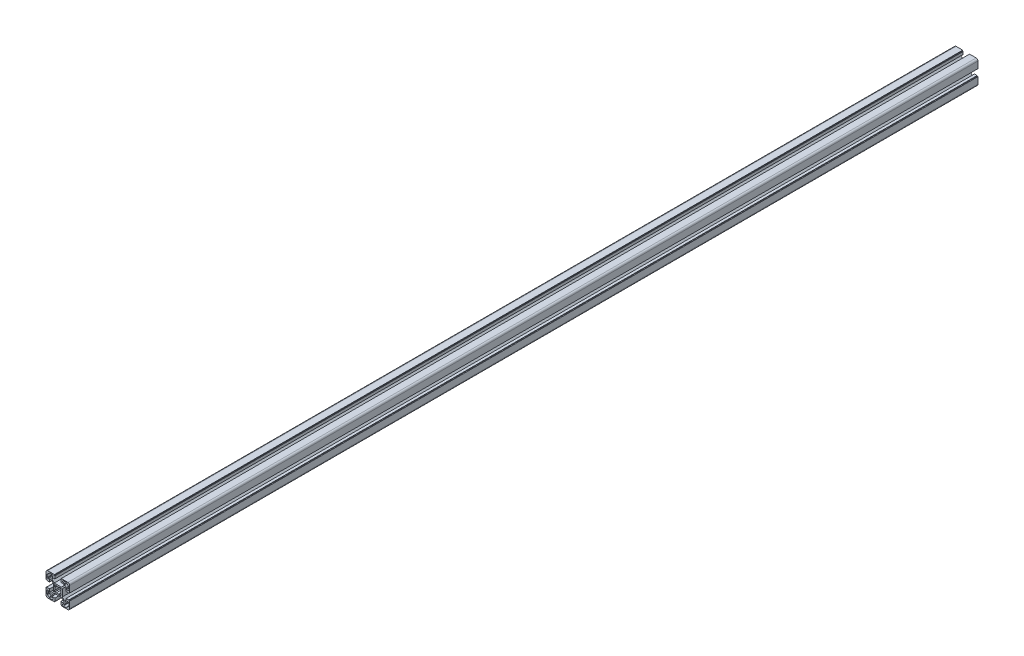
ISO-10303-21;
HEADER;
FILE_DESCRIPTION(('STEP AP214'),'2;1');
FILE_NAME('part.step','',(''),(''),'','','');
FILE_SCHEMA(('AUTOMOTIVE_DESIGN { 1 0 10303 214 1 1 1 1 }'));
ENDSEC;
DATA;
#1=APPLICATION_CONTEXT('core data for automotive mechanical design processes');
#2=APPLICATION_PROTOCOL_DEFINITION('international standard','automotive_design',2000,#1);
#3=PRODUCT_CONTEXT('',#1,'mechanical');
#4=PRODUCT('Part','Part','',(#3));
#5=PRODUCT_RELATED_PRODUCT_CATEGORY('part','',(#4));
#6=PRODUCT_DEFINITION_FORMATION('','',#4);
#7=PRODUCT_DEFINITION_CONTEXT('part definition',#1,'design');
#8=PRODUCT_DEFINITION('design','',#6,#7);
#9=PRODUCT_DEFINITION_SHAPE('','',#8);
#10=(LENGTH_UNIT() NAMED_UNIT(*) SI_UNIT(.MILLI.,.METRE.));
#11=(NAMED_UNIT(*) PLANE_ANGLE_UNIT() SI_UNIT($,.RADIAN.));
#12=(NAMED_UNIT(*) SI_UNIT($,.STERADIAN.) SOLID_ANGLE_UNIT());
#13=UNCERTAINTY_MEASURE_WITH_UNIT(LENGTH_MEASURE(1.E-05),#10,'distance_accuracy_value','');
#14=(GEOMETRIC_REPRESENTATION_CONTEXT(3) GLOBAL_UNCERTAINTY_ASSIGNED_CONTEXT((#13)) GLOBAL_UNIT_ASSIGNED_CONTEXT((#10,
#11,#12)) REPRESENTATION_CONTEXT('',''));
#15=CARTESIAN_POINT('',(0.,0.,0.));
#16=DIRECTION('',(0.,0.,1.));
#17=DIRECTION('',(1.,0.,0.));
#18=AXIS2_PLACEMENT_3D('',#15,#16,#17);
#19=CARTESIAN_POINT('',(-14.5000000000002,-11.75,1535.));
#20=DIRECTION('',(0.,-1.,0.));
#21=DIRECTION('',(1.,0.,0.));
#22=AXIS2_PLACEMENT_3D('',#19,#20,#21);
#23=PLANE('',#22);
#24=DIRECTION('',(1.,0.,0.));
#25=VECTOR('',#24,1.);
#26=CARTESIAN_POINT('',(-14.5000000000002,-11.75,1535.));
#27=LINE('',#26,#25);
#28=CARTESIAN_POINT('',(-14.5000000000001,-11.75,1535.));
#29=VERTEX_POINT('',#28);
#30=CARTESIAN_POINT('',(-15.5000000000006,-11.75,1535.));
#31=VERTEX_POINT('',#30);
#32=EDGE_CURVE('E806',#29,#31,#27,.F.);
#33=ORIENTED_EDGE('',*,*,#32,.T.);
#34=DIRECTION('',(0.,0.,1.));
#35=VECTOR('',#34,1.);
#36=CARTESIAN_POINT('',(-15.5000000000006,-11.75,1535.));
#37=LINE('',#36,#35);
#38=CARTESIAN_POINT('',(-15.5000000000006,-11.75,0.));
#39=VERTEX_POINT('',#38);
#40=EDGE_CURVE('E804',#39,#31,#37,.T.);
#41=ORIENTED_EDGE('',*,*,#40,.F.);
#42=DIRECTION('',(1.,0.,0.));
#43=VECTOR('',#42,1.);
#44=CARTESIAN_POINT('',(-14.5000000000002,-11.75,0.));
#45=LINE('',#44,#43);
#46=CARTESIAN_POINT('',(-14.5000000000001,-11.75,0.));
#47=VERTEX_POINT('',#46);
#48=EDGE_CURVE('E20',#39,#47,#45,.T.);
#49=ORIENTED_EDGE('',*,*,#48,.T.);
#50=DIRECTION('',(0.,0.,-1.));
#51=VECTOR('',#50,1.);
#52=CARTESIAN_POINT('',(-14.5000000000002,-11.75,1535.));
#53=LINE('',#52,#51);
#54=EDGE_CURVE('E801',#47,#29,#53,.F.);
#55=ORIENTED_EDGE('',*,*,#54,.T.);
#56=EDGE_LOOP('',(#33,#41,#49,#55));
#57=FACE_BOUND('',#56,.T.);
#58=ADVANCED_FACE('F17',(#57),#23,.T.);
#59=CARTESIAN_POINT('',(-11.7500000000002,-15.5,1535.));
#60=DIRECTION('',(-1.,0.,0.));
#61=DIRECTION('',(0.,-1.,0.));
#62=AXIS2_PLACEMENT_3D('',#59,#60,#61);
#63=PLANE('',#62);
#64=DIRECTION('',(0.,-1.,0.));
#65=VECTOR('',#64,1.);
#66=CARTESIAN_POINT('',(-11.7500000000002,-15.5,1535.));
#67=LINE('',#66,#65);
#68=CARTESIAN_POINT('',(-11.7500000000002,-15.5,1535.));
#69=VERTEX_POINT('',#68);
#70=CARTESIAN_POINT('',(-11.7500000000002,-14.5,1535.));
#71=VERTEX_POINT('',#70);
#72=EDGE_CURVE('E1218',#69,#71,#67,.F.);
#73=ORIENTED_EDGE('',*,*,#72,.T.);
#74=DIRECTION('',(0.,0.,-1.));
#75=VECTOR('',#74,1.);
#76=CARTESIAN_POINT('',(-11.7500000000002,-14.5,1535.));
#77=LINE('',#76,#75);
#78=CARTESIAN_POINT('',(-11.7500000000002,-14.5,0.));
#79=VERTEX_POINT('',#78);
#80=EDGE_CURVE('E814',#71,#79,#77,.T.);
#81=ORIENTED_EDGE('',*,*,#80,.T.);
#82=DIRECTION('',(0.,-1.,0.));
#83=VECTOR('',#82,1.);
#84=CARTESIAN_POINT('',(-11.7500000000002,-15.5,0.));
#85=LINE('',#84,#83);
#86=CARTESIAN_POINT('',(-11.7500000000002,-15.5,0.));
#87=VERTEX_POINT('',#86);
#88=EDGE_CURVE('E819',#79,#87,#85,.T.);
#89=ORIENTED_EDGE('',*,*,#88,.T.);
#90=DIRECTION('',(0.,0.,-1.));
#91=VECTOR('',#90,1.);
#92=CARTESIAN_POINT('',(-11.7500000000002,-15.5,1535.));
#93=LINE('',#92,#91);
#94=EDGE_CURVE('E1262',#69,#87,#93,.T.);
#95=ORIENTED_EDGE('',*,*,#94,.F.);
#96=EDGE_LOOP('',(#73,#81,#89,#95));
#97=FACE_BOUND('',#96,.T.);
#98=ADVANCED_FACE('F1555',(#97),#63,.T.);
#99=CARTESIAN_POINT('',(-14.5000000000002,-17.25,1535.));
#100=DIRECTION('',(1.,0.,0.));
#101=DIRECTION('',(0.,0.,-1.));
#102=AXIS2_PLACEMENT_3D('',#99,#100,#101);
#103=PLANE('',#102);
#104=DIRECTION('',(0.,1.,0.));
#105=VECTOR('',#104,1.);
#106=CARTESIAN_POINT('',(-14.5000000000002,-17.25,1535.));
#107=LINE('',#106,#105);
#108=CARTESIAN_POINT('',(-14.5000000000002,-17.25,1535.));
#109=VERTEX_POINT('',#108);
#110=CARTESIAN_POINT('',(-14.5000000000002,-18.5,1535.));
#111=VERTEX_POINT('',#110);
#112=EDGE_CURVE('E1214',#109,#111,#107,.F.);
#113=ORIENTED_EDGE('',*,*,#112,.T.);
#114=DIRECTION('',(0.,0.,1.));
#115=VECTOR('',#114,1.);
#116=CARTESIAN_POINT('',(-14.5000000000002,-18.5,1535.));
#117=LINE('',#116,#115);
#118=CARTESIAN_POINT('',(-14.5000000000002,-18.5,0.));
#119=VERTEX_POINT('',#118);
#120=EDGE_CURVE('E1256',#119,#111,#117,.T.);
#121=ORIENTED_EDGE('',*,*,#120,.F.);
#122=DIRECTION('',(0.,1.,0.));
#123=VECTOR('',#122,1.);
#124=CARTESIAN_POINT('',(-14.5000000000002,-17.25,0.));
#125=LINE('',#124,#123);
#126=CARTESIAN_POINT('',(-14.5000000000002,-17.25,0.));
#127=VERTEX_POINT('',#126);
#128=EDGE_CURVE('E1216',#119,#127,#125,.T.);
#129=ORIENTED_EDGE('',*,*,#128,.T.);
#130=DIRECTION('',(0.,0.,-1.));
#131=VECTOR('',#130,1.);
#132=CARTESIAN_POINT('',(-14.5000000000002,-17.25,1535.));
#133=LINE('',#132,#131);
#134=EDGE_CURVE('E1251',#127,#109,#133,.F.);
#135=ORIENTED_EDGE('',*,*,#134,.T.);
#136=EDGE_LOOP('',(#113,#121,#129,#135));
#137=FACE_BOUND('',#136,.T.);
#138=ADVANCED_FACE('F1560',(#137),#103,.T.);
#139=CARTESIAN_POINT('',(-18.5000000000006,-14.5000000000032,1535.));
#140=DIRECTION('',(0.,1.,0.));
#141=DIRECTION('',(0.,0.,1.));
#142=AXIS2_PLACEMENT_3D('',#139,#140,#141);
#143=PLANE('',#142);
#144=DIRECTION('',(1.,0.,0.));
#145=VECTOR('',#144,1.);
#146=CARTESIAN_POINT('',(-18.5000000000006,-14.5000000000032,1535.));
#147=LINE('',#146,#145);
#148=CARTESIAN_POINT('',(-18.5000000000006,-14.5000000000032,1535.));
#149=VERTEX_POINT('',#148);
#150=CARTESIAN_POINT('',(-17.2500000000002,-14.5000000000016,1535.));
#151=VERTEX_POINT('',#150);
#152=EDGE_CURVE('E1210',#149,#151,#147,.T.);
#153=ORIENTED_EDGE('',*,*,#152,.T.);
#154=DIRECTION('',(0.,0.,-1.));
#155=VECTOR('',#154,1.);
#156=CARTESIAN_POINT('',(-17.2500000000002,-14.5,1535.));
#157=LINE('',#156,#155);
#158=CARTESIAN_POINT('',(-17.2500000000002,-14.5000000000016,0.));
#159=VERTEX_POINT('',#158);
#160=EDGE_CURVE('E1248',#151,#159,#157,.T.);
#161=ORIENTED_EDGE('',*,*,#160,.T.);
#162=DIRECTION('',(1.,0.,0.));
#163=VECTOR('',#162,1.);
#164=CARTESIAN_POINT('',(-18.5000000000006,-14.5000000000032,0.));
#165=LINE('',#164,#163);
#166=CARTESIAN_POINT('',(-18.5000000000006,-14.5000000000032,0.));
#167=VERTEX_POINT('',#166);
#168=EDGE_CURVE('E1212',#159,#167,#165,.F.);
#169=ORIENTED_EDGE('',*,*,#168,.T.);
#170=DIRECTION('',(0.,0.,-1.));
#171=VECTOR('',#170,1.);
#172=CARTESIAN_POINT('',(-18.5000000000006,-14.5000000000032,1535.));
#173=LINE('',#172,#171);
#174=EDGE_CURVE('E1242',#149,#167,#173,.T.);
#175=ORIENTED_EDGE('',*,*,#174,.F.);
#176=EDGE_LOOP('',(#153,#161,#169,#175));
#177=FACE_BOUND('',#176,.T.);
#178=ADVANCED_FACE('F1569',(#177),#143,.T.);
#179=CARTESIAN_POINT('',(18.5000000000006,-14.5000000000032,1535.));
#180=DIRECTION('',(0.,1.,0.));
#181=DIRECTION('',(0.,0.,1.));
#182=AXIS2_PLACEMENT_3D('',#179,#180,#181);
#183=PLANE('',#182);
#184=DIRECTION('',(1.,0.,0.));
#185=VECTOR('',#184,1.);
#186=CARTESIAN_POINT('',(18.5000000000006,-14.5000000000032,1535.));
#187=LINE('',#186,#185);
#188=CARTESIAN_POINT('',(17.2500000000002,-14.5000000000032,1535.));
#189=VERTEX_POINT('',#188);
#190=CARTESIAN_POINT('',(18.5000000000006,-14.5000000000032,1535.));
#191=VERTEX_POINT('',#190);
#192=EDGE_CURVE('E1206',#189,#191,#187,.T.);
#193=ORIENTED_EDGE('',*,*,#192,.T.);
#194=DIRECTION('',(0.,0.,1.));
#195=VECTOR('',#194,1.);
#196=CARTESIAN_POINT('',(18.5000000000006,-14.5000000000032,1535.));
#197=LINE('',#196,#195);
#198=CARTESIAN_POINT('',(18.5000000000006,-14.5000000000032,0.));
#199=VERTEX_POINT('',#198);
#200=EDGE_CURVE('E1947',#199,#191,#197,.T.);
#201=ORIENTED_EDGE('',*,*,#200,.F.);
#202=DIRECTION('',(1.,0.,0.));
#203=VECTOR('',#202,1.);
#204=CARTESIAN_POINT('',(18.5000000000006,-14.5000000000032,0.));
#205=LINE('',#204,#203);
#206=CARTESIAN_POINT('',(17.2500000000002,-14.5000000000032,0.));
#207=VERTEX_POINT('',#206);
#208=EDGE_CURVE('E1208',#199,#207,#205,.F.);
#209=ORIENTED_EDGE('',*,*,#208,.T.);
#210=DIRECTION('',(0.,0.,-1.));
#211=VECTOR('',#210,1.);
#212=CARTESIAN_POINT('',(17.2500000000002,-14.5000000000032,1535.));
#213=LINE('',#212,#211);
#214=EDGE_CURVE('E1952',#207,#189,#213,.F.);
#215=ORIENTED_EDGE('',*,*,#214,.T.);
#216=EDGE_LOOP('',(#193,#201,#209,#215));
#217=FACE_BOUND('',#216,.T.);
#218=ADVANCED_FACE('F2472',(#217),#183,.T.);
#219=CARTESIAN_POINT('',(14.5000000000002,-17.25,1535.));
#220=DIRECTION('',(-1.,0.,0.));
#221=DIRECTION('',(0.,0.,1.));
#222=AXIS2_PLACEMENT_3D('',#219,#220,#221);
#223=PLANE('',#222);
#224=DIRECTION('',(0.,1.,0.));
#225=VECTOR('',#224,1.);
#226=CARTESIAN_POINT('',(14.5000000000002,-17.25,1535.));
#227=LINE('',#226,#225);
#228=CARTESIAN_POINT('',(14.5000000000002,-18.5,1535.));
#229=VERTEX_POINT('',#228);
#230=CARTESIAN_POINT('',(14.5000000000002,-17.25,1535.));
#231=VERTEX_POINT('',#230);
#232=EDGE_CURVE('E1202',#229,#231,#227,.T.);
#233=ORIENTED_EDGE('',*,*,#232,.T.);
#234=DIRECTION('',(0.,0.,-1.));
#235=VECTOR('',#234,1.);
#236=CARTESIAN_POINT('',(14.5000000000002,-17.25,1535.));
#237=LINE('',#236,#235);
#238=CARTESIAN_POINT('',(14.5000000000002,-17.25,0.));
#239=VERTEX_POINT('',#238);
#240=EDGE_CURVE('E1955',#231,#239,#237,.T.);
#241=ORIENTED_EDGE('',*,*,#240,.T.);
#242=DIRECTION('',(0.,1.,0.));
#243=VECTOR('',#242,1.);
#244=CARTESIAN_POINT('',(14.5000000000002,-17.25,0.));
#245=LINE('',#244,#243);
#246=CARTESIAN_POINT('',(14.5000000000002,-18.5,0.));
#247=VERTEX_POINT('',#246);
#248=EDGE_CURVE('E1204',#239,#247,#245,.F.);
#249=ORIENTED_EDGE('',*,*,#248,.T.);
#250=DIRECTION('',(0.,0.,1.));
#251=VECTOR('',#250,1.);
#252=CARTESIAN_POINT('',(14.5000000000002,-18.5,1535.));
#253=LINE('',#252,#251);
#254=EDGE_CURVE('E1958',#229,#247,#253,.F.);
#255=ORIENTED_EDGE('',*,*,#254,.F.);
#256=EDGE_LOOP('',(#233,#241,#249,#255));
#257=FACE_BOUND('',#256,.T.);
#258=ADVANCED_FACE('F2468',(#257),#223,.T.);
#259=CARTESIAN_POINT('',(11.7500000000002,-15.5,1535.));
#260=DIRECTION('',(1.,0.,0.));
#261=DIRECTION('',(0.,1.,0.));
#262=AXIS2_PLACEMENT_3D('',#259,#260,#261);
#263=PLANE('',#262);
#264=DIRECTION('',(0.,1.,0.));
#265=VECTOR('',#264,1.);
#266=CARTESIAN_POINT('',(11.7500000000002,-15.5,1535.));
#267=LINE('',#266,#265);
#268=CARTESIAN_POINT('',(11.7500000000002,-14.5,1535.));
#269=VERTEX_POINT('',#268);
#270=CARTESIAN_POINT('',(11.7500000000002,-15.5,1535.));
#271=VERTEX_POINT('',#270);
#272=EDGE_CURVE('E1198',#269,#271,#267,.F.);
#273=ORIENTED_EDGE('',*,*,#272,.T.);
#274=DIRECTION('',(0.,0.,-1.));
#275=VECTOR('',#274,1.);
#276=CARTESIAN_POINT('',(11.7500000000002,-15.5,1535.));
#277=LINE('',#276,#275);
#278=CARTESIAN_POINT('',(11.7500000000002,-15.5,0.));
#279=VERTEX_POINT('',#278);
#280=EDGE_CURVE('E1964',#279,#271,#277,.F.);
#281=ORIENTED_EDGE('',*,*,#280,.F.);
#282=DIRECTION('',(0.,1.,0.));
#283=VECTOR('',#282,1.);
#284=CARTESIAN_POINT('',(11.7500000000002,-15.5,0.));
#285=LINE('',#284,#283);
#286=CARTESIAN_POINT('',(11.7500000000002,-14.5,0.));
#287=VERTEX_POINT('',#286);
#288=EDGE_CURVE('E1200',#279,#287,#285,.T.);
#289=ORIENTED_EDGE('',*,*,#288,.T.);
#290=DIRECTION('',(0.,0.,-1.));
#291=VECTOR('',#290,1.);
#292=CARTESIAN_POINT('',(11.7500000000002,-14.5,1535.));
#293=LINE('',#292,#291);
#294=EDGE_CURVE('E1969',#287,#269,#293,.F.);
#295=ORIENTED_EDGE('',*,*,#294,.T.);
#296=EDGE_LOOP('',(#273,#281,#289,#295));
#297=FACE_BOUND('',#296,.T.);
#298=ADVANCED_FACE('F2465',(#297),#263,.T.);
#299=CARTESIAN_POINT('',(14.5000000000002,-11.75,1535.));
#300=DIRECTION('',(0.,-1.,0.));
#301=DIRECTION('',(1.,0.,0.));
#302=AXIS2_PLACEMENT_3D('',#299,#300,#301);
#303=PLANE('',#302);
#304=DIRECTION('',(1.,0.,0.));
#305=VECTOR('',#304,1.);
#306=CARTESIAN_POINT('',(14.5000000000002,-11.75,1535.));
#307=LINE('',#306,#305);
#308=CARTESIAN_POINT('',(15.5000000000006,-11.75,1535.));
#309=VERTEX_POINT('',#308);
#310=CARTESIAN_POINT('',(14.5000000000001,-11.75,1535.));
#311=VERTEX_POINT('',#310);
#312=EDGE_CURVE('E1194',#309,#311,#307,.F.);
#313=ORIENTED_EDGE('',*,*,#312,.T.);
#314=DIRECTION('',(0.,0.,-1.));
#315=VECTOR('',#314,1.);
#316=CARTESIAN_POINT('',(14.5000000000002,-11.75,1535.));
#317=LINE('',#316,#315);
#318=CARTESIAN_POINT('',(14.5000000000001,-11.75,0.));
#319=VERTEX_POINT('',#318);
#320=EDGE_CURVE('E1940',#311,#319,#317,.T.);
#321=ORIENTED_EDGE('',*,*,#320,.T.);
#322=DIRECTION('',(1.,0.,0.));
#323=VECTOR('',#322,1.);
#324=CARTESIAN_POINT('',(14.5000000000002,-11.75,0.));
#325=LINE('',#324,#323);
#326=CARTESIAN_POINT('',(15.5000000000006,-11.75,0.));
#327=VERTEX_POINT('',#326);
#328=EDGE_CURVE('E1196',#319,#327,#325,.T.);
#329=ORIENTED_EDGE('',*,*,#328,.T.);
#330=DIRECTION('',(0.,0.,-1.));
#331=VECTOR('',#330,1.);
#332=CARTESIAN_POINT('',(15.5000000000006,-11.75,1535.));
#333=LINE('',#332,#331);
#334=EDGE_CURVE('E1237',#309,#327,#333,.T.);
#335=ORIENTED_EDGE('',*,*,#334,.F.);
#336=EDGE_LOOP('',(#313,#321,#329,#335));
#337=FACE_BOUND('',#336,.T.);
#338=ADVANCED_FACE('F1939',(#337),#303,.T.);
#339=CARTESIAN_POINT('',(5.80000000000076,-18.5000000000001,1535.));
#340=DIRECTION('',(1.,0.,0.));
#341=DIRECTION('',(0.,0.,-1.));
#342=AXIS2_PLACEMENT_3D('',#339,#340,#341);
#343=PLANE('',#342);
#344=DIRECTION('',(0.,0.,1.));
#345=VECTOR('',#344,1.);
#346=CARTESIAN_POINT('',(5.80000000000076,-20.,1535.));
#347=LINE('',#346,#345);
#348=CARTESIAN_POINT('',(5.80000000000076,-20.,0.));
#349=VERTEX_POINT('',#348);
#350=CARTESIAN_POINT('',(5.80000000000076,-20.,1535.));
#351=VERTEX_POINT('',#350);
#352=EDGE_CURVE('E1973',#349,#351,#347,.T.);
#353=ORIENTED_EDGE('',*,*,#352,.T.);
#354=DIRECTION('',(0.,1.,0.));
#355=VECTOR('',#354,1.);
#356=CARTESIAN_POINT('',(5.80000000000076,-17.,1535.));
#357=LINE('',#356,#355);
#358=CARTESIAN_POINT('',(5.80000000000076,-18.5000000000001,1535.));
#359=VERTEX_POINT('',#358);
#360=EDGE_CURVE('E1192',#359,#351,#357,.F.);
#361=ORIENTED_EDGE('',*,*,#360,.F.);
#362=DIRECTION('',(0.,0.,1.));
#363=VECTOR('',#362,1.);
#364=CARTESIAN_POINT('',(5.80000000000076,-18.5000000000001,1535.));
#365=LINE('',#364,#363);
#366=CARTESIAN_POINT('',(5.80000000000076,-18.5000000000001,0.));
#367=VERTEX_POINT('',#366);
#368=EDGE_CURVE('E1116',#359,#367,#365,.F.);
#369=ORIENTED_EDGE('',*,*,#368,.T.);
#370=DIRECTION('',(0.,1.,0.));
#371=VECTOR('',#370,1.);
#372=CARTESIAN_POINT('',(5.80000000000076,-17.,0.));
#373=LINE('',#372,#371);
#374=EDGE_CURVE('E1190',#349,#367,#373,.T.);
#375=ORIENTED_EDGE('',*,*,#374,.F.);
#376=EDGE_LOOP('',(#353,#361,#369,#375));
#377=FACE_BOUND('',#376,.T.);
#378=ADVANCED_FACE('F2286',(#377),#343,.F.);
#379=CARTESIAN_POINT('',(20.,-5.79999999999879,1535.));
#380=DIRECTION('',(0.,-1.,0.));
#381=DIRECTION('',(0.,0.,-1.));
#382=AXIS2_PLACEMENT_3D('',#379,#380,#381);
#383=PLANE('',#382);
#384=DIRECTION('',(0.,0.,1.));
#385=VECTOR('',#384,1.);
#386=CARTESIAN_POINT('',(18.5,-5.79999999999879,1535.));
#387=LINE('',#386,#385);
#388=CARTESIAN_POINT('',(18.5,-5.79999999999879,0.));
#389=VERTEX_POINT('',#388);
#390=CARTESIAN_POINT('',(18.5,-5.79999999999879,1535.));
#391=VERTEX_POINT('',#390);
#392=EDGE_CURVE('E1185',#389,#391,#387,.T.);
#393=ORIENTED_EDGE('',*,*,#392,.T.);
#394=DIRECTION('',(1.,0.,0.));
#395=VECTOR('',#394,1.);
#396=CARTESIAN_POINT('',(17.,-5.79999999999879,1535.));
#397=LINE('',#396,#395);
#398=CARTESIAN_POINT('',(20.,-5.79999999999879,1535.));
#399=VERTEX_POINT('',#398);
#400=EDGE_CURVE('E1188',#399,#391,#397,.F.);
#401=ORIENTED_EDGE('',*,*,#400,.F.);
#402=DIRECTION('',(0.,0.,1.));
#403=VECTOR('',#402,1.);
#404=CARTESIAN_POINT('',(20.,-5.79999999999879,1535.));
#405=LINE('',#404,#403);
#406=CARTESIAN_POINT('',(20.,-5.79999999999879,0.));
#407=VERTEX_POINT('',#406);
#408=EDGE_CURVE('E1981',#399,#407,#405,.F.);
#409=ORIENTED_EDGE('',*,*,#408,.T.);
#410=DIRECTION('',(1.,0.,0.));
#411=VECTOR('',#410,1.);
#412=CARTESIAN_POINT('',(17.,-5.79999999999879,0.));
#413=LINE('',#412,#411);
#414=EDGE_CURVE('E1186',#389,#407,#413,.T.);
#415=ORIENTED_EDGE('',*,*,#414,.F.);
#416=EDGE_LOOP('',(#393,#401,#409,#415));
#417=FACE_BOUND('',#416,.T.);
#418=ADVANCED_FACE('F2294',(#417),#383,.F.);
#419=CARTESIAN_POINT('',(18.5,-5.79999999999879,1535.));
#420=DIRECTION('',(-1.,0.,0.));
#421=DIRECTION('',(0.,0.,1.));
#422=AXIS2_PLACEMENT_3D('',#419,#420,#421);
#423=PLANE('',#422);
#424=DIRECTION('',(0.,0.,-1.));
#425=VECTOR('',#424,1.);
#426=CARTESIAN_POINT('',(18.5,-4.99999999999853,1535.));
#427=LINE('',#426,#425);
#428=CARTESIAN_POINT('',(18.5,-4.99999999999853,0.));
#429=VERTEX_POINT('',#428);
#430=CARTESIAN_POINT('',(18.5,-4.99999999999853,1535.));
#431=VERTEX_POINT('',#430);
#432=EDGE_CURVE('E1984',#429,#431,#427,.F.);
#433=ORIENTED_EDGE('',*,*,#432,.T.);
#434=DIRECTION('',(0.,1.,0.));
#435=VECTOR('',#434,1.);
#436=CARTESIAN_POINT('',(18.5,-17.,1535.));
#437=LINE('',#436,#435);
#438=EDGE_CURVE('E1183',#391,#431,#437,.T.);
#439=ORIENTED_EDGE('',*,*,#438,.F.);
#440=ORIENTED_EDGE('',*,*,#392,.F.);
#441=DIRECTION('',(0.,1.,0.));
#442=VECTOR('',#441,1.);
#443=CARTESIAN_POINT('',(18.5,-17.,0.));
#444=LINE('',#443,#442);
#445=EDGE_CURVE('E1180',#429,#389,#444,.F.);
#446=ORIENTED_EDGE('',*,*,#445,.F.);
#447=EDGE_LOOP('',(#433,#439,#440,#446));
#448=FACE_BOUND('',#447,.T.);
#449=ADVANCED_FACE('F2297',(#448),#423,.F.);
#450=CARTESIAN_POINT('',(18.5,5.79999999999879,1535.));
#451=DIRECTION('',(-1.,0.,0.));
#452=DIRECTION('',(0.,0.,1.));
#453=AXIS2_PLACEMENT_3D('',#450,#451,#452);
#454=PLANE('',#453);
#455=DIRECTION('',(0.,0.,1.));
#456=VECTOR('',#455,1.);
#457=CARTESIAN_POINT('',(18.5,5.79999999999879,1535.));
#458=LINE('',#457,#456);
#459=CARTESIAN_POINT('',(18.5,5.79999999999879,0.));
#460=VERTEX_POINT('',#459);
#461=CARTESIAN_POINT('',(18.5,5.79999999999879,1535.));
#462=VERTEX_POINT('',#461);
#463=EDGE_CURVE('E1175',#460,#462,#458,.T.);
#464=ORIENTED_EDGE('',*,*,#463,.T.);
#465=DIRECTION('',(0.,1.,0.));
#466=VECTOR('',#465,1.);
#467=CARTESIAN_POINT('',(18.5,-17.,1535.));
#468=LINE('',#467,#466);
#469=CARTESIAN_POINT('',(18.5,4.99999999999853,1535.));
#470=VERTEX_POINT('',#469);
#471=EDGE_CURVE('E1178',#470,#462,#468,.T.);
#472=ORIENTED_EDGE('',*,*,#471,.F.);
#473=DIRECTION('',(0.,0.,1.));
#474=VECTOR('',#473,1.);
#475=CARTESIAN_POINT('',(18.5,4.99999999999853,1535.));
#476=LINE('',#475,#474);
#477=CARTESIAN_POINT('',(18.5,4.99999999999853,0.));
#478=VERTEX_POINT('',#477);
#479=EDGE_CURVE('E2011',#470,#478,#476,.F.);
#480=ORIENTED_EDGE('',*,*,#479,.T.);
#481=DIRECTION('',(0.,1.,0.));
#482=VECTOR('',#481,1.);
#483=CARTESIAN_POINT('',(18.5,-17.,0.));
#484=LINE('',#483,#482);
#485=EDGE_CURVE('E1176',#460,#478,#484,.F.);
#486=ORIENTED_EDGE('',*,*,#485,.F.);
#487=EDGE_LOOP('',(#464,#472,#480,#486));
#488=FACE_BOUND('',#487,.T.);
#489=ADVANCED_FACE('F2319',(#488),#454,.F.);
#490=CARTESIAN_POINT('',(20.,5.79999999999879,1535.));
#491=DIRECTION('',(0.,1.,0.));
#492=DIRECTION('',(0.,0.,1.));
#493=AXIS2_PLACEMENT_3D('',#490,#491,#492);
#494=PLANE('',#493);
#495=DIRECTION('',(0.,0.,1.));
#496=VECTOR('',#495,1.);
#497=CARTESIAN_POINT('',(20.,5.79999999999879,1535.));
#498=LINE('',#497,#496);
#499=CARTESIAN_POINT('',(20.,5.79999999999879,0.));
#500=VERTEX_POINT('',#499);
#501=CARTESIAN_POINT('',(20.,5.79999999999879,1535.));
#502=VERTEX_POINT('',#501);
#503=EDGE_CURVE('E2014',#500,#502,#498,.T.);
#504=ORIENTED_EDGE('',*,*,#503,.T.);
#505=DIRECTION('',(1.,0.,0.));
#506=VECTOR('',#505,1.);
#507=CARTESIAN_POINT('',(17.,5.79999999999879,1535.));
#508=LINE('',#507,#506);
#509=EDGE_CURVE('E1173',#462,#502,#508,.T.);
#510=ORIENTED_EDGE('',*,*,#509,.F.);
#511=ORIENTED_EDGE('',*,*,#463,.F.);
#512=DIRECTION('',(1.,0.,0.));
#513=VECTOR('',#512,1.);
#514=CARTESIAN_POINT('',(17.,5.79999999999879,0.));
#515=LINE('',#514,#513);
#516=EDGE_CURVE('E1170',#500,#460,#515,.F.);
#517=ORIENTED_EDGE('',*,*,#516,.F.);
#518=EDGE_LOOP('',(#504,#510,#511,#517));
#519=FACE_BOUND('',#518,.T.);
#520=ADVANCED_FACE('F2323',(#519),#494,.F.);
#521=CARTESIAN_POINT('',(5.80000000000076,18.5000000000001,1535.));
#522=DIRECTION('',(1.,0.,0.));
#523=DIRECTION('',(0.,0.,-1.));
#524=AXIS2_PLACEMENT_3D('',#521,#522,#523);
#525=PLANE('',#524);
#526=DIRECTION('',(0.,0.,-1.));
#527=VECTOR('',#526,1.);
#528=CARTESIAN_POINT('',(5.80000000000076,18.5000000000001,1535.));
#529=LINE('',#528,#527);
#530=CARTESIAN_POINT('',(5.80000000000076,18.5000000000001,0.));
#531=VERTEX_POINT('',#530);
#532=CARTESIAN_POINT('',(5.80000000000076,18.5000000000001,1535.));
#533=VERTEX_POINT('',#532);
#534=EDGE_CURVE('E1165',#531,#533,#529,.F.);
#535=ORIENTED_EDGE('',*,*,#534,.T.);
#536=DIRECTION('',(0.,1.,0.));
#537=VECTOR('',#536,1.);
#538=CARTESIAN_POINT('',(5.80000000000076,-17.,1535.));
#539=LINE('',#538,#537);
#540=CARTESIAN_POINT('',(5.80000000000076,20.,1535.));
#541=VERTEX_POINT('',#540);
#542=EDGE_CURVE('E1168',#541,#533,#539,.F.);
#543=ORIENTED_EDGE('',*,*,#542,.F.);
#544=DIRECTION('',(0.,0.,-1.));
#545=VECTOR('',#544,1.);
#546=CARTESIAN_POINT('',(5.80000000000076,20.,1535.));
#547=LINE('',#546,#545);
#548=CARTESIAN_POINT('',(5.80000000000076,20.,0.));
#549=VERTEX_POINT('',#548);
#550=EDGE_CURVE('E2022',#541,#549,#547,.T.);
#551=ORIENTED_EDGE('',*,*,#550,.T.);
#552=DIRECTION('',(0.,1.,0.));
#553=VECTOR('',#552,1.);
#554=CARTESIAN_POINT('',(5.80000000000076,-17.,0.));
#555=LINE('',#554,#553);
#556=EDGE_CURVE('E1166',#531,#549,#555,.T.);
#557=ORIENTED_EDGE('',*,*,#556,.F.);
#558=EDGE_LOOP('',(#535,#543,#551,#557));
#559=FACE_BOUND('',#558,.T.);
#560=ADVANCED_FACE('F2334',(#559),#525,.F.);
#561=CARTESIAN_POINT('',(5.00000000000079,18.5000000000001,1535.));
#562=DIRECTION('',(0.,-1.,0.));
#563=DIRECTION('',(0.,0.,-1.));
#564=AXIS2_PLACEMENT_3D('',#561,#562,#563);
#565=PLANE('',#564);
#566=DIRECTION('',(0.,0.,1.));
#567=VECTOR('',#566,1.);
#568=CARTESIAN_POINT('',(5.00000000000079,18.5000000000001,1535.));
#569=LINE('',#568,#567);
#570=CARTESIAN_POINT('',(5.00000000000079,18.5000000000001,0.));
#571=VERTEX_POINT('',#570);
#572=CARTESIAN_POINT('',(5.00000000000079,18.5000000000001,1535.));
#573=VERTEX_POINT('',#572);
#574=EDGE_CURVE('E2025',#571,#573,#569,.T.);
#575=ORIENTED_EDGE('',*,*,#574,.T.);
#576=DIRECTION('',(1.,0.,0.));
#577=VECTOR('',#576,1.);
#578=CARTESIAN_POINT('',(17.,18.5000000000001,1535.));
#579=LINE('',#578,#577);
#580=EDGE_CURVE('E1163',#533,#573,#579,.F.);
#581=ORIENTED_EDGE('',*,*,#580,.F.);
#582=ORIENTED_EDGE('',*,*,#534,.F.);
#583=DIRECTION('',(1.,0.,0.));
#584=VECTOR('',#583,1.);
#585=CARTESIAN_POINT('',(17.,18.5000000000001,0.));
#586=LINE('',#585,#584);
#587=EDGE_CURVE('E1160',#571,#531,#586,.T.);
#588=ORIENTED_EDGE('',*,*,#587,.F.);
#589=EDGE_LOOP('',(#575,#581,#582,#588));
#590=FACE_BOUND('',#589,.T.);
#591=ADVANCED_FACE('F2338',(#590),#565,.F.);
#592=CARTESIAN_POINT('',(-5.00000000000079,18.5000000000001,1535.));
#593=DIRECTION('',(0.,-1.,0.));
#594=DIRECTION('',(0.,0.,-1.));
#595=AXIS2_PLACEMENT_3D('',#592,#593,#594);
#596=PLANE('',#595);
#597=DIRECTION('',(0.,0.,1.));
#598=VECTOR('',#597,1.);
#599=CARTESIAN_POINT('',(-5.80000000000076,18.5000000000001,1535.));
#600=LINE('',#599,#598);
#601=CARTESIAN_POINT('',(-5.80000000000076,18.5000000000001,0.));
#602=VERTEX_POINT('',#601);
#603=CARTESIAN_POINT('',(-5.80000000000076,18.5000000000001,1535.));
#604=VERTEX_POINT('',#603);
#605=EDGE_CURVE('E1155',#602,#604,#600,.T.);
#606=ORIENTED_EDGE('',*,*,#605,.T.);
#607=DIRECTION('',(1.,0.,0.));
#608=VECTOR('',#607,1.);
#609=CARTESIAN_POINT('',(17.,18.5000000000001,1535.));
#610=LINE('',#609,#608);
#611=CARTESIAN_POINT('',(-5.00000000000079,18.5000000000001,1535.));
#612=VERTEX_POINT('',#611);
#613=EDGE_CURVE('E1158',#612,#604,#610,.F.);
#614=ORIENTED_EDGE('',*,*,#613,.F.);
#615=DIRECTION('',(0.,0.,1.));
#616=VECTOR('',#615,1.);
#617=CARTESIAN_POINT('',(-5.00000000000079,18.5000000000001,1535.));
#618=LINE('',#617,#616);
#619=CARTESIAN_POINT('',(-5.00000000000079,18.5000000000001,0.));
#620=VERTEX_POINT('',#619);
#621=EDGE_CURVE('E2052',#612,#620,#618,.F.);
#622=ORIENTED_EDGE('',*,*,#621,.T.);
#623=DIRECTION('',(1.,0.,0.));
#624=VECTOR('',#623,1.);
#625=CARTESIAN_POINT('',(17.,18.5000000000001,0.));
#626=LINE('',#625,#624);
#627=EDGE_CURVE('E1156',#602,#620,#626,.T.);
#628=ORIENTED_EDGE('',*,*,#627,.F.);
#629=EDGE_LOOP('',(#606,#614,#622,#628));
#630=FACE_BOUND('',#629,.T.);
#631=ADVANCED_FACE('F2360',(#630),#596,.F.);
#632=CARTESIAN_POINT('',(-5.80000000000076,18.5000000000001,1535.));
#633=DIRECTION('',(-1.,0.,0.));
#634=DIRECTION('',(0.,0.,1.));
#635=AXIS2_PLACEMENT_3D('',#632,#633,#634);
#636=PLANE('',#635);
#637=DIRECTION('',(0.,0.,1.));
#638=VECTOR('',#637,1.);
#639=CARTESIAN_POINT('',(-5.80000000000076,20.,1535.));
#640=LINE('',#639,#638);
#641=CARTESIAN_POINT('',(-5.80000000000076,20.,0.));
#642=VERTEX_POINT('',#641);
#643=CARTESIAN_POINT('',(-5.80000000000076,20.,1535.));
#644=VERTEX_POINT('',#643);
#645=EDGE_CURVE('E2055',#642,#644,#640,.T.);
#646=ORIENTED_EDGE('',*,*,#645,.T.);
#647=DIRECTION('',(0.,1.,0.));
#648=VECTOR('',#647,1.);
#649=CARTESIAN_POINT('',(-5.80000000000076,-17.,1535.));
#650=LINE('',#649,#648);
#651=EDGE_CURVE('E1153',#604,#644,#650,.T.);
#652=ORIENTED_EDGE('',*,*,#651,.F.);
#653=ORIENTED_EDGE('',*,*,#605,.F.);
#654=DIRECTION('',(0.,1.,0.));
#655=VECTOR('',#654,1.);
#656=CARTESIAN_POINT('',(-5.80000000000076,-17.,0.));
#657=LINE('',#656,#655);
#658=EDGE_CURVE('E1150',#642,#602,#657,.F.);
#659=ORIENTED_EDGE('',*,*,#658,.F.);
#660=EDGE_LOOP('',(#646,#652,#653,#659));
#661=FACE_BOUND('',#660,.T.);
#662=ADVANCED_FACE('F2364',(#661),#636,.F.);
#663=CARTESIAN_POINT('',(-20.,5.79999999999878,1535.));
#664=DIRECTION('',(0.,1.,0.));
#665=DIRECTION('',(0.,0.,1.));
#666=AXIS2_PLACEMENT_3D('',#663,#664,#665);
#667=PLANE('',#666);
#668=DIRECTION('',(0.,0.,-1.));
#669=VECTOR('',#668,1.);
#670=CARTESIAN_POINT('',(-18.5,5.79999999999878,1535.));
#671=LINE('',#670,#669);
#672=CARTESIAN_POINT('',(-18.5,5.79999999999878,0.));
#673=VERTEX_POINT('',#672);
#674=CARTESIAN_POINT('',(-18.5,5.79999999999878,1535.));
#675=VERTEX_POINT('',#674);
#676=EDGE_CURVE('E1145',#673,#675,#671,.F.);
#677=ORIENTED_EDGE('',*,*,#676,.T.);
#678=DIRECTION('',(1.,0.,0.));
#679=VECTOR('',#678,1.);
#680=CARTESIAN_POINT('',(17.,5.79999999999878,1535.));
#681=LINE('',#680,#679);
#682=CARTESIAN_POINT('',(-20.,5.79999999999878,1535.));
#683=VERTEX_POINT('',#682);
#684=EDGE_CURVE('E1148',#683,#675,#681,.T.);
#685=ORIENTED_EDGE('',*,*,#684,.F.);
#686=DIRECTION('',(0.,0.,1.));
#687=VECTOR('',#686,1.);
#688=CARTESIAN_POINT('',(-20.,5.79999999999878,1535.));
#689=LINE('',#688,#687);
#690=CARTESIAN_POINT('',(-20.,5.79999999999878,0.));
#691=VERTEX_POINT('',#690);
#692=EDGE_CURVE('E2063',#683,#691,#689,.F.);
#693=ORIENTED_EDGE('',*,*,#692,.T.);
#694=DIRECTION('',(1.,0.,0.));
#695=VECTOR('',#694,1.);
#696=CARTESIAN_POINT('',(17.,5.79999999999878,0.));
#697=LINE('',#696,#695);
#698=EDGE_CURVE('E1146',#673,#691,#697,.F.);
#699=ORIENTED_EDGE('',*,*,#698,.F.);
#700=EDGE_LOOP('',(#677,#685,#693,#699));
#701=FACE_BOUND('',#700,.T.);
#702=ADVANCED_FACE('F2375',(#701),#667,.F.);
#703=CARTESIAN_POINT('',(-18.5,5.79999999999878,1535.));
#704=DIRECTION('',(1.,0.,0.));
#705=DIRECTION('',(0.,0.,-1.));
#706=AXIS2_PLACEMENT_3D('',#703,#704,#705);
#707=PLANE('',#706);
#708=DIRECTION('',(0.,0.,1.));
#709=VECTOR('',#708,1.);
#710=CARTESIAN_POINT('',(-18.5,4.99999999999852,1535.));
#711=LINE('',#710,#709);
#712=CARTESIAN_POINT('',(-18.5,4.99999999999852,0.));
#713=VERTEX_POINT('',#712);
#714=CARTESIAN_POINT('',(-18.5,4.99999999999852,1535.));
#715=VERTEX_POINT('',#714);
#716=EDGE_CURVE('E2066',#713,#715,#711,.T.);
#717=ORIENTED_EDGE('',*,*,#716,.T.);
#718=DIRECTION('',(0.,1.,0.));
#719=VECTOR('',#718,1.);
#720=CARTESIAN_POINT('',(-18.5,-17.,1535.));
#721=LINE('',#720,#719);
#722=EDGE_CURVE('E1143',#675,#715,#721,.F.);
#723=ORIENTED_EDGE('',*,*,#722,.F.);
#724=ORIENTED_EDGE('',*,*,#676,.F.);
#725=DIRECTION('',(0.,1.,0.));
#726=VECTOR('',#725,1.);
#727=CARTESIAN_POINT('',(-18.5,-17.,0.));
#728=LINE('',#727,#726);
#729=EDGE_CURVE('E1140',#713,#673,#728,.T.);
#730=ORIENTED_EDGE('',*,*,#729,.F.);
#731=EDGE_LOOP('',(#717,#723,#724,#730));
#732=FACE_BOUND('',#731,.T.);
#733=ADVANCED_FACE('F2379',(#732),#707,.F.);
#734=CARTESIAN_POINT('',(-18.5,-5.79999999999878,1535.));
#735=DIRECTION('',(1.,0.,0.));
#736=DIRECTION('',(0.,0.,-1.));
#737=AXIS2_PLACEMENT_3D('',#734,#735,#736);
#738=PLANE('',#737);
#739=DIRECTION('',(0.,0.,-1.));
#740=VECTOR('',#739,1.);
#741=CARTESIAN_POINT('',(-18.5,-5.79999999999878,1535.));
#742=LINE('',#741,#740);
#743=CARTESIAN_POINT('',(-18.5,-5.79999999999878,0.));
#744=VERTEX_POINT('',#743);
#745=CARTESIAN_POINT('',(-18.5,-5.79999999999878,1535.));
#746=VERTEX_POINT('',#745);
#747=EDGE_CURVE('E1135',#744,#746,#742,.F.);
#748=ORIENTED_EDGE('',*,*,#747,.T.);
#749=DIRECTION('',(0.,1.,0.));
#750=VECTOR('',#749,1.);
#751=CARTESIAN_POINT('',(-18.5,-17.,1535.));
#752=LINE('',#751,#750);
#753=CARTESIAN_POINT('',(-18.5,-4.99999999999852,1535.));
#754=VERTEX_POINT('',#753);
#755=EDGE_CURVE('E1138',#754,#746,#752,.F.);
#756=ORIENTED_EDGE('',*,*,#755,.F.);
#757=DIRECTION('',(0.,0.,1.));
#758=VECTOR('',#757,1.);
#759=CARTESIAN_POINT('',(-18.5,-4.99999999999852,1535.));
#760=LINE('',#759,#758);
#761=CARTESIAN_POINT('',(-18.5,-4.99999999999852,0.));
#762=VERTEX_POINT('',#761);
#763=EDGE_CURVE('E2093',#754,#762,#760,.F.);
#764=ORIENTED_EDGE('',*,*,#763,.T.);
#765=DIRECTION('',(0.,1.,0.));
#766=VECTOR('',#765,1.);
#767=CARTESIAN_POINT('',(-18.5,-17.,0.));
#768=LINE('',#767,#766);
#769=EDGE_CURVE('E1136',#744,#762,#768,.T.);
#770=ORIENTED_EDGE('',*,*,#769,.F.);
#771=EDGE_LOOP('',(#748,#756,#764,#770));
#772=FACE_BOUND('',#771,.T.);
#773=ADVANCED_FACE('F2401',(#772),#738,.F.);
#774=CARTESIAN_POINT('',(-20.,-5.79999999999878,1535.));
#775=DIRECTION('',(0.,-1.,0.));
#776=DIRECTION('',(0.,0.,-1.));
#777=AXIS2_PLACEMENT_3D('',#774,#775,#776);
#778=PLANE('',#777);
#779=DIRECTION('',(0.,0.,1.));
#780=VECTOR('',#779,1.);
#781=CARTESIAN_POINT('',(-20.,-5.79999999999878,1535.));
#782=LINE('',#781,#780);
#783=CARTESIAN_POINT('',(-20.,-5.79999999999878,0.));
#784=VERTEX_POINT('',#783);
#785=CARTESIAN_POINT('',(-20.,-5.79999999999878,1535.));
#786=VERTEX_POINT('',#785);
#787=EDGE_CURVE('E2096',#784,#786,#782,.T.);
#788=ORIENTED_EDGE('',*,*,#787,.T.);
#789=DIRECTION('',(1.,0.,0.));
#790=VECTOR('',#789,1.);
#791=CARTESIAN_POINT('',(17.,-5.79999999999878,1535.));
#792=LINE('',#791,#790);
#793=EDGE_CURVE('E1133',#746,#786,#792,.F.);
#794=ORIENTED_EDGE('',*,*,#793,.F.);
#795=ORIENTED_EDGE('',*,*,#747,.F.);
#796=DIRECTION('',(1.,0.,0.));
#797=VECTOR('',#796,1.);
#798=CARTESIAN_POINT('',(17.,-5.79999999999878,0.));
#799=LINE('',#798,#797);
#800=EDGE_CURVE('E1130',#784,#744,#799,.T.);
#801=ORIENTED_EDGE('',*,*,#800,.F.);
#802=EDGE_LOOP('',(#788,#794,#795,#801));
#803=FACE_BOUND('',#802,.T.);
#804=ADVANCED_FACE('F2405',(#803),#778,.F.);
#805=CARTESIAN_POINT('',(-5.80000000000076,-18.5000000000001,1535.));
#806=DIRECTION('',(-1.,0.,0.));
#807=DIRECTION('',(0.,0.,1.));
#808=AXIS2_PLACEMENT_3D('',#805,#806,#807);
#809=PLANE('',#808);
#810=DIRECTION('',(0.,0.,1.));
#811=VECTOR('',#810,1.);
#812=CARTESIAN_POINT('',(-5.80000000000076,-18.5000000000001,1535.));
#813=LINE('',#812,#811);
#814=CARTESIAN_POINT('',(-5.80000000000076,-18.5000000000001,0.));
#815=VERTEX_POINT('',#814);
#816=CARTESIAN_POINT('',(-5.80000000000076,-18.5000000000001,1535.));
#817=VERTEX_POINT('',#816);
#818=EDGE_CURVE('E1125',#815,#817,#813,.T.);
#819=ORIENTED_EDGE('',*,*,#818,.T.);
#820=DIRECTION('',(0.,1.,0.));
#821=VECTOR('',#820,1.);
#822=CARTESIAN_POINT('',(-5.80000000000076,-17.,1535.));
#823=LINE('',#822,#821);
#824=CARTESIAN_POINT('',(-5.80000000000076,-20.,1535.));
#825=VERTEX_POINT('',#824);
#826=EDGE_CURVE('E1128',#825,#817,#823,.T.);
#827=ORIENTED_EDGE('',*,*,#826,.F.);
#828=DIRECTION('',(0.,0.,1.));
#829=VECTOR('',#828,1.);
#830=CARTESIAN_POINT('',(-5.80000000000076,-20.,1535.));
#831=LINE('',#830,#829);
#832=CARTESIAN_POINT('',(-5.80000000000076,-20.,0.));
#833=VERTEX_POINT('',#832);
#834=EDGE_CURVE('E2104',#825,#833,#831,.F.);
#835=ORIENTED_EDGE('',*,*,#834,.T.);
#836=DIRECTION('',(0.,1.,0.));
#837=VECTOR('',#836,1.);
#838=CARTESIAN_POINT('',(-5.80000000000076,-17.,0.));
#839=LINE('',#838,#837);
#840=EDGE_CURVE('E1126',#815,#833,#839,.F.);
#841=ORIENTED_EDGE('',*,*,#840,.F.);
#842=EDGE_LOOP('',(#819,#827,#835,#841));
#843=FACE_BOUND('',#842,.T.);
#844=ADVANCED_FACE('F2416',(#843),#809,.F.);
#845=CARTESIAN_POINT('',(-5.00000000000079,-18.5000000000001,1535.));
#846=DIRECTION('',(0.,1.,0.));
#847=DIRECTION('',(0.,0.,1.));
#848=AXIS2_PLACEMENT_3D('',#845,#846,#847);
#849=PLANE('',#848);
#850=DIRECTION('',(0.,0.,1.));
#851=VECTOR('',#850,1.);
#852=CARTESIAN_POINT('',(-5.00000000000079,-18.5000000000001,1535.));
#853=LINE('',#852,#851);
#854=CARTESIAN_POINT('',(-5.00000000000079,-18.5000000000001,0.));
#855=VERTEX_POINT('',#854);
#856=CARTESIAN_POINT('',(-5.00000000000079,-18.5000000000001,1535.));
#857=VERTEX_POINT('',#856);
#858=EDGE_CURVE('E2107',#855,#857,#853,.T.);
#859=ORIENTED_EDGE('',*,*,#858,.T.);
#860=DIRECTION('',(1.,0.,0.));
#861=VECTOR('',#860,1.);
#862=CARTESIAN_POINT('',(17.,-18.5000000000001,1535.));
#863=LINE('',#862,#861);
#864=EDGE_CURVE('E1123',#817,#857,#863,.T.);
#865=ORIENTED_EDGE('',*,*,#864,.F.);
#866=ORIENTED_EDGE('',*,*,#818,.F.);
#867=DIRECTION('',(1.,0.,0.));
#868=VECTOR('',#867,1.);
#869=CARTESIAN_POINT('',(17.,-18.5000000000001,0.));
#870=LINE('',#869,#868);
#871=EDGE_CURVE('E1120',#855,#815,#870,.F.);
#872=ORIENTED_EDGE('',*,*,#871,.F.);
#873=EDGE_LOOP('',(#859,#865,#866,#872));
#874=FACE_BOUND('',#873,.T.);
#875=ADVANCED_FACE('F2420',(#874),#849,.F.);
#876=CARTESIAN_POINT('',(5.00000000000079,-18.5000000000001,1535.));
#877=DIRECTION('',(0.,1.,0.));
#878=DIRECTION('',(0.,0.,1.));
#879=AXIS2_PLACEMENT_3D('',#876,#877,#878);
#880=PLANE('',#879);
#881=ORIENTED_EDGE('',*,*,#368,.F.);
#882=DIRECTION('',(1.,0.,0.));
#883=VECTOR('',#882,1.);
#884=CARTESIAN_POINT('',(17.,-18.5000000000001,1535.));
#885=LINE('',#884,#883);
#886=CARTESIAN_POINT('',(5.00000000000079,-18.5000000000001,1535.));
#887=VERTEX_POINT('',#886);
#888=EDGE_CURVE('E1117',#887,#359,#885,.T.);
#889=ORIENTED_EDGE('',*,*,#888,.F.);
#890=DIRECTION('',(0.,0.,1.));
#891=VECTOR('',#890,1.);
#892=CARTESIAN_POINT('',(5.00000000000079,-18.5000000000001,1535.));
#893=LINE('',#892,#891);
#894=CARTESIAN_POINT('',(5.00000000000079,-18.5000000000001,0.));
#895=VERTEX_POINT('',#894);
#896=EDGE_CURVE('E2126',#887,#895,#893,.F.);
#897=ORIENTED_EDGE('',*,*,#896,.T.);
#898=DIRECTION('',(1.,0.,0.));
#899=VECTOR('',#898,1.);
#900=CARTESIAN_POINT('',(17.,-18.5000000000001,0.));
#901=LINE('',#900,#899);
#902=EDGE_CURVE('E1114',#367,#895,#901,.F.);
#903=ORIENTED_EDGE('',*,*,#902,.F.);
#904=EDGE_LOOP('',(#881,#889,#897,#903));
#905=FACE_BOUND('',#904,.T.);
#906=ADVANCED_FACE('F2277',(#905),#880,.F.);
#907=CARTESIAN_POINT('',(14.5000000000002,11.75,1535.));
#908=DIRECTION('',(0.,1.,0.));
#909=DIRECTION('',(-1.,0.,0.));
#910=AXIS2_PLACEMENT_3D('',#907,#908,#909);
#911=PLANE('',#910);
#912=DIRECTION('',(-1.,0.,0.));
#913=VECTOR('',#912,1.);
#914=CARTESIAN_POINT('',(14.5000000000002,11.75,1535.));
#915=LINE('',#914,#913);
#916=CARTESIAN_POINT('',(14.5000000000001,11.75,1535.));
#917=VERTEX_POINT('',#916);
#918=CARTESIAN_POINT('',(15.5000000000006,11.75,1535.));
#919=VERTEX_POINT('',#918);
#920=EDGE_CURVE('E1110',#917,#919,#915,.F.);
#921=ORIENTED_EDGE('',*,*,#920,.T.);
#922=DIRECTION('',(0.,0.,-1.));
#923=VECTOR('',#922,1.);
#924=CARTESIAN_POINT('',(15.5000000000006,11.75,1535.));
#925=LINE('',#924,#923);
#926=CARTESIAN_POINT('',(15.5000000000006,11.75,0.));
#927=VERTEX_POINT('',#926);
#928=EDGE_CURVE('E2129',#927,#919,#925,.F.);
#929=ORIENTED_EDGE('',*,*,#928,.F.);
#930=DIRECTION('',(-1.,0.,0.));
#931=VECTOR('',#930,1.);
#932=CARTESIAN_POINT('',(14.5000000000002,11.75,0.));
#933=LINE('',#932,#931);
#934=CARTESIAN_POINT('',(14.5000000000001,11.75,0.));
#935=VERTEX_POINT('',#934);
#936=EDGE_CURVE('E1112',#927,#935,#933,.T.);
#937=ORIENTED_EDGE('',*,*,#936,.T.);
#938=DIRECTION('',(0.,0.,-1.));
#939=VECTOR('',#938,1.);
#940=CARTESIAN_POINT('',(14.5000000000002,11.75,1535.));
#941=LINE('',#940,#939);
#942=EDGE_CURVE('E2132',#935,#917,#941,.F.);
#943=ORIENTED_EDGE('',*,*,#942,.T.);
#944=EDGE_LOOP('',(#921,#929,#937,#943));
#945=FACE_BOUND('',#944,.T.);
#946=ADVANCED_FACE('F2432',(#945),#911,.T.);
#947=CARTESIAN_POINT('',(11.7500000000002,15.5,1535.));
#948=DIRECTION('',(1.,0.,0.));
#949=DIRECTION('',(0.,1.,0.));
#950=AXIS2_PLACEMENT_3D('',#947,#948,#949);
#951=PLANE('',#950);
#952=DIRECTION('',(0.,1.,0.));
#953=VECTOR('',#952,1.);
#954=CARTESIAN_POINT('',(11.7500000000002,15.5,1535.));
#955=LINE('',#954,#953);
#956=CARTESIAN_POINT('',(11.7500000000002,15.5,1535.));
#957=VERTEX_POINT('',#956);
#958=CARTESIAN_POINT('',(11.7500000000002,14.5,1535.));
#959=VERTEX_POINT('',#958);
#960=EDGE_CURVE('E1106',#957,#959,#955,.F.);
#961=ORIENTED_EDGE('',*,*,#960,.T.);
#962=DIRECTION('',(0.,0.,-1.));
#963=VECTOR('',#962,1.);
#964=CARTESIAN_POINT('',(11.7500000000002,14.5,1535.));
#965=LINE('',#964,#963);
#966=CARTESIAN_POINT('',(11.7500000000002,14.5,0.));
#967=VERTEX_POINT('',#966);
#968=EDGE_CURVE('E2135',#959,#967,#965,.T.);
#969=ORIENTED_EDGE('',*,*,#968,.T.);
#970=DIRECTION('',(0.,1.,0.));
#971=VECTOR('',#970,1.);
#972=CARTESIAN_POINT('',(11.7500000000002,15.5,0.));
#973=LINE('',#972,#971);
#974=CARTESIAN_POINT('',(11.7500000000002,15.5,0.));
#975=VERTEX_POINT('',#974);
#976=EDGE_CURVE('E1108',#967,#975,#973,.T.);
#977=ORIENTED_EDGE('',*,*,#976,.T.);
#978=DIRECTION('',(0.,0.,1.));
#979=VECTOR('',#978,1.);
#980=CARTESIAN_POINT('',(11.7500000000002,15.5,1535.));
#981=LINE('',#980,#979);
#982=EDGE_CURVE('E2138',#957,#975,#981,.F.);
#983=ORIENTED_EDGE('',*,*,#982,.F.);
#984=EDGE_LOOP('',(#961,#969,#977,#983));
#985=FACE_BOUND('',#984,.T.);
#986=ADVANCED_FACE('F2634',(#985),#951,.T.);
#987=CARTESIAN_POINT('',(14.5000000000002,17.25,1535.));
#988=DIRECTION('',(-1.,0.,0.));
#989=DIRECTION('',(0.,0.,1.));
#990=AXIS2_PLACEMENT_3D('',#987,#988,#989);
#991=PLANE('',#990);
#992=DIRECTION('',(0.,1.,0.));
#993=VECTOR('',#992,1.);
#994=CARTESIAN_POINT('',(14.5000000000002,17.25,1535.));
#995=LINE('',#994,#993);
#996=CARTESIAN_POINT('',(14.5000000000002,17.25,1535.));
#997=VERTEX_POINT('',#996);
#998=CARTESIAN_POINT('',(14.5000000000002,18.5,1535.));
#999=VERTEX_POINT('',#998);
#1000=EDGE_CURVE('E1102',#997,#999,#995,.T.);
#1001=ORIENTED_EDGE('',*,*,#1000,.T.);
#1002=DIRECTION('',(0.,0.,-1.));
#1003=VECTOR('',#1002,1.);
#1004=CARTESIAN_POINT('',(14.5000000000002,18.5,1535.));
#1005=LINE('',#1004,#1003);
#1006=CARTESIAN_POINT('',(14.5000000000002,18.5,0.));
#1007=VERTEX_POINT('',#1006);
#1008=EDGE_CURVE('E2144',#1007,#999,#1005,.F.);
#1009=ORIENTED_EDGE('',*,*,#1008,.F.);
#1010=DIRECTION('',(0.,1.,0.));
#1011=VECTOR('',#1010,1.);
#1012=CARTESIAN_POINT('',(14.5000000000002,17.25,0.));
#1013=LINE('',#1012,#1011);
#1014=CARTESIAN_POINT('',(14.5000000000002,17.25,0.));
#1015=VERTEX_POINT('',#1014);
#1016=EDGE_CURVE('E1104',#1007,#1015,#1013,.F.);
#1017=ORIENTED_EDGE('',*,*,#1016,.T.);
#1018=DIRECTION('',(0.,0.,-1.));
#1019=VECTOR('',#1018,1.);
#1020=CARTESIAN_POINT('',(14.5000000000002,17.25,1535.));
#1021=LINE('',#1020,#1019);
#1022=EDGE_CURVE('E2150',#1015,#997,#1021,.F.);
#1023=ORIENTED_EDGE('',*,*,#1022,.T.);
#1024=EDGE_LOOP('',(#1001,#1009,#1017,#1023));
#1025=FACE_BOUND('',#1024,.T.);
#1026=ADVANCED_FACE('F2643',(#1025),#991,.T.);
#1027=CARTESIAN_POINT('',(18.5000000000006,14.5000000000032,1535.));
#1028=DIRECTION('',(0.,-1.,0.));
#1029=DIRECTION('',(0.,0.,-1.));
#1030=AXIS2_PLACEMENT_3D('',#1027,#1028,#1029);
#1031=PLANE('',#1030);
#1032=DIRECTION('',(1.,0.,0.));
#1033=VECTOR('',#1032,1.);
#1034=CARTESIAN_POINT('',(18.5000000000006,14.5000000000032,1535.));
#1035=LINE('',#1034,#1033);
#1036=CARTESIAN_POINT('',(18.5000000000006,14.5000000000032,1535.));
#1037=VERTEX_POINT('',#1036);
#1038=CARTESIAN_POINT('',(17.2500000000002,14.5000000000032,1535.));
#1039=VERTEX_POINT('',#1038);
#1040=EDGE_CURVE('E1098',#1037,#1039,#1035,.F.);
#1041=ORIENTED_EDGE('',*,*,#1040,.T.);
#1042=DIRECTION('',(0.,0.,-1.));
#1043=VECTOR('',#1042,1.);
#1044=CARTESIAN_POINT('',(17.2500000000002,14.5000000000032,1535.));
#1045=LINE('',#1044,#1043);
#1046=CARTESIAN_POINT('',(17.2500000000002,14.5000000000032,0.));
#1047=VERTEX_POINT('',#1046);
#1048=EDGE_CURVE('E2153',#1039,#1047,#1045,.T.);
#1049=ORIENTED_EDGE('',*,*,#1048,.T.);
#1050=DIRECTION('',(1.,0.,0.));
#1051=VECTOR('',#1050,1.);
#1052=CARTESIAN_POINT('',(18.5000000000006,14.5000000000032,0.));
#1053=LINE('',#1052,#1051);
#1054=CARTESIAN_POINT('',(18.5000000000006,14.5000000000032,0.));
#1055=VERTEX_POINT('',#1054);
#1056=EDGE_CURVE('E1100',#1047,#1055,#1053,.T.);
#1057=ORIENTED_EDGE('',*,*,#1056,.T.);
#1058=DIRECTION('',(0.,0.,1.));
#1059=VECTOR('',#1058,1.);
#1060=CARTESIAN_POINT('',(18.5000000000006,14.5000000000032,1535.));
#1061=LINE('',#1060,#1059);
#1062=EDGE_CURVE('E2156',#1037,#1055,#1061,.F.);
#1063=ORIENTED_EDGE('',*,*,#1062,.F.);
#1064=EDGE_LOOP('',(#1041,#1049,#1057,#1063));
#1065=FACE_BOUND('',#1064,.T.);
#1066=ADVANCED_FACE('F2653',(#1065),#1031,.T.);
#1067=CARTESIAN_POINT('',(4.58333333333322,1.99826313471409,1535.));
#1068=DIRECTION('',(-0.399652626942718,0.91666666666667,0.));
#1069=DIRECTION('',(-0.91666666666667,-0.399652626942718,0.));
#1070=AXIS2_PLACEMENT_3D('',#1067,#1068,#1069);
#1071=PLANE('',#1070);
#1072=DIRECTION('',(-0.91666666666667,-0.399652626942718,0.));
#1073=VECTOR('',#1072,1.);
#1074=CARTESIAN_POINT('',(4.58333333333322,1.99826313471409,1535.));
#1075=LINE('',#1074,#1073);
#1076=CARTESIAN_POINT('',(4.58333333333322,1.99826313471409,1535.));
#1077=VERTEX_POINT('',#1076);
#1078=CARTESIAN_POINT('',(5.49999999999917,2.39791576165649,1535.));
#1079=VERTEX_POINT('',#1078);
#1080=EDGE_CURVE('E1094',#1077,#1079,#1075,.F.);
#1081=ORIENTED_EDGE('',*,*,#1080,.T.);
#1082=DIRECTION('',(0.,0.,1.));
#1083=VECTOR('',#1082,1.);
#1084=CARTESIAN_POINT('',(5.49999999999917,2.39791576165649,1535.));
#1085=LINE('',#1084,#1083);
#1086=CARTESIAN_POINT('',(5.49999999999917,2.39791576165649,-8.88178419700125E-13));
#1087=VERTEX_POINT('',#1086);
#1088=EDGE_CURVE('E2168',#1087,#1079,#1085,.T.);
#1089=ORIENTED_EDGE('',*,*,#1088,.F.);
#1090=DIRECTION('',(-0.91666666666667,-0.399652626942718,0.));
#1091=VECTOR('',#1090,1.);
#1092=CARTESIAN_POINT('',(4.58333333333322,1.99826313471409,-1.77635683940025E-12));
#1093=LINE('',#1092,#1091);
#1094=CARTESIAN_POINT('',(4.58333333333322,1.99826313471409,-8.88178419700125E-13));
#1095=VERTEX_POINT('',#1094);
#1096=EDGE_CURVE('E1096',#1087,#1095,#1093,.T.);
#1097=ORIENTED_EDGE('',*,*,#1096,.T.);
#1098=DIRECTION('',(0.,0.,-1.));
#1099=VECTOR('',#1098,1.);
#1100=CARTESIAN_POINT('',(4.58333333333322,1.99826313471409,1535.));
#1101=LINE('',#1100,#1099);
#1102=EDGE_CURVE('E2174',#1095,#1077,#1101,.F.);
#1103=ORIENTED_EDGE('',*,*,#1102,.T.);
#1104=EDGE_LOOP('',(#1081,#1089,#1097,#1103));
#1105=FACE_BOUND('',#1104,.T.);
#1106=ADVANCED_FACE('F2663',(#1105),#1071,.T.);
#1107=CARTESIAN_POINT('',(4.58333333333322,-1.99826313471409,1535.));
#1108=DIRECTION('',(-0.399652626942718,-0.91666666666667,0.));
#1109=DIRECTION('',(0.91666666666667,-0.399652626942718,0.));
#1110=AXIS2_PLACEMENT_3D('',#1107,#1108,#1109);
#1111=PLANE('',#1110);
#1112=DIRECTION('',(0.91666666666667,-0.399652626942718,0.));
#1113=VECTOR('',#1112,1.);
#1114=CARTESIAN_POINT('',(4.58333333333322,-1.99826313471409,1535.));
#1115=LINE('',#1114,#1113);
#1116=CARTESIAN_POINT('',(5.49999999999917,-2.39791576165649,1535.));
#1117=VERTEX_POINT('',#1116);
#1118=CARTESIAN_POINT('',(4.58333333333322,-1.99826313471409,1535.));
#1119=VERTEX_POINT('',#1118);
#1120=EDGE_CURVE('E1090',#1117,#1119,#1115,.F.);
#1121=ORIENTED_EDGE('',*,*,#1120,.T.);
#1122=DIRECTION('',(0.,0.,-1.));
#1123=VECTOR('',#1122,1.);
#1124=CARTESIAN_POINT('',(4.58333333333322,-1.99826313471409,1535.));
#1125=LINE('',#1124,#1123);
#1126=CARTESIAN_POINT('',(4.58333333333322,-1.99826313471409,-8.88178419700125E-13));
#1127=VERTEX_POINT('',#1126);
#1128=EDGE_CURVE('E2177',#1119,#1127,#1125,.T.);
#1129=ORIENTED_EDGE('',*,*,#1128,.T.);
#1130=DIRECTION('',(0.91666666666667,-0.399652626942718,0.));
#1131=VECTOR('',#1130,1.);
#1132=CARTESIAN_POINT('',(4.58333333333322,-1.99826313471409,-1.77635683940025E-12));
#1133=LINE('',#1132,#1131);
#1134=CARTESIAN_POINT('',(5.49999999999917,-2.39791576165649,-8.88178419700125E-13));
#1135=VERTEX_POINT('',#1134);
#1136=EDGE_CURVE('E1092',#1127,#1135,#1133,.T.);
#1137=ORIENTED_EDGE('',*,*,#1136,.T.);
#1138=DIRECTION('',(0.,0.,1.));
#1139=VECTOR('',#1138,1.);
#1140=CARTESIAN_POINT('',(5.49999999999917,-2.39791576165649,1535.));
#1141=LINE('',#1140,#1139);
#1142=EDGE_CURVE('E2180',#1117,#1135,#1141,.F.);
#1143=ORIENTED_EDGE('',*,*,#1142,.F.);
#1144=EDGE_LOOP('',(#1121,#1129,#1137,#1143));
#1145=FACE_BOUND('',#1144,.T.);
#1146=ADVANCED_FACE('F2673',(#1145),#1111,.T.);
#1147=CARTESIAN_POINT('',(2.39791576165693,-5.49999999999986,1535.));
#1148=DIRECTION('',(0.916666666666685,0.399652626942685,0.));
#1149=DIRECTION('',(-0.399652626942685,0.916666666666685,0.));
#1150=AXIS2_PLACEMENT_3D('',#1147,#1148,#1149);
#1151=PLANE('',#1150);
#1152=DIRECTION('',(-0.399652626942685,0.916666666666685,0.));
#1153=VECTOR('',#1152,1.);
#1154=CARTESIAN_POINT('',(2.39791576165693,-5.49999999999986,1535.));
#1155=LINE('',#1154,#1153);
#1156=CARTESIAN_POINT('',(1.99826313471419,-4.58333333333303,1535.));
#1157=VERTEX_POINT('',#1156);
#1158=CARTESIAN_POINT('',(2.39791576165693,-5.49999999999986,1535.));
#1159=VERTEX_POINT('',#1158);
#1160=EDGE_CURVE('E1086',#1157,#1159,#1155,.F.);
#1161=ORIENTED_EDGE('',*,*,#1160,.T.);
#1162=DIRECTION('',(0.,0.,1.));
#1163=VECTOR('',#1162,1.);
#1164=CARTESIAN_POINT('',(2.39791576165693,-5.49999999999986,1535.));
#1165=LINE('',#1164,#1163);
#1166=CARTESIAN_POINT('',(2.39791576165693,-5.49999999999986,-8.88178419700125E-13));
#1167=VERTEX_POINT('',#1166);
#1168=EDGE_CURVE('E2183',#1167,#1159,#1165,.T.);
#1169=ORIENTED_EDGE('',*,*,#1168,.F.);
#1170=DIRECTION('',(-0.399652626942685,0.916666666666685,0.));
#1171=VECTOR('',#1170,1.);
#1172=CARTESIAN_POINT('',(2.39791576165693,-5.49999999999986,-1.77635683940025E-12));
#1173=LINE('',#1172,#1171);
#1174=CARTESIAN_POINT('',(1.99826313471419,-4.58333333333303,-8.88178419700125E-13));
#1175=VERTEX_POINT('',#1174);
#1176=EDGE_CURVE('E1088',#1167,#1175,#1173,.T.);
#1177=ORIENTED_EDGE('',*,*,#1176,.T.);
#1178=DIRECTION('',(0.,0.,-1.));
#1179=VECTOR('',#1178,1.);
#1180=CARTESIAN_POINT('',(1.99826313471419,-4.58333333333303,1535.));
#1181=LINE('',#1180,#1179);
#1182=EDGE_CURVE('E2189',#1175,#1157,#1181,.F.);
#1183=ORIENTED_EDGE('',*,*,#1182,.T.);
#1184=EDGE_LOOP('',(#1161,#1169,#1177,#1183));
#1185=FACE_BOUND('',#1184,.T.);
#1186=ADVANCED_FACE('F2683',(#1185),#1151,.T.);
#1187=CARTESIAN_POINT('',(-2.39791576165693,-5.49999999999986,1535.));
#1188=DIRECTION('',(-0.916666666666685,0.399652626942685,0.));
#1189=DIRECTION('',(-0.399652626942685,-0.916666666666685,0.));
#1190=AXIS2_PLACEMENT_3D('',#1187,#1188,#1189);
#1191=PLANE('',#1190);
#1192=DIRECTION('',(-0.399652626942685,-0.916666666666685,0.));
#1193=VECTOR('',#1192,1.);
#1194=CARTESIAN_POINT('',(-2.39791576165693,-5.49999999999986,1535.));
#1195=LINE('',#1194,#1193);
#1196=CARTESIAN_POINT('',(-2.39791576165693,-5.49999999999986,1535.));
#1197=VERTEX_POINT('',#1196);
#1198=CARTESIAN_POINT('',(-1.99826313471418,-4.58333333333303,1535.));
#1199=VERTEX_POINT('',#1198);
#1200=EDGE_CURVE('E1082',#1197,#1199,#1195,.F.);
#1201=ORIENTED_EDGE('',*,*,#1200,.T.);
#1202=DIRECTION('',(0.,0.,-1.));
#1203=VECTOR('',#1202,1.);
#1204=CARTESIAN_POINT('',(-1.99826313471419,-4.58333333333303,1535.));
#1205=LINE('',#1204,#1203);
#1206=CARTESIAN_POINT('',(-1.99826313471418,-4.58333333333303,-8.88178419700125E-13));
#1207=VERTEX_POINT('',#1206);
#1208=EDGE_CURVE('E2192',#1199,#1207,#1205,.T.);
#1209=ORIENTED_EDGE('',*,*,#1208,.T.);
#1210=DIRECTION('',(-0.399652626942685,-0.916666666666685,0.));
#1211=VECTOR('',#1210,1.);
#1212=CARTESIAN_POINT('',(-2.39791576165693,-5.49999999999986,-1.77635683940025E-12));
#1213=LINE('',#1212,#1211);
#1214=CARTESIAN_POINT('',(-2.39791576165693,-5.49999999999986,-8.88178419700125E-13));
#1215=VERTEX_POINT('',#1214);
#1216=EDGE_CURVE('E1084',#1207,#1215,#1213,.T.);
#1217=ORIENTED_EDGE('',*,*,#1216,.T.);
#1218=DIRECTION('',(0.,0.,1.));
#1219=VECTOR('',#1218,1.);
#1220=CARTESIAN_POINT('',(-2.39791576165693,-5.49999999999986,1535.));
#1221=LINE('',#1220,#1219);
#1222=EDGE_CURVE('E2195',#1197,#1215,#1221,.F.);
#1223=ORIENTED_EDGE('',*,*,#1222,.F.);
#1224=EDGE_LOOP('',(#1201,#1209,#1217,#1223));
#1225=FACE_BOUND('',#1224,.T.);
#1226=ADVANCED_FACE('F2693',(#1225),#1191,.T.);
#1227=CARTESIAN_POINT('',(-4.58333333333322,-1.99826313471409,1535.));
#1228=DIRECTION('',(0.399652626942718,-0.91666666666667,0.));
#1229=DIRECTION('',(0.91666666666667,0.399652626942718,0.));
#1230=AXIS2_PLACEMENT_3D('',#1227,#1228,#1229);
#1231=PLANE('',#1230);
#1232=DIRECTION('',(0.91666666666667,0.399652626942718,0.));
#1233=VECTOR('',#1232,1.);
#1234=CARTESIAN_POINT('',(-4.58333333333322,-1.99826313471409,1535.));
#1235=LINE('',#1234,#1233);
#1236=CARTESIAN_POINT('',(-4.58333333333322,-1.99826313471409,1535.));
#1237=VERTEX_POINT('',#1236);
#1238=CARTESIAN_POINT('',(-5.49999999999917,-2.39791576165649,1535.));
#1239=VERTEX_POINT('',#1238);
#1240=EDGE_CURVE('E1077',#1237,#1239,#1235,.F.);
#1241=ORIENTED_EDGE('',*,*,#1240,.T.);
#1242=DIRECTION('',(0.,0.,1.));
#1243=VECTOR('',#1242,1.);
#1244=CARTESIAN_POINT('',(-5.49999999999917,-2.39791576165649,1535.));
#1245=LINE('',#1244,#1243);
#1246=CARTESIAN_POINT('',(-5.49999999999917,-2.39791576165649,-8.88178419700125E-13));
#1247=VERTEX_POINT('',#1246);
#1248=EDGE_CURVE('E2198',#1247,#1239,#1245,.T.);
#1249=ORIENTED_EDGE('',*,*,#1248,.F.);
#1250=DIRECTION('',(0.91666666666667,0.399652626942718,0.));
#1251=VECTOR('',#1250,1.);
#1252=CARTESIAN_POINT('',(-4.58333333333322,-1.99826313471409,-1.77635683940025E-12));
#1253=LINE('',#1252,#1251);
#1254=CARTESIAN_POINT('',(-4.58333333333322,-1.99826313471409,-8.88178419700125E-13));
#1255=VERTEX_POINT('',#1254);
#1256=EDGE_CURVE('E1079',#1247,#1255,#1253,.T.);
#1257=ORIENTED_EDGE('',*,*,#1256,.T.);
#1258=DIRECTION('',(0.,0.,-1.));
#1259=VECTOR('',#1258,1.);
#1260=CARTESIAN_POINT('',(-4.58333333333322,-1.99826313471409,1535.));
#1261=LINE('',#1260,#1259);
#1262=EDGE_CURVE('E2204',#1255,#1237,#1261,.F.);
#1263=ORIENTED_EDGE('',*,*,#1262,.T.);
#1264=EDGE_LOOP('',(#1241,#1249,#1257,#1263));
#1265=FACE_BOUND('',#1264,.T.);
#1266=ADVANCED_FACE('F2703',(#1265),#1231,.T.);
#1267=CARTESIAN_POINT('',(-4.58333333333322,1.99826313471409,1535.));
#1268=DIRECTION('',(0.399652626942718,0.91666666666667,0.));
#1269=DIRECTION('',(-0.91666666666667,0.399652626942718,0.));
#1270=AXIS2_PLACEMENT_3D('',#1267,#1268,#1269);
#1271=PLANE('',#1270);
#1272=DIRECTION('',(-0.91666666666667,0.399652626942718,0.));
#1273=VECTOR('',#1272,1.);
#1274=CARTESIAN_POINT('',(-4.58333333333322,1.99826313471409,1535.));
#1275=LINE('',#1274,#1273);
#1276=CARTESIAN_POINT('',(-5.49999999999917,2.39791576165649,1535.));
#1277=VERTEX_POINT('',#1276);
#1278=CARTESIAN_POINT('',(-4.58333333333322,1.99826313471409,1535.));
#1279=VERTEX_POINT('',#1278);
#1280=EDGE_CURVE('E1073',#1277,#1279,#1275,.F.);
#1281=ORIENTED_EDGE('',*,*,#1280,.T.);
#1282=DIRECTION('',(0.,0.,-1.));
#1283=VECTOR('',#1282,1.);
#1284=CARTESIAN_POINT('',(-4.58333333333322,1.99826313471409,1535.));
#1285=LINE('',#1284,#1283);
#1286=CARTESIAN_POINT('',(-4.58333333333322,1.99826313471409,-8.88178419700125E-13));
#1287=VERTEX_POINT('',#1286);
#1288=EDGE_CURVE('E2207',#1279,#1287,#1285,.T.);
#1289=ORIENTED_EDGE('',*,*,#1288,.T.);
#1290=DIRECTION('',(-0.91666666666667,0.399652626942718,0.));
#1291=VECTOR('',#1290,1.);
#1292=CARTESIAN_POINT('',(-4.58333333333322,1.99826313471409,-1.77635683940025E-12));
#1293=LINE('',#1292,#1291);
#1294=CARTESIAN_POINT('',(-5.49999999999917,2.39791576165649,-8.88178419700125E-13));
#1295=VERTEX_POINT('',#1294);
#1296=EDGE_CURVE('E1075',#1287,#1295,#1293,.T.);
#1297=ORIENTED_EDGE('',*,*,#1296,.T.);
#1298=DIRECTION('',(0.,0.,1.));
#1299=VECTOR('',#1298,1.);
#1300=CARTESIAN_POINT('',(-5.49999999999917,2.39791576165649,1535.));
#1301=LINE('',#1300,#1299);
#1302=EDGE_CURVE('E2210',#1277,#1295,#1301,.F.);
#1303=ORIENTED_EDGE('',*,*,#1302,.F.);
#1304=EDGE_LOOP('',(#1281,#1289,#1297,#1303));
#1305=FACE_BOUND('',#1304,.T.);
#1306=ADVANCED_FACE('F2713',(#1305),#1271,.T.);
#1307=CARTESIAN_POINT('',(-2.39791576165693,5.49999999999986,1535.));
#1308=DIRECTION('',(-0.916666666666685,-0.399652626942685,0.));
#1309=DIRECTION('',(0.399652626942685,-0.916666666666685,0.));
#1310=AXIS2_PLACEMENT_3D('',#1307,#1308,#1309);
#1311=PLANE('',#1310);
#1312=DIRECTION('',(0.399652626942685,-0.916666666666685,0.));
#1313=VECTOR('',#1312,1.);
#1314=CARTESIAN_POINT('',(-2.39791576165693,5.49999999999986,1535.));
#1315=LINE('',#1314,#1313);
#1316=CARTESIAN_POINT('',(-1.99826313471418,4.58333333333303,1535.));
#1317=VERTEX_POINT('',#1316);
#1318=CARTESIAN_POINT('',(-2.39791576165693,5.49999999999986,1535.));
#1319=VERTEX_POINT('',#1318);
#1320=EDGE_CURVE('E1069',#1317,#1319,#1315,.F.);
#1321=ORIENTED_EDGE('',*,*,#1320,.T.);
#1322=DIRECTION('',(0.,0.,-1.));
#1323=VECTOR('',#1322,1.);
#1324=CARTESIAN_POINT('',(-2.39791576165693,5.49999999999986,1535.));
#1325=LINE('',#1324,#1323);
#1326=CARTESIAN_POINT('',(-2.39791576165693,5.49999999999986,-8.88178419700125E-13));
#1327=VERTEX_POINT('',#1326);
#1328=EDGE_CURVE('E2213',#1327,#1319,#1325,.F.);
#1329=ORIENTED_EDGE('',*,*,#1328,.F.);
#1330=DIRECTION('',(0.399652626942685,-0.916666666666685,0.));
#1331=VECTOR('',#1330,1.);
#1332=CARTESIAN_POINT('',(-2.39791576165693,5.49999999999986,-1.77635683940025E-12));
#1333=LINE('',#1332,#1331);
#1334=CARTESIAN_POINT('',(-1.99826313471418,4.58333333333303,-8.88178419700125E-13));
#1335=VERTEX_POINT('',#1334);
#1336=EDGE_CURVE('E1071',#1327,#1335,#1333,.T.);
#1337=ORIENTED_EDGE('',*,*,#1336,.T.);
#1338=DIRECTION('',(0.,0.,-1.));
#1339=VECTOR('',#1338,1.);
#1340=CARTESIAN_POINT('',(-1.99826313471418,4.58333333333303,1535.));
#1341=LINE('',#1340,#1339);
#1342=EDGE_CURVE('E2219',#1335,#1317,#1341,.F.);
#1343=ORIENTED_EDGE('',*,*,#1342,.T.);
#1344=EDGE_LOOP('',(#1321,#1329,#1337,#1343));
#1345=FACE_BOUND('',#1344,.T.);
#1346=ADVANCED_FACE('F2723',(#1345),#1311,.T.);
#1347=CARTESIAN_POINT('',(2.39791576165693,5.49999999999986,1535.));
#1348=DIRECTION('',(0.916666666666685,-0.399652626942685,0.));
#1349=DIRECTION('',(0.399652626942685,0.916666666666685,0.));
#1350=AXIS2_PLACEMENT_3D('',#1347,#1348,#1349);
#1351=PLANE('',#1350);
#1352=DIRECTION('',(0.399652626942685,0.916666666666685,0.));
#1353=VECTOR('',#1352,1.);
#1354=CARTESIAN_POINT('',(2.39791576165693,5.49999999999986,1535.));
#1355=LINE('',#1354,#1353);
#1356=CARTESIAN_POINT('',(2.39791576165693,5.49999999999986,1535.));
#1357=VERTEX_POINT('',#1356);
#1358=CARTESIAN_POINT('',(1.99826313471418,4.58333333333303,1535.));
#1359=VERTEX_POINT('',#1358);
#1360=EDGE_CURVE('E1065',#1357,#1359,#1355,.F.);
#1361=ORIENTED_EDGE('',*,*,#1360,.T.);
#1362=DIRECTION('',(0.,0.,-1.));
#1363=VECTOR('',#1362,1.);
#1364=CARTESIAN_POINT('',(1.99826313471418,4.58333333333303,1535.));
#1365=LINE('',#1364,#1363);
#1366=CARTESIAN_POINT('',(1.99826313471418,4.58333333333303,-8.88178419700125E-13));
#1367=VERTEX_POINT('',#1366);
#1368=EDGE_CURVE('E2222',#1359,#1367,#1365,.T.);
#1369=ORIENTED_EDGE('',*,*,#1368,.T.);
#1370=DIRECTION('',(0.399652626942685,0.916666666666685,0.));
#1371=VECTOR('',#1370,1.);
#1372=CARTESIAN_POINT('',(2.39791576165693,5.49999999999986,-1.77635683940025E-12));
#1373=LINE('',#1372,#1371);
#1374=CARTESIAN_POINT('',(2.39791576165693,5.49999999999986,-8.88178419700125E-13));
#1375=VERTEX_POINT('',#1374);
#1376=EDGE_CURVE('E1067',#1367,#1375,#1373,.T.);
#1377=ORIENTED_EDGE('',*,*,#1376,.T.);
#1378=DIRECTION('',(0.,0.,-1.));
#1379=VECTOR('',#1378,1.);
#1380=CARTESIAN_POINT('',(2.39791576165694,5.49999999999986,1535.));
#1381=LINE('',#1380,#1379);
#1382=EDGE_CURVE('E2165',#1357,#1375,#1381,.T.);
#1383=ORIENTED_EDGE('',*,*,#1382,.F.);
#1384=EDGE_LOOP('',(#1361,#1369,#1377,#1383));
#1385=FACE_BOUND('',#1384,.T.);
#1386=ADVANCED_FACE('F2733',(#1385),#1351,.T.);
#1387=CARTESIAN_POINT('',(-18.5000000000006,14.5000000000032,1535.));
#1388=DIRECTION('',(0.,-1.,0.));
#1389=DIRECTION('',(0.,0.,-1.));
#1390=AXIS2_PLACEMENT_3D('',#1387,#1388,#1389);
#1391=PLANE('',#1390);
#1392=DIRECTION('',(1.,0.,0.));
#1393=VECTOR('',#1392,1.);
#1394=CARTESIAN_POINT('',(-18.5000000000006,14.5000000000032,1535.));
#1395=LINE('',#1394,#1393);
#1396=CARTESIAN_POINT('',(-17.2500000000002,14.5000000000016,1535.));
#1397=VERTEX_POINT('',#1396);
#1398=CARTESIAN_POINT('',(-18.5000000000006,14.5000000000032,1535.));
#1399=VERTEX_POINT('',#1398);
#1400=EDGE_CURVE('E1061',#1397,#1399,#1395,.F.);
#1401=ORIENTED_EDGE('',*,*,#1400,.T.);
#1402=DIRECTION('',(0.,0.,-1.));
#1403=VECTOR('',#1402,1.);
#1404=CARTESIAN_POINT('',(-18.5000000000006,14.5000000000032,1535.));
#1405=LINE('',#1404,#1403);
#1406=CARTESIAN_POINT('',(-18.5000000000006,14.5000000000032,0.));
#1407=VERTEX_POINT('',#1406);
#1408=EDGE_CURVE('E2231',#1407,#1399,#1405,.F.);
#1409=ORIENTED_EDGE('',*,*,#1408,.F.);
#1410=DIRECTION('',(1.,0.,0.));
#1411=VECTOR('',#1410,1.);
#1412=CARTESIAN_POINT('',(-18.5000000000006,14.5000000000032,0.));
#1413=LINE('',#1412,#1411);
#1414=CARTESIAN_POINT('',(-17.2500000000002,14.5000000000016,0.));
#1415=VERTEX_POINT('',#1414);
#1416=EDGE_CURVE('E1063',#1407,#1415,#1413,.T.);
#1417=ORIENTED_EDGE('',*,*,#1416,.T.);
#1418=DIRECTION('',(0.,0.,-1.));
#1419=VECTOR('',#1418,1.);
#1420=CARTESIAN_POINT('',(-17.2500000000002,14.5,1535.));
#1421=LINE('',#1420,#1419);
#1422=EDGE_CURVE('E2237',#1415,#1397,#1421,.F.);
#1423=ORIENTED_EDGE('',*,*,#1422,.T.);
#1424=EDGE_LOOP('',(#1401,#1409,#1417,#1423));
#1425=FACE_BOUND('',#1424,.T.);
#1426=ADVANCED_FACE('F2743',(#1425),#1391,.T.);
#1427=CARTESIAN_POINT('',(-14.5000000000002,17.25,1535.));
#1428=DIRECTION('',(1.,0.,0.));
#1429=DIRECTION('',(0.,0.,-1.));
#1430=AXIS2_PLACEMENT_3D('',#1427,#1428,#1429);
#1431=PLANE('',#1430);
#1432=DIRECTION('',(0.,1.,0.));
#1433=VECTOR('',#1432,1.);
#1434=CARTESIAN_POINT('',(-14.5000000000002,17.25,1535.));
#1435=LINE('',#1434,#1433);
#1436=CARTESIAN_POINT('',(-14.5000000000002,18.5,1535.));
#1437=VERTEX_POINT('',#1436);
#1438=CARTESIAN_POINT('',(-14.5000000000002,17.25,1535.));
#1439=VERTEX_POINT('',#1438);
#1440=EDGE_CURVE('E1057',#1437,#1439,#1435,.F.);
#1441=ORIENTED_EDGE('',*,*,#1440,.T.);
#1442=DIRECTION('',(0.,0.,-1.));
#1443=VECTOR('',#1442,1.);
#1444=CARTESIAN_POINT('',(-14.5000000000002,17.25,1535.));
#1445=LINE('',#1444,#1443);
#1446=CARTESIAN_POINT('',(-14.5000000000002,17.25,0.));
#1447=VERTEX_POINT('',#1446);
#1448=EDGE_CURVE('E2240',#1439,#1447,#1445,.T.);
#1449=ORIENTED_EDGE('',*,*,#1448,.T.);
#1450=DIRECTION('',(0.,1.,0.));
#1451=VECTOR('',#1450,1.);
#1452=CARTESIAN_POINT('',(-14.5000000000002,17.25,0.));
#1453=LINE('',#1452,#1451);
#1454=CARTESIAN_POINT('',(-14.5000000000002,18.5,0.));
#1455=VERTEX_POINT('',#1454);
#1456=EDGE_CURVE('E1059',#1447,#1455,#1453,.T.);
#1457=ORIENTED_EDGE('',*,*,#1456,.T.);
#1458=DIRECTION('',(0.,0.,-1.));
#1459=VECTOR('',#1458,1.);
#1460=CARTESIAN_POINT('',(-14.5000000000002,18.5,1535.));
#1461=LINE('',#1460,#1459);
#1462=EDGE_CURVE('E2243',#1437,#1455,#1461,.T.);
#1463=ORIENTED_EDGE('',*,*,#1462,.F.);
#1464=EDGE_LOOP('',(#1441,#1449,#1457,#1463));
#1465=FACE_BOUND('',#1464,.T.);
#1466=ADVANCED_FACE('F2753',(#1465),#1431,.T.);
#1467=CARTESIAN_POINT('',(-11.7500000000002,15.5,1535.));
#1468=DIRECTION('',(-1.,0.,0.));
#1469=DIRECTION('',(0.,-1.,0.));
#1470=AXIS2_PLACEMENT_3D('',#1467,#1468,#1469);
#1471=PLANE('',#1470);
#1472=DIRECTION('',(0.,-1.,0.));
#1473=VECTOR('',#1472,1.);
#1474=CARTESIAN_POINT('',(-11.7500000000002,15.5,1535.));
#1475=LINE('',#1474,#1473);
#1476=CARTESIAN_POINT('',(-11.7500000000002,14.5,1535.));
#1477=VERTEX_POINT('',#1476);
#1478=CARTESIAN_POINT('',(-11.7500000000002,15.5,1535.));
#1479=VERTEX_POINT('',#1478);
#1480=EDGE_CURVE('E1053',#1477,#1479,#1475,.F.);
#1481=ORIENTED_EDGE('',*,*,#1480,.T.);
#1482=DIRECTION('',(0.,0.,1.));
#1483=VECTOR('',#1482,1.);
#1484=CARTESIAN_POINT('',(-11.7500000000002,15.5,1535.));
#1485=LINE('',#1484,#1483);
#1486=CARTESIAN_POINT('',(-11.7500000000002,15.5,0.));
#1487=VERTEX_POINT('',#1486);
#1488=EDGE_CURVE('E2249',#1487,#1479,#1485,.T.);
#1489=ORIENTED_EDGE('',*,*,#1488,.F.);
#1490=DIRECTION('',(0.,-1.,0.));
#1491=VECTOR('',#1490,1.);
#1492=CARTESIAN_POINT('',(-11.7500000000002,15.5,0.));
#1493=LINE('',#1492,#1491);
#1494=CARTESIAN_POINT('',(-11.7500000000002,14.5,0.));
#1495=VERTEX_POINT('',#1494);
#1496=EDGE_CURVE('E1055',#1487,#1495,#1493,.T.);
#1497=ORIENTED_EDGE('',*,*,#1496,.T.);
#1498=DIRECTION('',(0.,0.,-1.));
#1499=VECTOR('',#1498,1.);
#1500=CARTESIAN_POINT('',(-11.7500000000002,14.5,1535.));
#1501=LINE('',#1500,#1499);
#1502=EDGE_CURVE('E2255',#1495,#1477,#1501,.F.);
#1503=ORIENTED_EDGE('',*,*,#1502,.T.);
#1504=EDGE_LOOP('',(#1481,#1489,#1497,#1503));
#1505=FACE_BOUND('',#1504,.T.);
#1506=ADVANCED_FACE('F2763',(#1505),#1471,.T.);
#1507=CARTESIAN_POINT('',(-14.5000000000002,11.75,1535.));
#1508=DIRECTION('',(0.,1.,0.));
#1509=DIRECTION('',(-1.,0.,0.));
#1510=AXIS2_PLACEMENT_3D('',#1507,#1508,#1509);
#1511=PLANE('',#1510);
#1512=DIRECTION('',(-1.,0.,0.));
#1513=VECTOR('',#1512,1.);
#1514=CARTESIAN_POINT('',(-14.5000000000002,11.75,1535.));
#1515=LINE('',#1514,#1513);
#1516=CARTESIAN_POINT('',(-15.5000000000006,11.75,1535.));
#1517=VERTEX_POINT('',#1516);
#1518=CARTESIAN_POINT('',(-14.5000000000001,11.75,1535.));
#1519=VERTEX_POINT('',#1518);
#1520=EDGE_CURVE('E1049',#1517,#1519,#1515,.F.);
#1521=ORIENTED_EDGE('',*,*,#1520,.T.);
#1522=DIRECTION('',(0.,0.,-1.));
#1523=VECTOR('',#1522,1.);
#1524=CARTESIAN_POINT('',(-14.5000000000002,11.75,1535.));
#1525=LINE('',#1524,#1523);
#1526=CARTESIAN_POINT('',(-14.5000000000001,11.75,0.));
#1527=VERTEX_POINT('',#1526);
#1528=EDGE_CURVE('E2119',#1519,#1527,#1525,.T.);
#1529=ORIENTED_EDGE('',*,*,#1528,.T.);
#1530=DIRECTION('',(-1.,0.,0.));
#1531=VECTOR('',#1530,1.);
#1532=CARTESIAN_POINT('',(-14.5000000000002,11.75,0.));
#1533=LINE('',#1532,#1531);
#1534=CARTESIAN_POINT('',(-15.5000000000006,11.75,0.));
#1535=VERTEX_POINT('',#1534);
#1536=EDGE_CURVE('E1051',#1527,#1535,#1533,.T.);
#1537=ORIENTED_EDGE('',*,*,#1536,.T.);
#1538=DIRECTION('',(0.,0.,1.));
#1539=VECTOR('',#1538,1.);
#1540=CARTESIAN_POINT('',(-15.5000000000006,11.75,1535.));
#1541=LINE('',#1540,#1539);
#1542=EDGE_CURVE('E2225',#1517,#1535,#1541,.F.);
#1543=ORIENTED_EDGE('',*,*,#1542,.F.);
#1544=EDGE_LOOP('',(#1521,#1529,#1537,#1543));
#1545=FACE_BOUND('',#1544,.T.);
#1546=ADVANCED_FACE('F2773',(#1545),#1511,.T.);
#1547=CARTESIAN_POINT('',(-15.5000000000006,-11.75,1535.));
#1548=DIRECTION('',(-1.,0.,0.));
#1549=DIRECTION('',(0.,0.,1.));
#1550=AXIS2_PLACEMENT_3D('',#1547,#1548,#1549);
#1551=PLANE('',#1550);
#1552=DIRECTION('',(0.,1.,0.));
#1553=VECTOR('',#1552,1.);
#1554=CARTESIAN_POINT('',(-15.5000000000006,-17.,1535.));
#1555=LINE('',#1554,#1553);
#1556=CARTESIAN_POINT('',(-15.5000000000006,-9.50000000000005,1535.));
#1557=VERTEX_POINT('',#1556);
#1558=EDGE_CURVE('E1040',#1557,#31,#1555,.F.);
#1559=ORIENTED_EDGE('',*,*,#1558,.F.);
#1560=DIRECTION('',(0.,0.,-1.));
#1561=VECTOR('',#1560,1.);
#1562=CARTESIAN_POINT('',(-15.5000000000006,-9.50000000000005,1535.));
#1563=LINE('',#1562,#1561);
#1564=CARTESIAN_POINT('',(-15.5000000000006,-9.50000000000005,0.));
#1565=VERTEX_POINT('',#1564);
#1566=EDGE_CURVE('E1235',#1557,#1565,#1563,.T.);
#1567=ORIENTED_EDGE('',*,*,#1566,.T.);
#1568=DIRECTION('',(0.,1.,0.));
#1569=VECTOR('',#1568,1.);
#1570=CARTESIAN_POINT('',(-15.5000000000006,-11.75,0.));
#1571=LINE('',#1570,#1569);
#1572=EDGE_CURVE('E822',#1565,#39,#1571,.F.);
#1573=ORIENTED_EDGE('',*,*,#1572,.T.);
#1574=ORIENTED_EDGE('',*,*,#40,.T.);
#1575=EDGE_LOOP('',(#1559,#1567,#1573,#1574));
#1576=FACE_BOUND('',#1575,.T.);
#1577=ADVANCED_FACE('F1223',(#1576),#1551,.T.);
#1578=CARTESIAN_POINT('',(-14.5000000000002,-14.5,1535.));
#1579=DIRECTION('',(0.,0.,-1.));
#1580=DIRECTION('',(-1.,0.,0.));
#1581=AXIS2_PLACEMENT_3D('',#1578,#1579,#1580);
#1582=CYLINDRICAL_SURFACE('',#1581,2.75);
#1583=ORIENTED_EDGE('',*,*,#80,.F.);
#1584=CARTESIAN_POINT('',(-14.5000000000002,-14.5,1535.));
#1585=DIRECTION('',(0.,0.,-1.));
#1586=DIRECTION('',(-1.,0.,0.));
#1587=AXIS2_PLACEMENT_3D('',#1584,#1585,#1586);
#1588=CIRCLE('',#1587,2.75);
#1589=EDGE_CURVE('E813',#29,#71,#1588,.T.);
#1590=ORIENTED_EDGE('',*,*,#1589,.F.);
#1591=ORIENTED_EDGE('',*,*,#54,.F.);
#1592=CARTESIAN_POINT('',(-14.5000000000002,-14.5,0.));
#1593=DIRECTION('',(0.,0.,-1.));
#1594=DIRECTION('',(-1.,0.,0.));
#1595=AXIS2_PLACEMENT_3D('',#1592,#1593,#1594);
#1596=CIRCLE('',#1595,2.75);
#1597=EDGE_CURVE('E811',#47,#79,#1596,.T.);
#1598=ORIENTED_EDGE('',*,*,#1597,.T.);
#1599=EDGE_LOOP('',(#1583,#1590,#1591,#1598));
#1600=FACE_BOUND('',#1599,.T.);
#1601=ADVANCED_FACE('F810',(#1600),#1582,.F.);
#1602=CARTESIAN_POINT('',(-9.50000000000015,-15.5,1535.));
#1603=DIRECTION('',(0.,-1.,0.));
#1604=DIRECTION('',(0.,0.,-1.));
#1605=AXIS2_PLACEMENT_3D('',#1602,#1603,#1604);
#1606=PLANE('',#1605);
#1607=DIRECTION('',(1.,0.,0.));
#1608=VECTOR('',#1607,1.);
#1609=CARTESIAN_POINT('',(17.,-15.5,1535.));
#1610=LINE('',#1609,#1608);
#1611=CARTESIAN_POINT('',(-9.50000000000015,-15.5,1535.));
#1612=VERTEX_POINT('',#1611);
#1613=EDGE_CURVE('E1037',#69,#1612,#1610,.T.);
#1614=ORIENTED_EDGE('',*,*,#1613,.F.);
#1615=ORIENTED_EDGE('',*,*,#94,.T.);
#1616=DIRECTION('',(1.,0.,0.));
#1617=VECTOR('',#1616,1.);
#1618=CARTESIAN_POINT('',(-9.50000000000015,-15.5,0.));
#1619=LINE('',#1618,#1617);
#1620=CARTESIAN_POINT('',(-9.50000000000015,-15.5,0.));
#1621=VERTEX_POINT('',#1620);
#1622=EDGE_CURVE('E821',#87,#1621,#1619,.T.);
#1623=ORIENTED_EDGE('',*,*,#1622,.T.);
#1624=DIRECTION('',(0.,0.,-1.));
#1625=VECTOR('',#1624,1.);
#1626=CARTESIAN_POINT('',(-9.50000000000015,-15.5,1535.));
#1627=LINE('',#1626,#1625);
#1628=EDGE_CURVE('E1259',#1621,#1612,#1627,.F.);
#1629=ORIENTED_EDGE('',*,*,#1628,.T.);
#1630=EDGE_LOOP('',(#1614,#1615,#1623,#1629));
#1631=FACE_BOUND('',#1630,.T.);
#1632=ADVANCED_FACE('F1552',(#1631),#1606,.T.);
#1633=CARTESIAN_POINT('',(-9.50000000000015,-17.,1535.));
#1634=DIRECTION('',(0.,0.,-1.));
#1635=DIRECTION('',(-1.,0.,0.));
#1636=AXIS2_PLACEMENT_3D('',#1633,#1634,#1635);
#1637=CYLINDRICAL_SURFACE('',#1636,1.5);
#1638=DIRECTION('',(0.,0.,1.));
#1639=VECTOR('',#1638,1.);
#1640=CARTESIAN_POINT('',(-9.50000000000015,-18.5,1535.));
#1641=LINE('',#1640,#1639);
#1642=CARTESIAN_POINT('',(-9.50000000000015,-18.5,1535.));
#1643=VERTEX_POINT('',#1642);
#1644=CARTESIAN_POINT('',(-9.50000000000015,-18.5,0.));
#1645=VERTEX_POINT('',#1644);
#1646=EDGE_CURVE('E1254',#1643,#1645,#1641,.F.);
#1647=ORIENTED_EDGE('',*,*,#1646,.F.);
#1648=CARTESIAN_POINT('',(-9.50000000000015,-17.,1535.));
#1649=DIRECTION('',(0.,0.,-1.));
#1650=DIRECTION('',(-1.,0.,0.));
#1651=AXIS2_PLACEMENT_3D('',#1648,#1649,#1650);
#1652=CIRCLE('',#1651,1.5);
#1653=EDGE_CURVE('E1035',#1612,#1643,#1652,.T.);
#1654=ORIENTED_EDGE('',*,*,#1653,.F.);
#1655=ORIENTED_EDGE('',*,*,#1628,.F.);
#1656=CARTESIAN_POINT('',(-9.50000000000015,-17.,0.));
#1657=DIRECTION('',(0.,0.,-1.));
#1658=DIRECTION('',(-1.,0.,0.));
#1659=AXIS2_PLACEMENT_3D('',#1656,#1657,#1658);
#1660=CIRCLE('',#1659,1.5);
#1661=EDGE_CURVE('E825',#1621,#1645,#1660,.T.);
#1662=ORIENTED_EDGE('',*,*,#1661,.T.);
#1663=EDGE_LOOP('',(#1647,#1654,#1655,#1662));
#1664=FACE_BOUND('',#1663,.T.);
#1665=ADVANCED_FACE('F1546',(#1664),#1637,.F.);
#1666=CARTESIAN_POINT('',(-14.5000000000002,-18.5,1535.));
#1667=DIRECTION('',(0.,1.,0.));
#1668=DIRECTION('',(0.,0.,1.));
#1669=AXIS2_PLACEMENT_3D('',#1666,#1667,#1668);
#1670=PLANE('',#1669);
#1671=DIRECTION('',(1.,0.,0.));
#1672=VECTOR('',#1671,1.);
#1673=CARTESIAN_POINT('',(17.,-18.5,1535.));
#1674=LINE('',#1673,#1672);
#1675=EDGE_CURVE('E1032',#1643,#111,#1674,.F.);
#1676=ORIENTED_EDGE('',*,*,#1675,.F.);
#1677=ORIENTED_EDGE('',*,*,#1646,.T.);
#1678=DIRECTION('',(1.,0.,0.));
#1679=VECTOR('',#1678,1.);
#1680=CARTESIAN_POINT('',(-14.5000000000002,-18.5,0.));
#1681=LINE('',#1680,#1679);
#1682=EDGE_CURVE('E1540',#1645,#119,#1681,.F.);
#1683=ORIENTED_EDGE('',*,*,#1682,.T.);
#1684=ORIENTED_EDGE('',*,*,#120,.T.);
#1685=EDGE_LOOP('',(#1676,#1677,#1683,#1684));
#1686=FACE_BOUND('',#1685,.T.);
#1687=ADVANCED_FACE('F1557',(#1686),#1670,.T.);
#1688=CARTESIAN_POINT('',(-14.5000000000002,-14.5,1535.));
#1689=DIRECTION('',(0.,0.,-1.));
#1690=DIRECTION('',(-1.,0.,0.));
#1691=AXIS2_PLACEMENT_3D('',#1688,#1689,#1690);
#1692=CYLINDRICAL_SURFACE('',#1691,2.75000000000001);
#1693=ORIENTED_EDGE('',*,*,#160,.F.);
#1694=CARTESIAN_POINT('',(-14.5000000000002,-14.5,1535.));
#1695=DIRECTION('',(0.,0.,-1.));
#1696=DIRECTION('',(-1.,0.,0.));
#1697=AXIS2_PLACEMENT_3D('',#1694,#1695,#1696);
#1698=CIRCLE('',#1697,2.75000000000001);
#1699=EDGE_CURVE('E1029',#109,#151,#1698,.T.);
#1700=ORIENTED_EDGE('',*,*,#1699,.F.);
#1701=ORIENTED_EDGE('',*,*,#134,.F.);
#1702=CARTESIAN_POINT('',(-14.5000000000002,-14.5,0.));
#1703=DIRECTION('',(0.,0.,-1.));
#1704=DIRECTION('',(-1.,0.,0.));
#1705=AXIS2_PLACEMENT_3D('',#1702,#1703,#1704);
#1706=CIRCLE('',#1705,2.75000000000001);
#1707=EDGE_CURVE('E1537',#127,#159,#1706,.T.);
#1708=ORIENTED_EDGE('',*,*,#1707,.T.);
#1709=EDGE_LOOP('',(#1693,#1700,#1701,#1708));
#1710=FACE_BOUND('',#1709,.T.);
#1711=ADVANCED_FACE('F1566',(#1710),#1692,.F.);
#1712=CARTESIAN_POINT('',(-18.5000000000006,-9.50000000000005,1535.));
#1713=DIRECTION('',(1.,0.,0.));
#1714=DIRECTION('',(0.,0.,-1.));
#1715=AXIS2_PLACEMENT_3D('',#1712,#1713,#1714);
#1716=PLANE('',#1715);
#1717=DIRECTION('',(0.,1.,0.));
#1718=VECTOR('',#1717,1.);
#1719=CARTESIAN_POINT('',(-18.5000000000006,-17.,1535.));
#1720=LINE('',#1719,#1718);
#1721=CARTESIAN_POINT('',(-18.5000000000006,-9.50000000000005,1535.));
#1722=VERTEX_POINT('',#1721);
#1723=EDGE_CURVE('E1046',#149,#1722,#1720,.T.);
#1724=ORIENTED_EDGE('',*,*,#1723,.F.);
#1725=ORIENTED_EDGE('',*,*,#174,.T.);
#1726=DIRECTION('',(0.,1.,0.));
#1727=VECTOR('',#1726,1.);
#1728=CARTESIAN_POINT('',(-18.5000000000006,-9.50000000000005,0.));
#1729=LINE('',#1728,#1727);
#1730=CARTESIAN_POINT('',(-18.5000000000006,-9.50000000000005,0.));
#1731=VERTEX_POINT('',#1730);
#1732=EDGE_CURVE('E1534',#167,#1731,#1729,.T.);
#1733=ORIENTED_EDGE('',*,*,#1732,.T.);
#1734=DIRECTION('',(0.,0.,-1.));
#1735=VECTOR('',#1734,1.);
#1736=CARTESIAN_POINT('',(-18.5000000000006,-9.50000000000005,1535.));
#1737=LINE('',#1736,#1735);
#1738=EDGE_CURVE('E1233',#1731,#1722,#1737,.F.);
#1739=ORIENTED_EDGE('',*,*,#1738,.T.);
#1740=EDGE_LOOP('',(#1724,#1725,#1733,#1739));
#1741=FACE_BOUND('',#1740,.T.);
#1742=ADVANCED_FACE('F1571',(#1741),#1716,.T.);
#1743=CARTESIAN_POINT('',(-17.0000000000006,-9.50000000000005,1535.));
#1744=DIRECTION('',(0.,0.,-1.));
#1745=DIRECTION('',(-1.,0.,0.));
#1746=AXIS2_PLACEMENT_3D('',#1743,#1744,#1745);
#1747=CYLINDRICAL_SURFACE('',#1746,1.49999999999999);
#1748=ORIENTED_EDGE('',*,*,#1566,.F.);
#1749=CARTESIAN_POINT('',(-17.0000000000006,-9.50000000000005,1535.));
#1750=DIRECTION('',(0.,0.,-1.));
#1751=DIRECTION('',(-1.,0.,0.));
#1752=AXIS2_PLACEMENT_3D('',#1749,#1750,#1751);
#1753=CIRCLE('',#1752,1.49999999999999);
#1754=EDGE_CURVE('E1043',#1722,#1557,#1753,.T.);
#1755=ORIENTED_EDGE('',*,*,#1754,.F.);
#1756=ORIENTED_EDGE('',*,*,#1738,.F.);
#1757=CARTESIAN_POINT('',(-17.0000000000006,-9.50000000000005,0.));
#1758=DIRECTION('',(0.,0.,-1.));
#1759=DIRECTION('',(-1.,0.,0.));
#1760=AXIS2_PLACEMENT_3D('',#1757,#1758,#1759);
#1761=CIRCLE('',#1760,1.49999999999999);
#1762=EDGE_CURVE('E1236',#1731,#1565,#1761,.T.);
#1763=ORIENTED_EDGE('',*,*,#1762,.T.);
#1764=EDGE_LOOP('',(#1748,#1755,#1756,#1763));
#1765=FACE_BOUND('',#1764,.T.);
#1766=ADVANCED_FACE('F1231',(#1765),#1747,.F.);
#1767=CARTESIAN_POINT('',(15.5000000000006,-11.75,1535.));
#1768=DIRECTION('',(1.,0.,0.));
#1769=DIRECTION('',(0.,0.,-1.));
#1770=AXIS2_PLACEMENT_3D('',#1767,#1768,#1769);
#1771=PLANE('',#1770);
#1772=DIRECTION('',(0.,1.,0.));
#1773=VECTOR('',#1772,1.);
#1774=CARTESIAN_POINT('',(15.5000000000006,-17.,1535.));
#1775=LINE('',#1774,#1773);
#1776=CARTESIAN_POINT('',(15.5000000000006,-9.50000000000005,1535.));
#1777=VERTEX_POINT('',#1776);
#1778=EDGE_CURVE('E1024',#309,#1777,#1775,.T.);
#1779=ORIENTED_EDGE('',*,*,#1778,.F.);
#1780=ORIENTED_EDGE('',*,*,#334,.T.);
#1781=DIRECTION('',(0.,1.,0.));
#1782=VECTOR('',#1781,1.);
#1783=CARTESIAN_POINT('',(15.5000000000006,-11.75,0.));
#1784=LINE('',#1783,#1782);
#1785=CARTESIAN_POINT('',(15.5000000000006,-9.50000000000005,0.));
#1786=VERTEX_POINT('',#1785);
#1787=EDGE_CURVE('E1530',#327,#1786,#1784,.T.);
#1788=ORIENTED_EDGE('',*,*,#1787,.T.);
#1789=DIRECTION('',(0.,0.,-1.));
#1790=VECTOR('',#1789,1.);
#1791=CARTESIAN_POINT('',(15.5000000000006,-9.50000000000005,1535.));
#1792=LINE('',#1791,#1790);
#1793=EDGE_CURVE('E1240',#1786,#1777,#1792,.F.);
#1794=ORIENTED_EDGE('',*,*,#1793,.T.);
#1795=EDGE_LOOP('',(#1779,#1780,#1788,#1794));
#1796=FACE_BOUND('',#1795,.T.);
#1797=ADVANCED_FACE('F1579',(#1796),#1771,.T.);
#1798=CARTESIAN_POINT('',(17.0000000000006,-9.50000000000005,1535.));
#1799=DIRECTION('',(0.,0.,-1.));
#1800=DIRECTION('',(-1.,0.,0.));
#1801=AXIS2_PLACEMENT_3D('',#1798,#1799,#1800);
#1802=CYLINDRICAL_SURFACE('',#1801,1.49999999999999);
#1803=DIRECTION('',(0.,0.,1.));
#1804=VECTOR('',#1803,1.);
#1805=CARTESIAN_POINT('',(18.5000000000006,-9.50000000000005,1535.));
#1806=LINE('',#1805,#1804);
#1807=CARTESIAN_POINT('',(18.5000000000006,-9.50000000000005,1535.));
#1808=VERTEX_POINT('',#1807);
#1809=CARTESIAN_POINT('',(18.5000000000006,-9.50000000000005,0.));
#1810=VERTEX_POINT('',#1809);
#1811=EDGE_CURVE('E1945',#1808,#1810,#1806,.F.);
#1812=ORIENTED_EDGE('',*,*,#1811,.F.);
#1813=CARTESIAN_POINT('',(17.0000000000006,-9.50000000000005,1535.));
#1814=DIRECTION('',(0.,0.,-1.));
#1815=DIRECTION('',(-1.,0.,0.));
#1816=AXIS2_PLACEMENT_3D('',#1813,#1814,#1815);
#1817=CIRCLE('',#1816,1.49999999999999);
#1818=EDGE_CURVE('E1022',#1777,#1808,#1817,.T.);
#1819=ORIENTED_EDGE('',*,*,#1818,.F.);
#1820=ORIENTED_EDGE('',*,*,#1793,.F.);
#1821=CARTESIAN_POINT('',(17.0000000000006,-9.50000000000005,0.));
#1822=DIRECTION('',(0.,0.,-1.));
#1823=DIRECTION('',(-1.,0.,0.));
#1824=AXIS2_PLACEMENT_3D('',#1821,#1822,#1823);
#1825=CIRCLE('',#1824,1.49999999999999);
#1826=EDGE_CURVE('E1527',#1786,#1810,#1825,.T.);
#1827=ORIENTED_EDGE('',*,*,#1826,.T.);
#1828=EDGE_LOOP('',(#1812,#1819,#1820,#1827));
#1829=FACE_BOUND('',#1828,.T.);
#1830=ADVANCED_FACE('F1919',(#1829),#1802,.F.);
#1831=CARTESIAN_POINT('',(18.5000000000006,-9.50000000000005,1535.));
#1832=DIRECTION('',(-1.,0.,0.));
#1833=DIRECTION('',(0.,0.,1.));
#1834=AXIS2_PLACEMENT_3D('',#1831,#1832,#1833);
#1835=PLANE('',#1834);
#1836=DIRECTION('',(0.,1.,0.));
#1837=VECTOR('',#1836,1.);
#1838=CARTESIAN_POINT('',(18.5000000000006,-17.,1535.));
#1839=LINE('',#1838,#1837);
#1840=EDGE_CURVE('E1019',#1808,#191,#1839,.F.);
#1841=ORIENTED_EDGE('',*,*,#1840,.F.);
#1842=ORIENTED_EDGE('',*,*,#1811,.T.);
#1843=DIRECTION('',(0.,1.,0.));
#1844=VECTOR('',#1843,1.);
#1845=CARTESIAN_POINT('',(18.5000000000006,-9.50000000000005,0.));
#1846=LINE('',#1845,#1844);
#1847=EDGE_CURVE('E1524',#1810,#199,#1846,.F.);
#1848=ORIENTED_EDGE('',*,*,#1847,.T.);
#1849=ORIENTED_EDGE('',*,*,#200,.T.);
#1850=EDGE_LOOP('',(#1841,#1842,#1848,#1849));
#1851=FACE_BOUND('',#1850,.T.);
#1852=ADVANCED_FACE('F1915',(#1851),#1835,.T.);
#1853=CARTESIAN_POINT('',(14.5000000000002,-14.5,1535.));
#1854=DIRECTION('',(0.,0.,-1.));
#1855=DIRECTION('',(-1.,0.,0.));
#1856=AXIS2_PLACEMENT_3D('',#1853,#1854,#1855);
#1857=CYLINDRICAL_SURFACE('',#1856,2.75000000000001);
#1858=ORIENTED_EDGE('',*,*,#240,.F.);
#1859=CARTESIAN_POINT('',(14.5000000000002,-14.5,1535.));
#1860=DIRECTION('',(0.,0.,-1.));
#1861=DIRECTION('',(-1.,0.,0.));
#1862=AXIS2_PLACEMENT_3D('',#1859,#1860,#1861);
#1863=CIRCLE('',#1862,2.75000000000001);
#1864=EDGE_CURVE('E1016',#189,#231,#1863,.T.);
#1865=ORIENTED_EDGE('',*,*,#1864,.F.);
#1866=ORIENTED_EDGE('',*,*,#214,.F.);
#1867=CARTESIAN_POINT('',(14.5000000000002,-14.5,0.));
#1868=DIRECTION('',(0.,0.,-1.));
#1869=DIRECTION('',(-1.,0.,0.));
#1870=AXIS2_PLACEMENT_3D('',#1867,#1868,#1869);
#1871=CIRCLE('',#1870,2.75000000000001);
#1872=EDGE_CURVE('E1521',#207,#239,#1871,.T.);
#1873=ORIENTED_EDGE('',*,*,#1872,.T.);
#1874=EDGE_LOOP('',(#1858,#1865,#1866,#1873));
#1875=FACE_BOUND('',#1874,.T.);
#1876=ADVANCED_FACE('F1911',(#1875),#1857,.F.);
#1877=CARTESIAN_POINT('',(14.5000000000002,-18.5,1535.));
#1878=DIRECTION('',(0.,1.,0.));
#1879=DIRECTION('',(0.,0.,1.));
#1880=AXIS2_PLACEMENT_3D('',#1877,#1878,#1879);
#1881=PLANE('',#1880);
#1882=DIRECTION('',(1.,0.,0.));
#1883=VECTOR('',#1882,1.);
#1884=CARTESIAN_POINT('',(17.,-18.5,1535.));
#1885=LINE('',#1884,#1883);
#1886=CARTESIAN_POINT('',(9.50000000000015,-18.5,1535.));
#1887=VERTEX_POINT('',#1886);
#1888=EDGE_CURVE('E1013',#229,#1887,#1885,.F.);
#1889=ORIENTED_EDGE('',*,*,#1888,.F.);
#1890=ORIENTED_EDGE('',*,*,#254,.T.);
#1891=DIRECTION('',(1.,0.,0.));
#1892=VECTOR('',#1891,1.);
#1893=CARTESIAN_POINT('',(14.5000000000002,-18.5,0.));
#1894=LINE('',#1893,#1892);
#1895=CARTESIAN_POINT('',(9.50000000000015,-18.5,0.));
#1896=VERTEX_POINT('',#1895);
#1897=EDGE_CURVE('E1518',#247,#1896,#1894,.F.);
#1898=ORIENTED_EDGE('',*,*,#1897,.T.);
#1899=DIRECTION('',(0.,0.,-1.));
#1900=VECTOR('',#1899,1.);
#1901=CARTESIAN_POINT('',(9.50000000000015,-18.5,1535.));
#1902=LINE('',#1901,#1900);
#1903=EDGE_CURVE('E1961',#1896,#1887,#1902,.F.);
#1904=ORIENTED_EDGE('',*,*,#1903,.T.);
#1905=EDGE_LOOP('',(#1889,#1890,#1898,#1904));
#1906=FACE_BOUND('',#1905,.T.);
#1907=ADVANCED_FACE('F1907',(#1906),#1881,.T.);
#1908=CARTESIAN_POINT('',(9.50000000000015,-17.,1535.));
#1909=DIRECTION('',(0.,0.,-1.));
#1910=DIRECTION('',(-1.,0.,0.));
#1911=AXIS2_PLACEMENT_3D('',#1908,#1909,#1910);
#1912=CYLINDRICAL_SURFACE('',#1911,1.5);
#1913=CARTESIAN_POINT('',(9.50000000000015,-17.,1535.));
#1914=DIRECTION('',(0.,0.,-1.));
#1915=DIRECTION('',(-1.,0.,0.));
#1916=AXIS2_PLACEMENT_3D('',#1913,#1914,#1915);
#1917=CIRCLE('',#1916,1.5);
#1918=CARTESIAN_POINT('',(9.50000000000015,-15.5,1535.));
#1919=VERTEX_POINT('',#1918);
#1920=EDGE_CURVE('E1011',#1887,#1919,#1917,.T.);
#1921=ORIENTED_EDGE('',*,*,#1920,.F.);
#1922=ORIENTED_EDGE('',*,*,#1903,.F.);
#1923=CARTESIAN_POINT('',(9.50000000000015,-17.,0.));
#1924=DIRECTION('',(0.,0.,-1.));
#1925=DIRECTION('',(-1.,0.,0.));
#1926=AXIS2_PLACEMENT_3D('',#1923,#1924,#1925);
#1927=CIRCLE('',#1926,1.5);
#1928=CARTESIAN_POINT('',(9.50000000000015,-15.5,0.));
#1929=VERTEX_POINT('',#1928);
#1930=EDGE_CURVE('E1515',#1896,#1929,#1927,.T.);
#1931=ORIENTED_EDGE('',*,*,#1930,.T.);
#1932=DIRECTION('',(0.,0.,-1.));
#1933=VECTOR('',#1932,1.);
#1934=CARTESIAN_POINT('',(9.50000000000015,-15.5,1535.));
#1935=LINE('',#1934,#1933);
#1936=EDGE_CURVE('E1967',#1919,#1929,#1935,.T.);
#1937=ORIENTED_EDGE('',*,*,#1936,.F.);
#1938=EDGE_LOOP('',(#1921,#1922,#1931,#1937));
#1939=FACE_BOUND('',#1938,.T.);
#1940=ADVANCED_FACE('F1903',(#1939),#1912,.F.);
#1941=CARTESIAN_POINT('',(9.50000000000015,-15.5,1535.));
#1942=DIRECTION('',(0.,-1.,0.));
#1943=DIRECTION('',(0.,0.,-1.));
#1944=AXIS2_PLACEMENT_3D('',#1941,#1942,#1943);
#1945=PLANE('',#1944);
#1946=DIRECTION('',(1.,0.,0.));
#1947=VECTOR('',#1946,1.);
#1948=CARTESIAN_POINT('',(17.,-15.5,1535.));
#1949=LINE('',#1948,#1947);
#1950=EDGE_CURVE('E1008',#1919,#271,#1949,.T.);
#1951=ORIENTED_EDGE('',*,*,#1950,.F.);
#1952=ORIENTED_EDGE('',*,*,#1936,.T.);
#1953=DIRECTION('',(1.,0.,0.));
#1954=VECTOR('',#1953,1.);
#1955=CARTESIAN_POINT('',(9.50000000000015,-15.5,0.));
#1956=LINE('',#1955,#1954);
#1957=EDGE_CURVE('E1512',#1929,#279,#1956,.T.);
#1958=ORIENTED_EDGE('',*,*,#1957,.T.);
#1959=ORIENTED_EDGE('',*,*,#280,.T.);
#1960=EDGE_LOOP('',(#1951,#1952,#1958,#1959));
#1961=FACE_BOUND('',#1960,.T.);
#1962=ADVANCED_FACE('F1899',(#1961),#1945,.T.);
#1963=CARTESIAN_POINT('',(14.5000000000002,-14.5,1535.));
#1964=DIRECTION('',(0.,0.,-1.));
#1965=DIRECTION('',(-1.,0.,0.));
#1966=AXIS2_PLACEMENT_3D('',#1963,#1964,#1965);
#1967=CYLINDRICAL_SURFACE('',#1966,2.75);
#1968=ORIENTED_EDGE('',*,*,#320,.F.);
#1969=CARTESIAN_POINT('',(14.5000000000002,-14.5,1535.));
#1970=DIRECTION('',(0.,0.,-1.));
#1971=DIRECTION('',(-1.,0.,0.));
#1972=AXIS2_PLACEMENT_3D('',#1969,#1970,#1971);
#1973=CIRCLE('',#1972,2.75);
#1974=EDGE_CURVE('E1026',#269,#311,#1973,.T.);
#1975=ORIENTED_EDGE('',*,*,#1974,.F.);
#1976=ORIENTED_EDGE('',*,*,#294,.F.);
#1977=CARTESIAN_POINT('',(14.5000000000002,-14.5,0.));
#1978=DIRECTION('',(0.,0.,-1.));
#1979=DIRECTION('',(-1.,0.,0.));
#1980=AXIS2_PLACEMENT_3D('',#1977,#1978,#1979);
#1981=CIRCLE('',#1980,2.75);
#1982=EDGE_CURVE('E1509',#287,#319,#1981,.T.);
#1983=ORIENTED_EDGE('',*,*,#1982,.T.);
#1984=EDGE_LOOP('',(#1968,#1975,#1976,#1983));
#1985=FACE_BOUND('',#1984,.T.);
#1986=ADVANCED_FACE('F1895',(#1985),#1967,.F.);
#1987=CARTESIAN_POINT('',(5.80000000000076,-20.,1535.));
#1988=DIRECTION('',(0.,1.,0.));
#1989=DIRECTION('',(0.,0.,1.));
#1990=AXIS2_PLACEMENT_3D('',#1987,#1988,#1989);
#1991=PLANE('',#1990);
#1992=DIRECTION('',(0.,0.,-1.));
#1993=VECTOR('',#1992,1.);
#1994=CARTESIAN_POINT('',(17.,-20.,1535.));
#1995=LINE('',#1994,#1993);
#1996=CARTESIAN_POINT('',(17.,-20.,1535.));
#1997=VERTEX_POINT('',#1996);
#1998=CARTESIAN_POINT('',(17.,-20.,0.));
#1999=VERTEX_POINT('',#1998);
#2000=EDGE_CURVE('E1976',#1997,#1999,#1995,.T.);
#2001=ORIENTED_EDGE('',*,*,#2000,.F.);
#2002=DIRECTION('',(1.,0.,0.));
#2003=VECTOR('',#2002,1.);
#2004=CARTESIAN_POINT('',(17.,-20.,1535.));
#2005=LINE('',#2004,#2003);
#2006=EDGE_CURVE('E1006',#351,#1997,#2005,.T.);
#2007=ORIENTED_EDGE('',*,*,#2006,.F.);
#2008=ORIENTED_EDGE('',*,*,#352,.F.);
#2009=DIRECTION('',(1.,0.,0.));
#2010=VECTOR('',#2009,1.);
#2011=CARTESIAN_POINT('',(5.80000000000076,-20.,0.));
#2012=LINE('',#2011,#2010);
#2013=EDGE_CURVE('E1506',#349,#1999,#2012,.T.);
#2014=ORIENTED_EDGE('',*,*,#2013,.T.);
#2015=EDGE_LOOP('',(#2001,#2007,#2008,#2014));
#2016=FACE_BOUND('',#2015,.T.);
#2017=ADVANCED_FACE('F1891',(#2016),#1991,.F.);
#2018=CARTESIAN_POINT('',(17.,-17.,1535.));
#2019=DIRECTION('',(0.,0.,-1.));
#2020=DIRECTION('',(-1.,0.,0.));
#2021=AXIS2_PLACEMENT_3D('',#2018,#2019,#2020);
#2022=CYLINDRICAL_SURFACE('',#2021,3.00000000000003);
#2023=CARTESIAN_POINT('',(17.,-17.,1535.));
#2024=DIRECTION('',(0.,0.,-1.));
#2025=DIRECTION('',(-1.,0.,0.));
#2026=AXIS2_PLACEMENT_3D('',#2023,#2024,#2025);
#2027=CIRCLE('',#2026,3.00000000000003);
#2028=CARTESIAN_POINT('',(20.,-17.,1535.));
#2029=VERTEX_POINT('',#2028);
#2030=EDGE_CURVE('E1004',#1997,#2029,#2027,.F.);
#2031=ORIENTED_EDGE('',*,*,#2030,.F.);
#2032=ORIENTED_EDGE('',*,*,#2000,.T.);
#2033=CARTESIAN_POINT('',(17.,-17.,0.));
#2034=DIRECTION('',(0.,0.,-1.));
#2035=DIRECTION('',(-1.,0.,0.));
#2036=AXIS2_PLACEMENT_3D('',#2033,#2034,#2035);
#2037=CIRCLE('',#2036,3.00000000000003);
#2038=CARTESIAN_POINT('',(20.,-17.,0.));
#2039=VERTEX_POINT('',#2038);
#2040=EDGE_CURVE('E1503',#1999,#2039,#2037,.F.);
#2041=ORIENTED_EDGE('',*,*,#2040,.T.);
#2042=DIRECTION('',(0.,0.,1.));
#2043=VECTOR('',#2042,1.);
#2044=CARTESIAN_POINT('',(20.,-17.,1535.));
#2045=LINE('',#2044,#2043);
#2046=EDGE_CURVE('E1978',#2039,#2029,#2045,.T.);
#2047=ORIENTED_EDGE('',*,*,#2046,.T.);
#2048=EDGE_LOOP('',(#2031,#2032,#2041,#2047));
#2049=FACE_BOUND('',#2048,.T.);
#2050=ADVANCED_FACE('F1887',(#2049),#2022,.T.);
#2051=CARTESIAN_POINT('',(20.,-17.,1535.));
#2052=DIRECTION('',(-1.,0.,0.));
#2053=DIRECTION('',(0.,-1.,0.));
#2054=AXIS2_PLACEMENT_3D('',#2051,#2052,#2053);
#2055=PLANE('',#2054);
#2056=ORIENTED_EDGE('',*,*,#408,.F.);
#2057=DIRECTION('',(0.,1.,0.));
#2058=VECTOR('',#2057,1.);
#2059=CARTESIAN_POINT('',(20.,-17.,1535.));
#2060=LINE('',#2059,#2058);
#2061=EDGE_CURVE('E1001',#2029,#399,#2060,.T.);
#2062=ORIENTED_EDGE('',*,*,#2061,.F.);
#2063=ORIENTED_EDGE('',*,*,#2046,.F.);
#2064=DIRECTION('',(0.,-1.,0.));
#2065=VECTOR('',#2064,1.);
#2066=CARTESIAN_POINT('',(20.,-17.,0.));
#2067=LINE('',#2066,#2065);
#2068=EDGE_CURVE('E1500',#2039,#407,#2067,.F.);
#2069=ORIENTED_EDGE('',*,*,#2068,.T.);
#2070=EDGE_LOOP('',(#2056,#2062,#2063,#2069));
#2071=FACE_BOUND('',#2070,.T.);
#2072=ADVANCED_FACE('F1883',(#2071),#2055,.F.);
#2073=CARTESIAN_POINT('',(18.5,-4.99999999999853,1535.));
#2074=DIRECTION('',(0.,-1.,0.));
#2075=DIRECTION('',(0.,0.,-1.));
#2076=AXIS2_PLACEMENT_3D('',#2073,#2074,#2075);
#2077=PLANE('',#2076);
#2078=DIRECTION('',(0.,0.,1.));
#2079=VECTOR('',#2078,1.);
#2080=CARTESIAN_POINT('',(14.,-4.99999999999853,1535.));
#2081=LINE('',#2080,#2079);
#2082=CARTESIAN_POINT('',(14.,-4.99999999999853,0.));
#2083=VERTEX_POINT('',#2082);
#2084=CARTESIAN_POINT('',(14.,-4.99999999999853,1535.));
#2085=VERTEX_POINT('',#2084);
#2086=EDGE_CURVE('E1987',#2083,#2085,#2081,.T.);
#2087=ORIENTED_EDGE('',*,*,#2086,.T.);
#2088=DIRECTION('',(1.,0.,0.));
#2089=VECTOR('',#2088,1.);
#2090=CARTESIAN_POINT('',(17.,-4.99999999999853,1535.));
#2091=LINE('',#2090,#2089);
#2092=EDGE_CURVE('E999',#431,#2085,#2091,.F.);
#2093=ORIENTED_EDGE('',*,*,#2092,.F.);
#2094=ORIENTED_EDGE('',*,*,#432,.F.);
#2095=DIRECTION('',(1.,0.,0.));
#2096=VECTOR('',#2095,1.);
#2097=CARTESIAN_POINT('',(18.5,-4.99999999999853,0.));
#2098=LINE('',#2097,#2096);
#2099=EDGE_CURVE('E1497',#429,#2083,#2098,.F.);
#2100=ORIENTED_EDGE('',*,*,#2099,.T.);
#2101=EDGE_LOOP('',(#2087,#2093,#2094,#2100));
#2102=FACE_BOUND('',#2101,.T.);
#2103=ADVANCED_FACE('F1879',(#2102),#2077,.F.);
#2104=CARTESIAN_POINT('',(14.,-4.99999999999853,1535.));
#2105=DIRECTION('',(1.,0.,0.));
#2106=DIRECTION('',(0.,1.,0.));
#2107=AXIS2_PLACEMENT_3D('',#2104,#2105,#2106);
#2108=PLANE('',#2107);
#2109=DIRECTION('',(0.,0.,-1.));
#2110=VECTOR('',#2109,1.);
#2111=CARTESIAN_POINT('',(14.,-10.0499999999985,1535.));
#2112=LINE('',#2111,#2110);
#2113=CARTESIAN_POINT('',(14.,-10.0499999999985,0.));
#2114=VERTEX_POINT('',#2113);
#2115=CARTESIAN_POINT('',(14.,-10.0499999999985,1535.));
#2116=VERTEX_POINT('',#2115);
#2117=EDGE_CURVE('E1990',#2114,#2116,#2112,.F.);
#2118=ORIENTED_EDGE('',*,*,#2117,.T.);
#2119=DIRECTION('',(0.,1.,0.));
#2120=VECTOR('',#2119,1.);
#2121=CARTESIAN_POINT('',(14.,-17.,1535.));
#2122=LINE('',#2121,#2120);
#2123=EDGE_CURVE('E997',#2085,#2116,#2122,.F.);
#2124=ORIENTED_EDGE('',*,*,#2123,.F.);
#2125=ORIENTED_EDGE('',*,*,#2086,.F.);
#2126=DIRECTION('',(0.,1.,0.));
#2127=VECTOR('',#2126,1.);
#2128=CARTESIAN_POINT('',(14.,-4.99999999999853,0.));
#2129=LINE('',#2128,#2127);
#2130=EDGE_CURVE('E1494',#2083,#2114,#2129,.F.);
#2131=ORIENTED_EDGE('',*,*,#2130,.T.);
#2132=EDGE_LOOP('',(#2118,#2124,#2125,#2131));
#2133=FACE_BOUND('',#2132,.T.);
#2134=ADVANCED_FACE('F1875',(#2133),#2108,.F.);
#2135=CARTESIAN_POINT('',(14.,-10.0499999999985,1535.));
#2136=DIRECTION('',(0.,-1.,0.));
#2137=DIRECTION('',(0.,0.,-1.));
#2138=AXIS2_PLACEMENT_3D('',#2135,#2136,#2137);
#2139=PLANE('',#2138);
#2140=DIRECTION('',(0.,0.,1.));
#2141=VECTOR('',#2140,1.);
#2142=CARTESIAN_POINT('',(11.4642135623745,-10.0499999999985,1535.));
#2143=LINE('',#2142,#2141);
#2144=CARTESIAN_POINT('',(11.4642135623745,-10.0499999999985,-9.99200722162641E-13));
#2145=VERTEX_POINT('',#2144);
#2146=CARTESIAN_POINT('',(11.4642135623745,-10.0499999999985,1535.));
#2147=VERTEX_POINT('',#2146);
#2148=EDGE_CURVE('E1993',#2145,#2147,#2143,.T.);
#2149=ORIENTED_EDGE('',*,*,#2148,.T.);
#2150=DIRECTION('',(1.,0.,0.));
#2151=VECTOR('',#2150,1.);
#2152=CARTESIAN_POINT('',(17.,-10.0499999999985,1535.));
#2153=LINE('',#2152,#2151);
#2154=EDGE_CURVE('E995',#2116,#2147,#2153,.F.);
#2155=ORIENTED_EDGE('',*,*,#2154,.F.);
#2156=ORIENTED_EDGE('',*,*,#2117,.F.);
#2157=DIRECTION('',(1.,0.,0.));
#2158=VECTOR('',#2157,1.);
#2159=CARTESIAN_POINT('',(14.,-10.0499999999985,0.));
#2160=LINE('',#2159,#2158);
#2161=EDGE_CURVE('E1491',#2114,#2145,#2160,.F.);
#2162=ORIENTED_EDGE('',*,*,#2161,.T.);
#2163=EDGE_LOOP('',(#2149,#2155,#2156,#2162));
#2164=FACE_BOUND('',#2163,.T.);
#2165=ADVANCED_FACE('F1871',(#2164),#2139,.F.);
#2166=CARTESIAN_POINT('',(11.4642135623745,-10.0499999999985,1535.));
#2167=DIRECTION('',(-0.707106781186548,-0.707106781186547,0.));
#2168=DIRECTION('',(0.707106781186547,-0.707106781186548,0.));
#2169=AXIS2_PLACEMENT_3D('',#2166,#2167,#2168);
#2170=PLANE('',#2169);
#2171=DIRECTION('',(0.,0.,1.));
#2172=VECTOR('',#2171,1.);
#2173=CARTESIAN_POINT('',(7.50000000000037,-6.08578643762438,1535.));
#2174=LINE('',#2173,#2172);
#2175=CARTESIAN_POINT('',(7.50000000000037,-6.08578643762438,-7.7715611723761E-13));
#2176=VERTEX_POINT('',#2175);
#2177=CARTESIAN_POINT('',(7.50000000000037,-6.08578643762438,1535.));
#2178=VERTEX_POINT('',#2177);
#2179=EDGE_CURVE('E1996',#2176,#2178,#2174,.T.);
#2180=ORIENTED_EDGE('',*,*,#2179,.T.);
#2181=DIRECTION('',(-0.707106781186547,0.707106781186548,0.));
#2182=VECTOR('',#2181,1.);
#2183=CARTESIAN_POINT('',(11.4642135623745,-10.0499999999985,1535.));
#2184=LINE('',#2183,#2182);
#2185=EDGE_CURVE('E993',#2147,#2178,#2184,.T.);
#2186=ORIENTED_EDGE('',*,*,#2185,.F.);
#2187=ORIENTED_EDGE('',*,*,#2148,.F.);
#2188=DIRECTION('',(0.707106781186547,-0.707106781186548,0.));
#2189=VECTOR('',#2188,1.);
#2190=CARTESIAN_POINT('',(11.4642135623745,-10.0499999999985,-1.77635683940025E-12));
#2191=LINE('',#2190,#2189);
#2192=EDGE_CURVE('E1488',#2145,#2176,#2191,.F.);
#2193=ORIENTED_EDGE('',*,*,#2192,.T.);
#2194=EDGE_LOOP('',(#2180,#2186,#2187,#2193));
#2195=FACE_BOUND('',#2194,.T.);
#2196=ADVANCED_FACE('F1867',(#2195),#2170,.F.);
#2197=CARTESIAN_POINT('',(7.50000000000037,-6.08578643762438,1535.));
#2198=DIRECTION('',(-1.,0.,0.));
#2199=DIRECTION('',(0.,0.,1.));
#2200=AXIS2_PLACEMENT_3D('',#2197,#2198,#2199);
#2201=PLANE('',#2200);
#2202=DIRECTION('',(0.,0.,1.));
#2203=VECTOR('',#2202,1.);
#2204=CARTESIAN_POINT('',(7.50000000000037,6.08578643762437,1535.));
#2205=LINE('',#2204,#2203);
#2206=CARTESIAN_POINT('',(7.50000000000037,6.08578643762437,-9.99200722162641E-13));
#2207=VERTEX_POINT('',#2206);
#2208=CARTESIAN_POINT('',(7.50000000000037,6.08578643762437,1535.));
#2209=VERTEX_POINT('',#2208);
#2210=EDGE_CURVE('E1999',#2207,#2209,#2205,.T.);
#2211=ORIENTED_EDGE('',*,*,#2210,.T.);
#2212=DIRECTION('',(0.,1.,0.));
#2213=VECTOR('',#2212,1.);
#2214=CARTESIAN_POINT('',(7.50000000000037,-17.,1535.));
#2215=LINE('',#2214,#2213);
#2216=EDGE_CURVE('E991',#2178,#2209,#2215,.T.);
#2217=ORIENTED_EDGE('',*,*,#2216,.F.);
#2218=ORIENTED_EDGE('',*,*,#2179,.F.);
#2219=DIRECTION('',(0.,1.,0.));
#2220=VECTOR('',#2219,1.);
#2221=CARTESIAN_POINT('',(7.50000000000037,-6.08578643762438,0.));
#2222=LINE('',#2221,#2220);
#2223=EDGE_CURVE('E1485',#2176,#2207,#2222,.T.);
#2224=ORIENTED_EDGE('',*,*,#2223,.T.);
#2225=EDGE_LOOP('',(#2211,#2217,#2218,#2224));
#2226=FACE_BOUND('',#2225,.T.);
#2227=ADVANCED_FACE('F1863',(#2226),#2201,.F.);
#2228=CARTESIAN_POINT('',(11.4642135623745,10.0499999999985,1535.));
#2229=DIRECTION('',(-0.707106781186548,0.707106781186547,0.));
#2230=DIRECTION('',(-0.707106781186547,-0.707106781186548,0.));
#2231=AXIS2_PLACEMENT_3D('',#2228,#2229,#2230);
#2232=PLANE('',#2231);
#2233=DIRECTION('',(0.,0.,1.));
#2234=VECTOR('',#2233,1.);
#2235=CARTESIAN_POINT('',(11.4642135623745,10.0499999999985,1535.));
#2236=LINE('',#2235,#2234);
#2237=CARTESIAN_POINT('',(11.4642135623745,10.0499999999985,-7.7715611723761E-13));
#2238=VERTEX_POINT('',#2237);
#2239=CARTESIAN_POINT('',(11.4642135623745,10.0499999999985,1535.));
#2240=VERTEX_POINT('',#2239);
#2241=EDGE_CURVE('E2002',#2238,#2240,#2236,.T.);
#2242=ORIENTED_EDGE('',*,*,#2241,.T.);
#2243=DIRECTION('',(0.707106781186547,0.707106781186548,0.));
#2244=VECTOR('',#2243,1.);
#2245=CARTESIAN_POINT('',(7.50000000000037,6.08578643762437,1535.));
#2246=LINE('',#2245,#2244);
#2247=EDGE_CURVE('E989',#2209,#2240,#2246,.T.);
#2248=ORIENTED_EDGE('',*,*,#2247,.F.);
#2249=ORIENTED_EDGE('',*,*,#2210,.F.);
#2250=DIRECTION('',(-0.707106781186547,-0.707106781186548,0.));
#2251=VECTOR('',#2250,1.);
#2252=CARTESIAN_POINT('',(11.4642135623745,10.0499999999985,-1.77635683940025E-12));
#2253=LINE('',#2252,#2251);
#2254=EDGE_CURVE('E1482',#2207,#2238,#2253,.F.);
#2255=ORIENTED_EDGE('',*,*,#2254,.T.);
#2256=EDGE_LOOP('',(#2242,#2248,#2249,#2255));
#2257=FACE_BOUND('',#2256,.T.);
#2258=ADVANCED_FACE('F1859',(#2257),#2232,.F.);
#2259=CARTESIAN_POINT('',(14.,10.0499999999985,1535.));
#2260=DIRECTION('',(0.,1.,0.));
#2261=DIRECTION('',(0.,0.,1.));
#2262=AXIS2_PLACEMENT_3D('',#2259,#2260,#2261);
#2263=PLANE('',#2262);
#2264=DIRECTION('',(0.,0.,1.));
#2265=VECTOR('',#2264,1.);
#2266=CARTESIAN_POINT('',(14.,10.0499999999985,1535.));
#2267=LINE('',#2266,#2265);
#2268=CARTESIAN_POINT('',(14.,10.0499999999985,0.));
#2269=VERTEX_POINT('',#2268);
#2270=CARTESIAN_POINT('',(14.,10.0499999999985,1535.));
#2271=VERTEX_POINT('',#2270);
#2272=EDGE_CURVE('E2005',#2269,#2271,#2267,.T.);
#2273=ORIENTED_EDGE('',*,*,#2272,.T.);
#2274=DIRECTION('',(1.,0.,0.));
#2275=VECTOR('',#2274,1.);
#2276=CARTESIAN_POINT('',(17.,10.0499999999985,1535.));
#2277=LINE('',#2276,#2275);
#2278=EDGE_CURVE('E987',#2240,#2271,#2277,.T.);
#2279=ORIENTED_EDGE('',*,*,#2278,.F.);
#2280=ORIENTED_EDGE('',*,*,#2241,.F.);
#2281=DIRECTION('',(1.,0.,0.));
#2282=VECTOR('',#2281,1.);
#2283=CARTESIAN_POINT('',(14.,10.0499999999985,0.));
#2284=LINE('',#2283,#2282);
#2285=EDGE_CURVE('E1479',#2238,#2269,#2284,.T.);
#2286=ORIENTED_EDGE('',*,*,#2285,.T.);
#2287=EDGE_LOOP('',(#2273,#2279,#2280,#2286));
#2288=FACE_BOUND('',#2287,.T.);
#2289=ADVANCED_FACE('F1855',(#2288),#2263,.F.);
#2290=CARTESIAN_POINT('',(14.,4.99999999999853,1535.));
#2291=DIRECTION('',(1.,0.,0.));
#2292=DIRECTION('',(0.,1.,0.));
#2293=AXIS2_PLACEMENT_3D('',#2290,#2291,#2292);
#2294=PLANE('',#2293);
#2295=DIRECTION('',(0.,0.,1.));
#2296=VECTOR('',#2295,1.);
#2297=CARTESIAN_POINT('',(14.,4.99999999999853,1535.));
#2298=LINE('',#2297,#2296);
#2299=CARTESIAN_POINT('',(14.,4.99999999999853,0.));
#2300=VERTEX_POINT('',#2299);
#2301=CARTESIAN_POINT('',(14.,4.99999999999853,1535.));
#2302=VERTEX_POINT('',#2301);
#2303=EDGE_CURVE('E2008',#2300,#2302,#2298,.T.);
#2304=ORIENTED_EDGE('',*,*,#2303,.T.);
#2305=DIRECTION('',(0.,1.,0.));
#2306=VECTOR('',#2305,1.);
#2307=CARTESIAN_POINT('',(14.,-17.,1535.));
#2308=LINE('',#2307,#2306);
#2309=EDGE_CURVE('E985',#2271,#2302,#2308,.F.);
#2310=ORIENTED_EDGE('',*,*,#2309,.F.);
#2311=ORIENTED_EDGE('',*,*,#2272,.F.);
#2312=DIRECTION('',(0.,1.,0.));
#2313=VECTOR('',#2312,1.);
#2314=CARTESIAN_POINT('',(14.,4.99999999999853,0.));
#2315=LINE('',#2314,#2313);
#2316=EDGE_CURVE('E1476',#2269,#2300,#2315,.F.);
#2317=ORIENTED_EDGE('',*,*,#2316,.T.);
#2318=EDGE_LOOP('',(#2304,#2310,#2311,#2317));
#2319=FACE_BOUND('',#2318,.T.);
#2320=ADVANCED_FACE('F1851',(#2319),#2294,.F.);
#2321=CARTESIAN_POINT('',(18.5,4.99999999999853,1535.));
#2322=DIRECTION('',(0.,1.,0.));
#2323=DIRECTION('',(0.,0.,1.));
#2324=AXIS2_PLACEMENT_3D('',#2321,#2322,#2323);
#2325=PLANE('',#2324);
#2326=ORIENTED_EDGE('',*,*,#479,.F.);
#2327=DIRECTION('',(1.,0.,0.));
#2328=VECTOR('',#2327,1.);
#2329=CARTESIAN_POINT('',(17.,4.99999999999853,1535.));
#2330=LINE('',#2329,#2328);
#2331=EDGE_CURVE('E982',#2302,#470,#2330,.T.);
#2332=ORIENTED_EDGE('',*,*,#2331,.F.);
#2333=ORIENTED_EDGE('',*,*,#2303,.F.);
#2334=DIRECTION('',(1.,0.,0.));
#2335=VECTOR('',#2334,1.);
#2336=CARTESIAN_POINT('',(18.5,4.99999999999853,0.));
#2337=LINE('',#2336,#2335);
#2338=EDGE_CURVE('E1473',#2300,#478,#2337,.T.);
#2339=ORIENTED_EDGE('',*,*,#2338,.T.);
#2340=EDGE_LOOP('',(#2326,#2332,#2333,#2339));
#2341=FACE_BOUND('',#2340,.T.);
#2342=ADVANCED_FACE('F1847',(#2341),#2325,.F.);
#2343=CARTESIAN_POINT('',(20.,17.,1535.));
#2344=DIRECTION('',(-1.,0.,0.));
#2345=DIRECTION('',(0.,-1.,0.));
#2346=AXIS2_PLACEMENT_3D('',#2343,#2344,#2345);
#2347=PLANE('',#2346);
#2348=DIRECTION('',(0.,0.,-1.));
#2349=VECTOR('',#2348,1.);
#2350=CARTESIAN_POINT('',(20.,17.,1535.));
#2351=LINE('',#2350,#2349);
#2352=CARTESIAN_POINT('',(20.,17.,1535.));
#2353=VERTEX_POINT('',#2352);
#2354=CARTESIAN_POINT('',(20.,17.,0.));
#2355=VERTEX_POINT('',#2354);
#2356=EDGE_CURVE('E2017',#2353,#2355,#2351,.T.);
#2357=ORIENTED_EDGE('',*,*,#2356,.F.);
#2358=DIRECTION('',(0.,1.,0.));
#2359=VECTOR('',#2358,1.);
#2360=CARTESIAN_POINT('',(20.,-17.,1535.));
#2361=LINE('',#2360,#2359);
#2362=EDGE_CURVE('E980',#502,#2353,#2361,.T.);
#2363=ORIENTED_EDGE('',*,*,#2362,.F.);
#2364=ORIENTED_EDGE('',*,*,#503,.F.);
#2365=DIRECTION('',(0.,-1.,0.));
#2366=VECTOR('',#2365,1.);
#2367=CARTESIAN_POINT('',(20.,17.,0.));
#2368=LINE('',#2367,#2366);
#2369=EDGE_CURVE('E1470',#500,#2355,#2368,.F.);
#2370=ORIENTED_EDGE('',*,*,#2369,.T.);
#2371=EDGE_LOOP('',(#2357,#2363,#2364,#2370));
#2372=FACE_BOUND('',#2371,.T.);
#2373=ADVANCED_FACE('F1843',(#2372),#2347,.F.);
#2374=CARTESIAN_POINT('',(17.,17.,1535.));
#2375=DIRECTION('',(0.,0.,-1.));
#2376=DIRECTION('',(-1.,0.,0.));
#2377=AXIS2_PLACEMENT_3D('',#2374,#2375,#2376);
#2378=CYLINDRICAL_SURFACE('',#2377,3.00000000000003);
#2379=CARTESIAN_POINT('',(17.,17.,1535.));
#2380=DIRECTION('',(0.,0.,-1.));
#2381=DIRECTION('',(-1.,0.,0.));
#2382=AXIS2_PLACEMENT_3D('',#2379,#2380,#2381);
#2383=CIRCLE('',#2382,3.00000000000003);
#2384=CARTESIAN_POINT('',(17.,20.,1535.));
#2385=VERTEX_POINT('',#2384);
#2386=EDGE_CURVE('E978',#2353,#2385,#2383,.F.);
#2387=ORIENTED_EDGE('',*,*,#2386,.F.);
#2388=ORIENTED_EDGE('',*,*,#2356,.T.);
#2389=CARTESIAN_POINT('',(17.,17.,0.));
#2390=DIRECTION('',(0.,0.,-1.));
#2391=DIRECTION('',(-1.,0.,0.));
#2392=AXIS2_PLACEMENT_3D('',#2389,#2390,#2391);
#2393=CIRCLE('',#2392,3.00000000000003);
#2394=CARTESIAN_POINT('',(17.,20.,0.));
#2395=VERTEX_POINT('',#2394);
#2396=EDGE_CURVE('E1467',#2355,#2395,#2393,.F.);
#2397=ORIENTED_EDGE('',*,*,#2396,.T.);
#2398=DIRECTION('',(0.,0.,-1.));
#2399=VECTOR('',#2398,1.);
#2400=CARTESIAN_POINT('',(17.,20.,1535.));
#2401=LINE('',#2400,#2399);
#2402=EDGE_CURVE('E2019',#2395,#2385,#2401,.F.);
#2403=ORIENTED_EDGE('',*,*,#2402,.T.);
#2404=EDGE_LOOP('',(#2387,#2388,#2397,#2403));
#2405=FACE_BOUND('',#2404,.T.);
#2406=ADVANCED_FACE('F1839',(#2405),#2378,.T.);
#2407=CARTESIAN_POINT('',(5.80000000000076,20.,1535.));
#2408=DIRECTION('',(0.,-1.,0.));
#2409=DIRECTION('',(0.,0.,-1.));
#2410=AXIS2_PLACEMENT_3D('',#2407,#2408,#2409);
#2411=PLANE('',#2410);
#2412=ORIENTED_EDGE('',*,*,#550,.F.);
#2413=DIRECTION('',(1.,0.,0.));
#2414=VECTOR('',#2413,1.);
#2415=CARTESIAN_POINT('',(17.,20.,1535.));
#2416=LINE('',#2415,#2414);
#2417=EDGE_CURVE('E975',#2385,#541,#2416,.F.);
#2418=ORIENTED_EDGE('',*,*,#2417,.F.);
#2419=ORIENTED_EDGE('',*,*,#2402,.F.);
#2420=DIRECTION('',(1.,0.,0.));
#2421=VECTOR('',#2420,1.);
#2422=CARTESIAN_POINT('',(5.80000000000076,20.,0.));
#2423=LINE('',#2422,#2421);
#2424=EDGE_CURVE('E1464',#2395,#549,#2423,.F.);
#2425=ORIENTED_EDGE('',*,*,#2424,.T.);
#2426=EDGE_LOOP('',(#2412,#2418,#2419,#2425));
#2427=FACE_BOUND('',#2426,.T.);
#2428=ADVANCED_FACE('F1835',(#2427),#2411,.F.);
#2429=CARTESIAN_POINT('',(5.0000000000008,14.0000000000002,1535.));
#2430=DIRECTION('',(1.,0.,0.));
#2431=DIRECTION('',(0.,1.,0.));
#2432=AXIS2_PLACEMENT_3D('',#2429,#2430,#2431);
#2433=PLANE('',#2432);
#2434=DIRECTION('',(0.,0.,1.));
#2435=VECTOR('',#2434,1.);
#2436=CARTESIAN_POINT('',(5.0000000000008,14.0000000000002,1535.));
#2437=LINE('',#2436,#2435);
#2438=CARTESIAN_POINT('',(5.0000000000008,14.0000000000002,0.));
#2439=VERTEX_POINT('',#2438);
#2440=CARTESIAN_POINT('',(5.00000000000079,14.0000000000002,1535.));
#2441=VERTEX_POINT('',#2440);
#2442=EDGE_CURVE('E2028',#2439,#2441,#2437,.T.);
#2443=ORIENTED_EDGE('',*,*,#2442,.T.);
#2444=DIRECTION('',(0.,1.,0.));
#2445=VECTOR('',#2444,1.);
#2446=CARTESIAN_POINT('',(5.00000000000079,-17.,1535.));
#2447=LINE('',#2446,#2445);
#2448=EDGE_CURVE('E973',#573,#2441,#2447,.F.);
#2449=ORIENTED_EDGE('',*,*,#2448,.F.);
#2450=ORIENTED_EDGE('',*,*,#574,.F.);
#2451=DIRECTION('',(0.,1.,0.));
#2452=VECTOR('',#2451,1.);
#2453=CARTESIAN_POINT('',(5.0000000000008,14.0000000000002,0.));
#2454=LINE('',#2453,#2452);
#2455=EDGE_CURVE('E1461',#571,#2439,#2454,.F.);
#2456=ORIENTED_EDGE('',*,*,#2455,.T.);
#2457=EDGE_LOOP('',(#2443,#2449,#2450,#2456));
#2458=FACE_BOUND('',#2457,.T.);
#2459=ADVANCED_FACE('F1831',(#2458),#2433,.F.);
#2460=CARTESIAN_POINT('',(10.0500000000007,14.0000000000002,1535.));
#2461=DIRECTION('',(0.,1.,0.));
#2462=DIRECTION('',(-1.,0.,0.));
#2463=AXIS2_PLACEMENT_3D('',#2460,#2461,#2462);
#2464=PLANE('',#2463);
#2465=DIRECTION('',(0.,0.,-1.));
#2466=VECTOR('',#2465,1.);
#2467=CARTESIAN_POINT('',(10.0500000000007,14.0000000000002,1535.));
#2468=LINE('',#2467,#2466);
#2469=CARTESIAN_POINT('',(10.0500000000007,14.0000000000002,0.));
#2470=VERTEX_POINT('',#2469);
#2471=CARTESIAN_POINT('',(10.0500000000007,14.0000000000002,1535.));
#2472=VERTEX_POINT('',#2471);
#2473=EDGE_CURVE('E2031',#2470,#2472,#2468,.F.);
#2474=ORIENTED_EDGE('',*,*,#2473,.T.);
#2475=DIRECTION('',(1.,0.,0.));
#2476=VECTOR('',#2475,1.);
#2477=CARTESIAN_POINT('',(17.,14.0000000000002,1535.));
#2478=LINE('',#2477,#2476);
#2479=EDGE_CURVE('E971',#2441,#2472,#2478,.T.);
#2480=ORIENTED_EDGE('',*,*,#2479,.F.);
#2481=ORIENTED_EDGE('',*,*,#2442,.F.);
#2482=DIRECTION('',(-1.,0.,0.));
#2483=VECTOR('',#2482,1.);
#2484=CARTESIAN_POINT('',(10.0500000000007,14.0000000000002,0.));
#2485=LINE('',#2484,#2483);
#2486=EDGE_CURVE('E1458',#2439,#2470,#2485,.F.);
#2487=ORIENTED_EDGE('',*,*,#2486,.T.);
#2488=EDGE_LOOP('',(#2474,#2480,#2481,#2487));
#2489=FACE_BOUND('',#2488,.T.);
#2490=ADVANCED_FACE('F1827',(#2489),#2464,.F.);
#2491=CARTESIAN_POINT('',(10.0500000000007,11.4642135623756,1535.));
#2492=DIRECTION('',(1.,0.,0.));
#2493=DIRECTION('',(0.,0.,-1.));
#2494=AXIS2_PLACEMENT_3D('',#2491,#2492,#2493);
#2495=PLANE('',#2494);
#2496=DIRECTION('',(0.,0.,1.));
#2497=VECTOR('',#2496,1.);
#2498=CARTESIAN_POINT('',(10.0500000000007,11.4642135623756,1535.));
#2499=LINE('',#2498,#2497);
#2500=CARTESIAN_POINT('',(10.0500000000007,11.4642135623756,0.));
#2501=VERTEX_POINT('',#2500);
#2502=CARTESIAN_POINT('',(10.0500000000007,11.4642135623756,1535.));
#2503=VERTEX_POINT('',#2502);
#2504=EDGE_CURVE('E2034',#2501,#2503,#2499,.T.);
#2505=ORIENTED_EDGE('',*,*,#2504,.T.);
#2506=DIRECTION('',(0.,1.,0.));
#2507=VECTOR('',#2506,1.);
#2508=CARTESIAN_POINT('',(10.0500000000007,-17.,1535.));
#2509=LINE('',#2508,#2507);
#2510=EDGE_CURVE('E969',#2472,#2503,#2509,.F.);
#2511=ORIENTED_EDGE('',*,*,#2510,.F.);
#2512=ORIENTED_EDGE('',*,*,#2473,.F.);
#2513=DIRECTION('',(0.,1.,0.));
#2514=VECTOR('',#2513,1.);
#2515=CARTESIAN_POINT('',(10.0500000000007,11.4642135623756,0.));
#2516=LINE('',#2515,#2514);
#2517=EDGE_CURVE('E1455',#2470,#2501,#2516,.F.);
#2518=ORIENTED_EDGE('',*,*,#2517,.T.);
#2519=EDGE_LOOP('',(#2505,#2511,#2512,#2518));
#2520=FACE_BOUND('',#2519,.T.);
#2521=ADVANCED_FACE('F1823',(#2520),#2495,.F.);
#2522=CARTESIAN_POINT('',(6.08578643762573,7.50000000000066,1535.));
#2523=DIRECTION('',(0.707106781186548,-0.707106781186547,0.));
#2524=DIRECTION('',(0.707106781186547,0.707106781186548,0.));
#2525=AXIS2_PLACEMENT_3D('',#2522,#2523,#2524);
#2526=PLANE('',#2525);
#2527=DIRECTION('',(0.,0.,1.));
#2528=VECTOR('',#2527,1.);
#2529=CARTESIAN_POINT('',(6.08578643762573,7.50000000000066,1535.));
#2530=LINE('',#2529,#2528);
#2531=CARTESIAN_POINT('',(6.08578643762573,7.50000000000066,0.));
#2532=VERTEX_POINT('',#2531);
#2533=CARTESIAN_POINT('',(6.08578643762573,7.50000000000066,1535.));
#2534=VERTEX_POINT('',#2533);
#2535=EDGE_CURVE('E2037',#2532,#2534,#2530,.T.);
#2536=ORIENTED_EDGE('',*,*,#2535,.T.);
#2537=DIRECTION('',(-0.707106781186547,-0.707106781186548,0.));
#2538=VECTOR('',#2537,1.);
#2539=CARTESIAN_POINT('',(10.0500000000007,11.4642135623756,1535.));
#2540=LINE('',#2539,#2538);
#2541=EDGE_CURVE('E967',#2503,#2534,#2540,.T.);
#2542=ORIENTED_EDGE('',*,*,#2541,.F.);
#2543=ORIENTED_EDGE('',*,*,#2504,.F.);
#2544=DIRECTION('',(0.707106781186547,0.707106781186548,0.));
#2545=VECTOR('',#2544,1.);
#2546=CARTESIAN_POINT('',(6.08578643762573,7.50000000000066,0.));
#2547=LINE('',#2546,#2545);
#2548=EDGE_CURVE('E1452',#2501,#2532,#2547,.F.);
#2549=ORIENTED_EDGE('',*,*,#2548,.T.);
#2550=EDGE_LOOP('',(#2536,#2542,#2543,#2549));
#2551=FACE_BOUND('',#2550,.T.);
#2552=ADVANCED_FACE('F1819',(#2551),#2526,.F.);
#2553=CARTESIAN_POINT('',(-6.08578643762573,7.50000000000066,1535.));
#2554=DIRECTION('',(0.,-1.,0.));
#2555=DIRECTION('',(1.,0.,0.));
#2556=AXIS2_PLACEMENT_3D('',#2553,#2554,#2555);
#2557=PLANE('',#2556);
#2558=DIRECTION('',(0.,0.,1.));
#2559=VECTOR('',#2558,1.);
#2560=CARTESIAN_POINT('',(-6.08578643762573,7.50000000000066,1535.));
#2561=LINE('',#2560,#2559);
#2562=CARTESIAN_POINT('',(-6.08578643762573,7.50000000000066,-9.99200722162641E-13));
#2563=VERTEX_POINT('',#2562);
#2564=CARTESIAN_POINT('',(-6.08578643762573,7.50000000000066,1535.));
#2565=VERTEX_POINT('',#2564);
#2566=EDGE_CURVE('E2040',#2563,#2565,#2561,.T.);
#2567=ORIENTED_EDGE('',*,*,#2566,.T.);
#2568=DIRECTION('',(1.,0.,0.));
#2569=VECTOR('',#2568,1.);
#2570=CARTESIAN_POINT('',(17.,7.50000000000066,1535.));
#2571=LINE('',#2570,#2569);
#2572=EDGE_CURVE('E965',#2534,#2565,#2571,.F.);
#2573=ORIENTED_EDGE('',*,*,#2572,.F.);
#2574=ORIENTED_EDGE('',*,*,#2535,.F.);
#2575=DIRECTION('',(1.,0.,0.));
#2576=VECTOR('',#2575,1.);
#2577=CARTESIAN_POINT('',(-6.08578643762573,7.50000000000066,0.));
#2578=LINE('',#2577,#2576);
#2579=EDGE_CURVE('E1449',#2532,#2563,#2578,.F.);
#2580=ORIENTED_EDGE('',*,*,#2579,.T.);
#2581=EDGE_LOOP('',(#2567,#2573,#2574,#2580));
#2582=FACE_BOUND('',#2581,.T.);
#2583=ADVANCED_FACE('F1815',(#2582),#2557,.F.);
#2584=CARTESIAN_POINT('',(-6.08578643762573,7.50000000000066,1535.));
#2585=DIRECTION('',(-0.707106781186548,-0.707106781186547,0.));
#2586=DIRECTION('',(0.707106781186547,-0.707106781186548,0.));
#2587=AXIS2_PLACEMENT_3D('',#2584,#2585,#2586);
#2588=PLANE('',#2587);
#2589=DIRECTION('',(0.,0.,1.));
#2590=VECTOR('',#2589,1.);
#2591=CARTESIAN_POINT('',(-10.0500000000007,11.4642135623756,1535.));
#2592=LINE('',#2591,#2590);
#2593=CARTESIAN_POINT('',(-10.0500000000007,11.4642135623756,-7.7715611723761E-13));
#2594=VERTEX_POINT('',#2593);
#2595=CARTESIAN_POINT('',(-10.0500000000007,11.4642135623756,1535.));
#2596=VERTEX_POINT('',#2595);
#2597=EDGE_CURVE('E2043',#2594,#2596,#2592,.T.);
#2598=ORIENTED_EDGE('',*,*,#2597,.T.);
#2599=DIRECTION('',(-0.707106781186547,0.707106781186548,0.));
#2600=VECTOR('',#2599,1.);
#2601=CARTESIAN_POINT('',(-6.08578643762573,7.50000000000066,1535.));
#2602=LINE('',#2601,#2600);
#2603=EDGE_CURVE('E963',#2565,#2596,#2602,.T.);
#2604=ORIENTED_EDGE('',*,*,#2603,.F.);
#2605=ORIENTED_EDGE('',*,*,#2566,.F.);
#2606=DIRECTION('',(0.707106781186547,-0.707106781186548,0.));
#2607=VECTOR('',#2606,1.);
#2608=CARTESIAN_POINT('',(-6.08578643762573,7.50000000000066,-1.77635683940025E-12));
#2609=LINE('',#2608,#2607);
#2610=EDGE_CURVE('E1446',#2563,#2594,#2609,.F.);
#2611=ORIENTED_EDGE('',*,*,#2610,.T.);
#2612=EDGE_LOOP('',(#2598,#2604,#2605,#2611));
#2613=FACE_BOUND('',#2612,.T.);
#2614=ADVANCED_FACE('F1811',(#2613),#2588,.F.);
#2615=CARTESIAN_POINT('',(-10.0500000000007,11.4642135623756,1535.));
#2616=DIRECTION('',(-1.,0.,0.));
#2617=DIRECTION('',(0.,0.,1.));
#2618=AXIS2_PLACEMENT_3D('',#2615,#2616,#2617);
#2619=PLANE('',#2618);
#2620=DIRECTION('',(0.,0.,1.));
#2621=VECTOR('',#2620,1.);
#2622=CARTESIAN_POINT('',(-10.0500000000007,14.0000000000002,1535.));
#2623=LINE('',#2622,#2621);
#2624=CARTESIAN_POINT('',(-10.0500000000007,14.0000000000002,0.));
#2625=VERTEX_POINT('',#2624);
#2626=CARTESIAN_POINT('',(-10.0500000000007,14.0000000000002,1535.));
#2627=VERTEX_POINT('',#2626);
#2628=EDGE_CURVE('E2046',#2625,#2627,#2623,.T.);
#2629=ORIENTED_EDGE('',*,*,#2628,.T.);
#2630=DIRECTION('',(0.,1.,0.));
#2631=VECTOR('',#2630,1.);
#2632=CARTESIAN_POINT('',(-10.0500000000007,-17.,1535.));
#2633=LINE('',#2632,#2631);
#2634=EDGE_CURVE('E961',#2596,#2627,#2633,.T.);
#2635=ORIENTED_EDGE('',*,*,#2634,.F.);
#2636=ORIENTED_EDGE('',*,*,#2597,.F.);
#2637=DIRECTION('',(0.,1.,0.));
#2638=VECTOR('',#2637,1.);
#2639=CARTESIAN_POINT('',(-10.0500000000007,11.4642135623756,0.));
#2640=LINE('',#2639,#2638);
#2641=EDGE_CURVE('E1443',#2594,#2625,#2640,.T.);
#2642=ORIENTED_EDGE('',*,*,#2641,.T.);
#2643=EDGE_LOOP('',(#2629,#2635,#2636,#2642));
#2644=FACE_BOUND('',#2643,.T.);
#2645=ADVANCED_FACE('F1807',(#2644),#2619,.F.);
#2646=CARTESIAN_POINT('',(-10.0500000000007,14.0000000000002,1535.));
#2647=DIRECTION('',(0.,1.,0.));
#2648=DIRECTION('',(0.,0.,1.));
#2649=AXIS2_PLACEMENT_3D('',#2646,#2647,#2648);
#2650=PLANE('',#2649);
#2651=DIRECTION('',(0.,0.,1.));
#2652=VECTOR('',#2651,1.);
#2653=CARTESIAN_POINT('',(-5.00000000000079,14.0000000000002,1535.));
#2654=LINE('',#2653,#2652);
#2655=CARTESIAN_POINT('',(-5.00000000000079,14.0000000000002,0.));
#2656=VERTEX_POINT('',#2655);
#2657=CARTESIAN_POINT('',(-5.00000000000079,14.0000000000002,1535.));
#2658=VERTEX_POINT('',#2657);
#2659=EDGE_CURVE('E2049',#2656,#2658,#2654,.T.);
#2660=ORIENTED_EDGE('',*,*,#2659,.T.);
#2661=DIRECTION('',(1.,0.,0.));
#2662=VECTOR('',#2661,1.);
#2663=CARTESIAN_POINT('',(17.,14.0000000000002,1535.));
#2664=LINE('',#2663,#2662);
#2665=EDGE_CURVE('E959',#2627,#2658,#2664,.T.);
#2666=ORIENTED_EDGE('',*,*,#2665,.F.);
#2667=ORIENTED_EDGE('',*,*,#2628,.F.);
#2668=DIRECTION('',(1.,0.,0.));
#2669=VECTOR('',#2668,1.);
#2670=CARTESIAN_POINT('',(-10.0500000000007,14.0000000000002,0.));
#2671=LINE('',#2670,#2669);
#2672=EDGE_CURVE('E1440',#2625,#2656,#2671,.T.);
#2673=ORIENTED_EDGE('',*,*,#2672,.T.);
#2674=EDGE_LOOP('',(#2660,#2666,#2667,#2673));
#2675=FACE_BOUND('',#2674,.T.);
#2676=ADVANCED_FACE('F1803',(#2675),#2650,.F.);
#2677=CARTESIAN_POINT('',(-5.00000000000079,14.0000000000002,1535.));
#2678=DIRECTION('',(-1.,0.,0.));
#2679=DIRECTION('',(0.,-1.,0.));
#2680=AXIS2_PLACEMENT_3D('',#2677,#2678,#2679);
#2681=PLANE('',#2680);
#2682=ORIENTED_EDGE('',*,*,#621,.F.);
#2683=DIRECTION('',(0.,1.,0.));
#2684=VECTOR('',#2683,1.);
#2685=CARTESIAN_POINT('',(-5.00000000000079,-17.,1535.));
#2686=LINE('',#2685,#2684);
#2687=EDGE_CURVE('E956',#2658,#612,#2686,.T.);
#2688=ORIENTED_EDGE('',*,*,#2687,.F.);
#2689=ORIENTED_EDGE('',*,*,#2659,.F.);
#2690=DIRECTION('',(0.,-1.,0.));
#2691=VECTOR('',#2690,1.);
#2692=CARTESIAN_POINT('',(-5.00000000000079,14.0000000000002,0.));
#2693=LINE('',#2692,#2691);
#2694=EDGE_CURVE('E1437',#2656,#620,#2693,.F.);
#2695=ORIENTED_EDGE('',*,*,#2694,.T.);
#2696=EDGE_LOOP('',(#2682,#2688,#2689,#2695));
#2697=FACE_BOUND('',#2696,.T.);
#2698=ADVANCED_FACE('F1799',(#2697),#2681,.F.);
#2699=CARTESIAN_POINT('',(-5.80000000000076,20.,1535.));
#2700=DIRECTION('',(0.,-1.,0.));
#2701=DIRECTION('',(1.,0.,0.));
#2702=AXIS2_PLACEMENT_3D('',#2699,#2700,#2701);
#2703=PLANE('',#2702);
#2704=DIRECTION('',(0.,0.,-1.));
#2705=VECTOR('',#2704,1.);
#2706=CARTESIAN_POINT('',(-17.,20.,1535.));
#2707=LINE('',#2706,#2705);
#2708=CARTESIAN_POINT('',(-17.,20.,1535.));
#2709=VERTEX_POINT('',#2708);
#2710=CARTESIAN_POINT('',(-17.,20.,0.));
#2711=VERTEX_POINT('',#2710);
#2712=EDGE_CURVE('E2058',#2709,#2711,#2707,.T.);
#2713=ORIENTED_EDGE('',*,*,#2712,.F.);
#2714=DIRECTION('',(1.,0.,0.));
#2715=VECTOR('',#2714,1.);
#2716=CARTESIAN_POINT('',(17.,20.,1535.));
#2717=LINE('',#2716,#2715);
#2718=EDGE_CURVE('E954',#644,#2709,#2717,.F.);
#2719=ORIENTED_EDGE('',*,*,#2718,.F.);
#2720=ORIENTED_EDGE('',*,*,#645,.F.);
#2721=DIRECTION('',(1.,0.,0.));
#2722=VECTOR('',#2721,1.);
#2723=CARTESIAN_POINT('',(-5.80000000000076,20.,0.));
#2724=LINE('',#2723,#2722);
#2725=EDGE_CURVE('E1434',#642,#2711,#2724,.F.);
#2726=ORIENTED_EDGE('',*,*,#2725,.T.);
#2727=EDGE_LOOP('',(#2713,#2719,#2720,#2726));
#2728=FACE_BOUND('',#2727,.T.);
#2729=ADVANCED_FACE('F1795',(#2728),#2703,.F.);
#2730=CARTESIAN_POINT('',(-17.,17.,1535.));
#2731=DIRECTION('',(0.,0.,-1.));
#2732=DIRECTION('',(-1.,0.,0.));
#2733=AXIS2_PLACEMENT_3D('',#2730,#2731,#2732);
#2734=CYLINDRICAL_SURFACE('',#2733,3.00000000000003);
#2735=CARTESIAN_POINT('',(-17.,17.,1535.));
#2736=DIRECTION('',(0.,0.,-1.));
#2737=DIRECTION('',(-1.,0.,0.));
#2738=AXIS2_PLACEMENT_3D('',#2735,#2736,#2737);
#2739=CIRCLE('',#2738,3.00000000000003);
#2740=CARTESIAN_POINT('',(-20.,17.,1535.));
#2741=VERTEX_POINT('',#2740);
#2742=EDGE_CURVE('E952',#2709,#2741,#2739,.F.);
#2743=ORIENTED_EDGE('',*,*,#2742,.F.);
#2744=ORIENTED_EDGE('',*,*,#2712,.T.);
#2745=CARTESIAN_POINT('',(-17.,17.,0.));
#2746=DIRECTION('',(0.,0.,-1.));
#2747=DIRECTION('',(-1.,0.,0.));
#2748=AXIS2_PLACEMENT_3D('',#2745,#2746,#2747);
#2749=CIRCLE('',#2748,3.00000000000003);
#2750=CARTESIAN_POINT('',(-20.,17.,0.));
#2751=VERTEX_POINT('',#2750);
#2752=EDGE_CURVE('E1431',#2711,#2751,#2749,.F.);
#2753=ORIENTED_EDGE('',*,*,#2752,.T.);
#2754=DIRECTION('',(0.,0.,1.));
#2755=VECTOR('',#2754,1.);
#2756=CARTESIAN_POINT('',(-20.,17.,1535.));
#2757=LINE('',#2756,#2755);
#2758=EDGE_CURVE('E2060',#2751,#2741,#2757,.T.);
#2759=ORIENTED_EDGE('',*,*,#2758,.T.);
#2760=EDGE_LOOP('',(#2743,#2744,#2753,#2759));
#2761=FACE_BOUND('',#2760,.T.);
#2762=ADVANCED_FACE('F1791',(#2761),#2734,.T.);
#2763=CARTESIAN_POINT('',(-20.,17.,1535.));
#2764=DIRECTION('',(1.,0.,0.));
#2765=DIRECTION('',(0.,1.,0.));
#2766=AXIS2_PLACEMENT_3D('',#2763,#2764,#2765);
#2767=PLANE('',#2766);
#2768=ORIENTED_EDGE('',*,*,#692,.F.);
#2769=DIRECTION('',(0.,1.,0.));
#2770=VECTOR('',#2769,1.);
#2771=CARTESIAN_POINT('',(-20.,-17.,1535.));
#2772=LINE('',#2771,#2770);
#2773=EDGE_CURVE('E949',#2741,#683,#2772,.F.);
#2774=ORIENTED_EDGE('',*,*,#2773,.F.);
#2775=ORIENTED_EDGE('',*,*,#2758,.F.);
#2776=DIRECTION('',(0.,1.,0.));
#2777=VECTOR('',#2776,1.);
#2778=CARTESIAN_POINT('',(-20.,17.,0.));
#2779=LINE('',#2778,#2777);
#2780=EDGE_CURVE('E1428',#2751,#691,#2779,.F.);
#2781=ORIENTED_EDGE('',*,*,#2780,.T.);
#2782=EDGE_LOOP('',(#2768,#2774,#2775,#2781));
#2783=FACE_BOUND('',#2782,.T.);
#2784=ADVANCED_FACE('F1787',(#2783),#2767,.F.);
#2785=CARTESIAN_POINT('',(-18.5,4.99999999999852,1535.));
#2786=DIRECTION('',(0.,1.,0.));
#2787=DIRECTION('',(-1.,0.,0.));
#2788=AXIS2_PLACEMENT_3D('',#2785,#2786,#2787);
#2789=PLANE('',#2788);
#2790=DIRECTION('',(0.,0.,1.));
#2791=VECTOR('',#2790,1.);
#2792=CARTESIAN_POINT('',(-14.,4.99999999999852,1535.));
#2793=LINE('',#2792,#2791);
#2794=CARTESIAN_POINT('',(-14.,4.99999999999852,0.));
#2795=VERTEX_POINT('',#2794);
#2796=CARTESIAN_POINT('',(-14.,4.99999999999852,1535.));
#2797=VERTEX_POINT('',#2796);
#2798=EDGE_CURVE('E2069',#2795,#2797,#2793,.T.);
#2799=ORIENTED_EDGE('',*,*,#2798,.T.);
#2800=DIRECTION('',(1.,0.,0.));
#2801=VECTOR('',#2800,1.);
#2802=CARTESIAN_POINT('',(17.,4.99999999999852,1535.));
#2803=LINE('',#2802,#2801);
#2804=EDGE_CURVE('E947',#715,#2797,#2803,.T.);
#2805=ORIENTED_EDGE('',*,*,#2804,.F.);
#2806=ORIENTED_EDGE('',*,*,#716,.F.);
#2807=DIRECTION('',(-1.,0.,0.));
#2808=VECTOR('',#2807,1.);
#2809=CARTESIAN_POINT('',(-18.5,4.99999999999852,0.));
#2810=LINE('',#2809,#2808);
#2811=EDGE_CURVE('E1425',#713,#2795,#2810,.F.);
#2812=ORIENTED_EDGE('',*,*,#2811,.T.);
#2813=EDGE_LOOP('',(#2799,#2805,#2806,#2812));
#2814=FACE_BOUND('',#2813,.T.);
#2815=ADVANCED_FACE('F1783',(#2814),#2789,.F.);
#2816=CARTESIAN_POINT('',(-14.,4.99999999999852,1535.));
#2817=DIRECTION('',(-1.,0.,0.));
#2818=DIRECTION('',(0.,-1.,0.));
#2819=AXIS2_PLACEMENT_3D('',#2816,#2817,#2818);
#2820=PLANE('',#2819);
#2821=DIRECTION('',(0.,0.,1.));
#2822=VECTOR('',#2821,1.);
#2823=CARTESIAN_POINT('',(-14.,10.0499999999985,1535.));
#2824=LINE('',#2823,#2822);
#2825=CARTESIAN_POINT('',(-14.,10.0499999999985,0.));
#2826=VERTEX_POINT('',#2825);
#2827=CARTESIAN_POINT('',(-14.,10.0499999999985,1535.));
#2828=VERTEX_POINT('',#2827);
#2829=EDGE_CURVE('E2072',#2826,#2828,#2824,.T.);
#2830=ORIENTED_EDGE('',*,*,#2829,.T.);
#2831=DIRECTION('',(0.,1.,0.));
#2832=VECTOR('',#2831,1.);
#2833=CARTESIAN_POINT('',(-14.,-17.,1535.));
#2834=LINE('',#2833,#2832);
#2835=EDGE_CURVE('E945',#2797,#2828,#2834,.T.);
#2836=ORIENTED_EDGE('',*,*,#2835,.F.);
#2837=ORIENTED_EDGE('',*,*,#2798,.F.);
#2838=DIRECTION('',(0.,-1.,0.));
#2839=VECTOR('',#2838,1.);
#2840=CARTESIAN_POINT('',(-14.,4.99999999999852,0.));
#2841=LINE('',#2840,#2839);
#2842=EDGE_CURVE('E1422',#2795,#2826,#2841,.F.);
#2843=ORIENTED_EDGE('',*,*,#2842,.T.);
#2844=EDGE_LOOP('',(#2830,#2836,#2837,#2843));
#2845=FACE_BOUND('',#2844,.T.);
#2846=ADVANCED_FACE('F1779',(#2845),#2820,.F.);
#2847=CARTESIAN_POINT('',(-14.,10.0499999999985,1535.));
#2848=DIRECTION('',(0.,1.,0.));
#2849=DIRECTION('',(0.,0.,1.));
#2850=AXIS2_PLACEMENT_3D('',#2847,#2848,#2849);
#2851=PLANE('',#2850);
#2852=DIRECTION('',(0.,0.,1.));
#2853=VECTOR('',#2852,1.);
#2854=CARTESIAN_POINT('',(-11.4642135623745,10.0499999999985,1535.));
#2855=LINE('',#2854,#2853);
#2856=CARTESIAN_POINT('',(-11.4642135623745,10.0499999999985,0.));
#2857=VERTEX_POINT('',#2856);
#2858=CARTESIAN_POINT('',(-11.4642135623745,10.0499999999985,1535.));
#2859=VERTEX_POINT('',#2858);
#2860=EDGE_CURVE('E2075',#2857,#2859,#2855,.T.);
#2861=ORIENTED_EDGE('',*,*,#2860,.T.);
#2862=DIRECTION('',(1.,0.,0.));
#2863=VECTOR('',#2862,1.);
#2864=CARTESIAN_POINT('',(17.,10.0499999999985,1535.));
#2865=LINE('',#2864,#2863);
#2866=EDGE_CURVE('E943',#2828,#2859,#2865,.T.);
#2867=ORIENTED_EDGE('',*,*,#2866,.F.);
#2868=ORIENTED_EDGE('',*,*,#2829,.F.);
#2869=DIRECTION('',(1.,0.,0.));
#2870=VECTOR('',#2869,1.);
#2871=CARTESIAN_POINT('',(-14.,10.0499999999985,0.));
#2872=LINE('',#2871,#2870);
#2873=EDGE_CURVE('E1419',#2826,#2857,#2872,.T.);
#2874=ORIENTED_EDGE('',*,*,#2873,.T.);
#2875=EDGE_LOOP('',(#2861,#2867,#2868,#2874));
#2876=FACE_BOUND('',#2875,.T.);
#2877=ADVANCED_FACE('F1775',(#2876),#2851,.F.);
#2878=CARTESIAN_POINT('',(-11.4642135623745,10.0499999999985,1535.));
#2879=DIRECTION('',(0.707106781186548,0.707106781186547,0.));
#2880=DIRECTION('',(-0.707106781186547,0.707106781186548,0.));
#2881=AXIS2_PLACEMENT_3D('',#2878,#2879,#2880);
#2882=PLANE('',#2881);
#2883=DIRECTION('',(0.,0.,-1.));
#2884=VECTOR('',#2883,1.);
#2885=CARTESIAN_POINT('',(-7.50000000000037,6.08578643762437,1535.));
#2886=LINE('',#2885,#2884);
#2887=CARTESIAN_POINT('',(-7.50000000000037,6.08578643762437,0.));
#2888=VERTEX_POINT('',#2887);
#2889=CARTESIAN_POINT('',(-7.50000000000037,6.08578643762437,1535.));
#2890=VERTEX_POINT('',#2889);
#2891=EDGE_CURVE('E2078',#2888,#2890,#2886,.F.);
#2892=ORIENTED_EDGE('',*,*,#2891,.T.);
#2893=DIRECTION('',(0.707106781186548,-0.707106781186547,0.));
#2894=VECTOR('',#2893,1.);
#2895=CARTESIAN_POINT('',(-11.4642135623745,10.0499999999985,1535.));
#2896=LINE('',#2895,#2894);
#2897=EDGE_CURVE('E941',#2859,#2890,#2896,.T.);
#2898=ORIENTED_EDGE('',*,*,#2897,.F.);
#2899=ORIENTED_EDGE('',*,*,#2860,.F.);
#2900=DIRECTION('',(-0.707106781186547,0.707106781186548,0.));
#2901=VECTOR('',#2900,1.);
#2902=CARTESIAN_POINT('',(-11.4642135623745,10.0499999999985,0.));
#2903=LINE('',#2902,#2901);
#2904=EDGE_CURVE('E1416',#2857,#2888,#2903,.F.);
#2905=ORIENTED_EDGE('',*,*,#2904,.T.);
#2906=EDGE_LOOP('',(#2892,#2898,#2899,#2905));
#2907=FACE_BOUND('',#2906,.T.);
#2908=ADVANCED_FACE('F1771',(#2907),#2882,.F.);
#2909=CARTESIAN_POINT('',(-7.50000000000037,-6.08578643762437,1535.));
#2910=DIRECTION('',(1.,0.,0.));
#2911=DIRECTION('',(0.,0.,-1.));
#2912=AXIS2_PLACEMENT_3D('',#2909,#2910,#2911);
#2913=PLANE('',#2912);
#2914=DIRECTION('',(0.,0.,1.));
#2915=VECTOR('',#2914,1.);
#2916=CARTESIAN_POINT('',(-7.50000000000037,-6.08578643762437,1535.));
#2917=LINE('',#2916,#2915);
#2918=CARTESIAN_POINT('',(-7.50000000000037,-6.08578643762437,0.));
#2919=VERTEX_POINT('',#2918);
#2920=CARTESIAN_POINT('',(-7.50000000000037,-6.08578643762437,1535.));
#2921=VERTEX_POINT('',#2920);
#2922=EDGE_CURVE('E2081',#2919,#2921,#2917,.T.);
#2923=ORIENTED_EDGE('',*,*,#2922,.T.);
#2924=DIRECTION('',(0.,1.,0.));
#2925=VECTOR('',#2924,1.);
#2926=CARTESIAN_POINT('',(-7.50000000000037,-17.,1535.));
#2927=LINE('',#2926,#2925);
#2928=EDGE_CURVE('E939',#2890,#2921,#2927,.F.);
#2929=ORIENTED_EDGE('',*,*,#2928,.F.);
#2930=ORIENTED_EDGE('',*,*,#2891,.F.);
#2931=DIRECTION('',(0.,1.,0.));
#2932=VECTOR('',#2931,1.);
#2933=CARTESIAN_POINT('',(-7.50000000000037,-6.08578643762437,0.));
#2934=LINE('',#2933,#2932);
#2935=EDGE_CURVE('E1413',#2888,#2919,#2934,.F.);
#2936=ORIENTED_EDGE('',*,*,#2935,.T.);
#2937=EDGE_LOOP('',(#2923,#2929,#2930,#2936));
#2938=FACE_BOUND('',#2937,.T.);
#2939=ADVANCED_FACE('F1767',(#2938),#2913,.F.);
#2940=CARTESIAN_POINT('',(-11.4642135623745,-10.0499999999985,1535.));
#2941=DIRECTION('',(0.707106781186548,-0.707106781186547,0.));
#2942=DIRECTION('',(0.707106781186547,0.707106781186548,0.));
#2943=AXIS2_PLACEMENT_3D('',#2940,#2941,#2942);
#2944=PLANE('',#2943);
#2945=DIRECTION('',(0.,0.,-1.));
#2946=VECTOR('',#2945,1.);
#2947=CARTESIAN_POINT('',(-11.4642135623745,-10.0499999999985,1535.));
#2948=LINE('',#2947,#2946);
#2949=CARTESIAN_POINT('',(-11.4642135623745,-10.0499999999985,0.));
#2950=VERTEX_POINT('',#2949);
#2951=CARTESIAN_POINT('',(-11.4642135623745,-10.0499999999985,1535.));
#2952=VERTEX_POINT('',#2951);
#2953=EDGE_CURVE('E2084',#2950,#2952,#2948,.F.);
#2954=ORIENTED_EDGE('',*,*,#2953,.T.);
#2955=DIRECTION('',(-0.707106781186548,-0.707106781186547,0.));
#2956=VECTOR('',#2955,1.);
#2957=CARTESIAN_POINT('',(-7.50000000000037,-6.08578643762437,1535.));
#2958=LINE('',#2957,#2956);
#2959=EDGE_CURVE('E937',#2921,#2952,#2958,.T.);
#2960=ORIENTED_EDGE('',*,*,#2959,.F.);
#2961=ORIENTED_EDGE('',*,*,#2922,.F.);
#2962=DIRECTION('',(0.707106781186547,0.707106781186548,0.));
#2963=VECTOR('',#2962,1.);
#2964=CARTESIAN_POINT('',(-11.4642135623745,-10.0499999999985,0.));
#2965=LINE('',#2964,#2963);
#2966=EDGE_CURVE('E1410',#2919,#2950,#2965,.F.);
#2967=ORIENTED_EDGE('',*,*,#2966,.T.);
#2968=EDGE_LOOP('',(#2954,#2960,#2961,#2967));
#2969=FACE_BOUND('',#2968,.T.);
#2970=ADVANCED_FACE('F1763',(#2969),#2944,.F.);
#2971=CARTESIAN_POINT('',(-14.,-10.0499999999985,1535.));
#2972=DIRECTION('',(0.,-1.,0.));
#2973=DIRECTION('',(0.,0.,-1.));
#2974=AXIS2_PLACEMENT_3D('',#2971,#2972,#2973);
#2975=PLANE('',#2974);
#2976=DIRECTION('',(0.,0.,1.));
#2977=VECTOR('',#2976,1.);
#2978=CARTESIAN_POINT('',(-14.,-10.0499999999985,1535.));
#2979=LINE('',#2978,#2977);
#2980=CARTESIAN_POINT('',(-14.,-10.0499999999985,0.));
#2981=VERTEX_POINT('',#2980);
#2982=CARTESIAN_POINT('',(-14.,-10.0499999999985,1535.));
#2983=VERTEX_POINT('',#2982);
#2984=EDGE_CURVE('E2087',#2981,#2983,#2979,.T.);
#2985=ORIENTED_EDGE('',*,*,#2984,.T.);
#2986=DIRECTION('',(1.,0.,0.));
#2987=VECTOR('',#2986,1.);
#2988=CARTESIAN_POINT('',(17.,-10.0499999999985,1535.));
#2989=LINE('',#2988,#2987);
#2990=EDGE_CURVE('E935',#2952,#2983,#2989,.F.);
#2991=ORIENTED_EDGE('',*,*,#2990,.F.);
#2992=ORIENTED_EDGE('',*,*,#2953,.F.);
#2993=DIRECTION('',(1.,0.,0.));
#2994=VECTOR('',#2993,1.);
#2995=CARTESIAN_POINT('',(-14.,-10.0499999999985,0.));
#2996=LINE('',#2995,#2994);
#2997=EDGE_CURVE('E1407',#2950,#2981,#2996,.F.);
#2998=ORIENTED_EDGE('',*,*,#2997,.T.);
#2999=EDGE_LOOP('',(#2985,#2991,#2992,#2998));
#3000=FACE_BOUND('',#2999,.T.);
#3001=ADVANCED_FACE('F1759',(#3000),#2975,.F.);
#3002=CARTESIAN_POINT('',(-14.,-4.99999999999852,1535.));
#3003=DIRECTION('',(-1.,0.,0.));
#3004=DIRECTION('',(0.,-1.,0.));
#3005=AXIS2_PLACEMENT_3D('',#3002,#3003,#3004);
#3006=PLANE('',#3005);
#3007=DIRECTION('',(0.,0.,1.));
#3008=VECTOR('',#3007,1.);
#3009=CARTESIAN_POINT('',(-14.,-4.99999999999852,1535.));
#3010=LINE('',#3009,#3008);
#3011=CARTESIAN_POINT('',(-14.,-4.99999999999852,0.));
#3012=VERTEX_POINT('',#3011);
#3013=CARTESIAN_POINT('',(-14.,-4.99999999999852,1535.));
#3014=VERTEX_POINT('',#3013);
#3015=EDGE_CURVE('E2090',#3012,#3014,#3010,.T.);
#3016=ORIENTED_EDGE('',*,*,#3015,.T.);
#3017=DIRECTION('',(0.,1.,0.));
#3018=VECTOR('',#3017,1.);
#3019=CARTESIAN_POINT('',(-14.,-17.,1535.));
#3020=LINE('',#3019,#3018);
#3021=EDGE_CURVE('E933',#2983,#3014,#3020,.T.);
#3022=ORIENTED_EDGE('',*,*,#3021,.F.);
#3023=ORIENTED_EDGE('',*,*,#2984,.F.);
#3024=DIRECTION('',(0.,-1.,0.));
#3025=VECTOR('',#3024,1.);
#3026=CARTESIAN_POINT('',(-14.,-4.99999999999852,0.));
#3027=LINE('',#3026,#3025);
#3028=EDGE_CURVE('E1404',#2981,#3012,#3027,.F.);
#3029=ORIENTED_EDGE('',*,*,#3028,.T.);
#3030=EDGE_LOOP('',(#3016,#3022,#3023,#3029));
#3031=FACE_BOUND('',#3030,.T.);
#3032=ADVANCED_FACE('F1755',(#3031),#3006,.F.);
#3033=CARTESIAN_POINT('',(-18.5,-4.99999999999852,1535.));
#3034=DIRECTION('',(0.,-1.,0.));
#3035=DIRECTION('',(1.,0.,0.));
#3036=AXIS2_PLACEMENT_3D('',#3033,#3034,#3035);
#3037=PLANE('',#3036);
#3038=ORIENTED_EDGE('',*,*,#763,.F.);
#3039=DIRECTION('',(1.,0.,0.));
#3040=VECTOR('',#3039,1.);
#3041=CARTESIAN_POINT('',(17.,-4.99999999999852,1535.));
#3042=LINE('',#3041,#3040);
#3043=EDGE_CURVE('E930',#3014,#754,#3042,.F.);
#3044=ORIENTED_EDGE('',*,*,#3043,.F.);
#3045=ORIENTED_EDGE('',*,*,#3015,.F.);
#3046=DIRECTION('',(1.,0.,0.));
#3047=VECTOR('',#3046,1.);
#3048=CARTESIAN_POINT('',(-18.5,-4.99999999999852,0.));
#3049=LINE('',#3048,#3047);
#3050=EDGE_CURVE('E1401',#3012,#762,#3049,.F.);
#3051=ORIENTED_EDGE('',*,*,#3050,.T.);
#3052=EDGE_LOOP('',(#3038,#3044,#3045,#3051));
#3053=FACE_BOUND('',#3052,.T.);
#3054=ADVANCED_FACE('F1751',(#3053),#3037,.F.);
#3055=CARTESIAN_POINT('',(-20.,-17.,1535.));
#3056=DIRECTION('',(1.,0.,0.));
#3057=DIRECTION('',(0.,1.,0.));
#3058=AXIS2_PLACEMENT_3D('',#3055,#3056,#3057);
#3059=PLANE('',#3058);
#3060=DIRECTION('',(0.,0.,-1.));
#3061=VECTOR('',#3060,1.);
#3062=CARTESIAN_POINT('',(-20.,-17.,1535.));
#3063=LINE('',#3062,#3061);
#3064=CARTESIAN_POINT('',(-20.,-17.,1535.));
#3065=VERTEX_POINT('',#3064);
#3066=CARTESIAN_POINT('',(-20.,-17.,0.));
#3067=VERTEX_POINT('',#3066);
#3068=EDGE_CURVE('E2099',#3065,#3067,#3063,.T.);
#3069=ORIENTED_EDGE('',*,*,#3068,.F.);
#3070=DIRECTION('',(0.,1.,0.));
#3071=VECTOR('',#3070,1.);
#3072=CARTESIAN_POINT('',(-20.,-17.,1535.));
#3073=LINE('',#3072,#3071);
#3074=EDGE_CURVE('E928',#786,#3065,#3073,.F.);
#3075=ORIENTED_EDGE('',*,*,#3074,.F.);
#3076=ORIENTED_EDGE('',*,*,#787,.F.);
#3077=DIRECTION('',(0.,1.,0.));
#3078=VECTOR('',#3077,1.);
#3079=CARTESIAN_POINT('',(-20.,-17.,0.));
#3080=LINE('',#3079,#3078);
#3081=EDGE_CURVE('E1398',#784,#3067,#3080,.F.);
#3082=ORIENTED_EDGE('',*,*,#3081,.T.);
#3083=EDGE_LOOP('',(#3069,#3075,#3076,#3082));
#3084=FACE_BOUND('',#3083,.T.);
#3085=ADVANCED_FACE('F1747',(#3084),#3059,.F.);
#3086=CARTESIAN_POINT('',(-17.,-17.,1535.));
#3087=DIRECTION('',(0.,0.,-1.));
#3088=DIRECTION('',(-1.,0.,0.));
#3089=AXIS2_PLACEMENT_3D('',#3086,#3087,#3088);
#3090=CYLINDRICAL_SURFACE('',#3089,3.00000000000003);
#3091=CARTESIAN_POINT('',(-17.,-17.,1535.));
#3092=DIRECTION('',(0.,0.,-1.));
#3093=DIRECTION('',(-1.,0.,0.));
#3094=AXIS2_PLACEMENT_3D('',#3091,#3092,#3093);
#3095=CIRCLE('',#3094,3.00000000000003);
#3096=CARTESIAN_POINT('',(-17.,-20.,1535.));
#3097=VERTEX_POINT('',#3096);
#3098=EDGE_CURVE('E926',#3065,#3097,#3095,.F.);
#3099=ORIENTED_EDGE('',*,*,#3098,.F.);
#3100=ORIENTED_EDGE('',*,*,#3068,.T.);
#3101=CARTESIAN_POINT('',(-17.,-17.,0.));
#3102=DIRECTION('',(0.,0.,-1.));
#3103=DIRECTION('',(-1.,0.,0.));
#3104=AXIS2_PLACEMENT_3D('',#3101,#3102,#3103);
#3105=CIRCLE('',#3104,3.00000000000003);
#3106=CARTESIAN_POINT('',(-17.,-20.,0.));
#3107=VERTEX_POINT('',#3106);
#3108=EDGE_CURVE('E1395',#3067,#3107,#3105,.F.);
#3109=ORIENTED_EDGE('',*,*,#3108,.T.);
#3110=DIRECTION('',(0.,0.,1.));
#3111=VECTOR('',#3110,1.);
#3112=CARTESIAN_POINT('',(-17.,-20.,1535.));
#3113=LINE('',#3112,#3111);
#3114=EDGE_CURVE('E2101',#3107,#3097,#3113,.T.);
#3115=ORIENTED_EDGE('',*,*,#3114,.T.);
#3116=EDGE_LOOP('',(#3099,#3100,#3109,#3115));
#3117=FACE_BOUND('',#3116,.T.);
#3118=ADVANCED_FACE('F1743',(#3117),#3090,.T.);
#3119=CARTESIAN_POINT('',(-5.80000000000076,-20.,1535.));
#3120=DIRECTION('',(0.,1.,0.));
#3121=DIRECTION('',(-1.,0.,0.));
#3122=AXIS2_PLACEMENT_3D('',#3119,#3120,#3121);
#3123=PLANE('',#3122);
#3124=ORIENTED_EDGE('',*,*,#834,.F.);
#3125=DIRECTION('',(1.,0.,0.));
#3126=VECTOR('',#3125,1.);
#3127=CARTESIAN_POINT('',(17.,-20.,1535.));
#3128=LINE('',#3127,#3126);
#3129=EDGE_CURVE('E923',#3097,#825,#3128,.T.);
#3130=ORIENTED_EDGE('',*,*,#3129,.F.);
#3131=ORIENTED_EDGE('',*,*,#3114,.F.);
#3132=DIRECTION('',(-1.,0.,0.));
#3133=VECTOR('',#3132,1.);
#3134=CARTESIAN_POINT('',(-5.80000000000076,-20.,0.));
#3135=LINE('',#3134,#3133);
#3136=EDGE_CURVE('E1392',#3107,#833,#3135,.F.);
#3137=ORIENTED_EDGE('',*,*,#3136,.T.);
#3138=EDGE_LOOP('',(#3124,#3130,#3131,#3137));
#3139=FACE_BOUND('',#3138,.T.);
#3140=ADVANCED_FACE('F1739',(#3139),#3123,.F.);
#3141=CARTESIAN_POINT('',(-5.00000000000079,-14.0000000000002,1535.));
#3142=DIRECTION('',(-1.,0.,0.));
#3143=DIRECTION('',(0.,-1.,0.));
#3144=AXIS2_PLACEMENT_3D('',#3141,#3142,#3143);
#3145=PLANE('',#3144);
#3146=DIRECTION('',(0.,0.,-1.));
#3147=VECTOR('',#3146,1.);
#3148=CARTESIAN_POINT('',(-5.00000000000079,-14.0000000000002,1535.));
#3149=LINE('',#3148,#3147);
#3150=CARTESIAN_POINT('',(-5.00000000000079,-14.0000000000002,0.));
#3151=VERTEX_POINT('',#3150);
#3152=CARTESIAN_POINT('',(-5.00000000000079,-14.0000000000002,1535.));
#3153=VERTEX_POINT('',#3152);
#3154=EDGE_CURVE('E2110',#3151,#3153,#3149,.F.);
#3155=ORIENTED_EDGE('',*,*,#3154,.T.);
#3156=DIRECTION('',(0.,1.,0.));
#3157=VECTOR('',#3156,1.);
#3158=CARTESIAN_POINT('',(-5.00000000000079,-17.,1535.));
#3159=LINE('',#3158,#3157);
#3160=EDGE_CURVE('E921',#857,#3153,#3159,.T.);
#3161=ORIENTED_EDGE('',*,*,#3160,.F.);
#3162=ORIENTED_EDGE('',*,*,#858,.F.);
#3163=DIRECTION('',(0.,-1.,0.));
#3164=VECTOR('',#3163,1.);
#3165=CARTESIAN_POINT('',(-5.00000000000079,-14.0000000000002,0.));
#3166=LINE('',#3165,#3164);
#3167=EDGE_CURVE('E1389',#855,#3151,#3166,.F.);
#3168=ORIENTED_EDGE('',*,*,#3167,.T.);
#3169=EDGE_LOOP('',(#3155,#3161,#3162,#3168));
#3170=FACE_BOUND('',#3169,.T.);
#3171=ADVANCED_FACE('F1735',(#3170),#3145,.F.);
#3172=CARTESIAN_POINT('',(-10.0500000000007,-14.0000000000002,1535.));
#3173=DIRECTION('',(0.,-1.,0.));
#3174=DIRECTION('',(0.,0.,-1.));
#3175=AXIS2_PLACEMENT_3D('',#3172,#3173,#3174);
#3176=PLANE('',#3175);
#3177=DIRECTION('',(0.,0.,1.));
#3178=VECTOR('',#3177,1.);
#3179=CARTESIAN_POINT('',(-10.0500000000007,-14.0000000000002,1535.));
#3180=LINE('',#3179,#3178);
#3181=CARTESIAN_POINT('',(-10.0500000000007,-14.0000000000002,0.));
#3182=VERTEX_POINT('',#3181);
#3183=CARTESIAN_POINT('',(-10.0500000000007,-14.0000000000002,1535.));
#3184=VERTEX_POINT('',#3183);
#3185=EDGE_CURVE('E2113',#3182,#3184,#3180,.T.);
#3186=ORIENTED_EDGE('',*,*,#3185,.T.);
#3187=DIRECTION('',(1.,0.,0.));
#3188=VECTOR('',#3187,1.);
#3189=CARTESIAN_POINT('',(17.,-14.0000000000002,1535.));
#3190=LINE('',#3189,#3188);
#3191=EDGE_CURVE('E919',#3153,#3184,#3190,.F.);
#3192=ORIENTED_EDGE('',*,*,#3191,.F.);
#3193=ORIENTED_EDGE('',*,*,#3154,.F.);
#3194=DIRECTION('',(1.,0.,0.));
#3195=VECTOR('',#3194,1.);
#3196=CARTESIAN_POINT('',(-10.0500000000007,-14.0000000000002,0.));
#3197=LINE('',#3196,#3195);
#3198=EDGE_CURVE('E1386',#3151,#3182,#3197,.F.);
#3199=ORIENTED_EDGE('',*,*,#3198,.T.);
#3200=EDGE_LOOP('',(#3186,#3192,#3193,#3199));
#3201=FACE_BOUND('',#3200,.T.);
#3202=ADVANCED_FACE('F1731',(#3201),#3176,.F.);
#3203=CARTESIAN_POINT('',(-10.0500000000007,-11.4642135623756,1535.));
#3204=DIRECTION('',(-1.,0.,0.));
#3205=DIRECTION('',(0.,0.,1.));
#3206=AXIS2_PLACEMENT_3D('',#3203,#3204,#3205);
#3207=PLANE('',#3206);
#3208=DIRECTION('',(0.,0.,1.));
#3209=VECTOR('',#3208,1.);
#3210=CARTESIAN_POINT('',(-10.0500000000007,-11.4642135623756,1535.));
#3211=LINE('',#3210,#3209);
#3212=CARTESIAN_POINT('',(-10.0500000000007,-11.4642135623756,-9.99200722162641E-13));
#3213=VERTEX_POINT('',#3212);
#3214=CARTESIAN_POINT('',(-10.0500000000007,-11.4642135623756,1535.));
#3215=VERTEX_POINT('',#3214);
#3216=EDGE_CURVE('E1048',#3213,#3215,#3211,.T.);
#3217=ORIENTED_EDGE('',*,*,#3216,.T.);
#3218=DIRECTION('',(0.,1.,0.));
#3219=VECTOR('',#3218,1.);
#3220=CARTESIAN_POINT('',(-10.0500000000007,-17.,1535.));
#3221=LINE('',#3220,#3219);
#3222=EDGE_CURVE('E917',#3184,#3215,#3221,.T.);
#3223=ORIENTED_EDGE('',*,*,#3222,.F.);
#3224=ORIENTED_EDGE('',*,*,#3185,.F.);
#3225=DIRECTION('',(0.,1.,0.));
#3226=VECTOR('',#3225,1.);
#3227=CARTESIAN_POINT('',(-10.0500000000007,-11.4642135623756,0.));
#3228=LINE('',#3227,#3226);
#3229=EDGE_CURVE('E1383',#3182,#3213,#3228,.T.);
#3230=ORIENTED_EDGE('',*,*,#3229,.T.);
#3231=EDGE_LOOP('',(#3217,#3223,#3224,#3230));
#3232=FACE_BOUND('',#3231,.T.);
#3233=ADVANCED_FACE('F1727',(#3232),#3207,.F.);
#3234=CARTESIAN_POINT('',(10.0500000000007,-11.4642135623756,1535.));
#3235=DIRECTION('',(1.,0.,0.));
#3236=DIRECTION('',(0.,0.,-1.));
#3237=AXIS2_PLACEMENT_3D('',#3234,#3235,#3236);
#3238=PLANE('',#3237);
#3239=DIRECTION('',(0.,0.,1.));
#3240=VECTOR('',#3239,1.);
#3241=CARTESIAN_POINT('',(10.0500000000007,-14.0000000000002,1535.));
#3242=LINE('',#3241,#3240);
#3243=CARTESIAN_POINT('',(10.0500000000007,-14.0000000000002,0.));
#3244=VERTEX_POINT('',#3243);
#3245=CARTESIAN_POINT('',(10.0500000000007,-14.0000000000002,1535.));
#3246=VERTEX_POINT('',#3245);
#3247=EDGE_CURVE('E2116',#3244,#3246,#3242,.T.);
#3248=ORIENTED_EDGE('',*,*,#3247,.T.);
#3249=DIRECTION('',(0.,1.,0.));
#3250=VECTOR('',#3249,1.);
#3251=CARTESIAN_POINT('',(10.0500000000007,-17.,1535.));
#3252=LINE('',#3251,#3250);
#3253=CARTESIAN_POINT('',(10.0500000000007,-11.4642135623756,1535.));
#3254=VERTEX_POINT('',#3253);
#3255=EDGE_CURVE('E913',#3254,#3246,#3252,.F.);
#3256=ORIENTED_EDGE('',*,*,#3255,.F.);
#3257=DIRECTION('',(0.,0.,1.));
#3258=VECTOR('',#3257,1.);
#3259=CARTESIAN_POINT('',(10.0500000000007,-11.4642135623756,1535.));
#3260=LINE('',#3259,#3258);
#3261=CARTESIAN_POINT('',(10.0500000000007,-11.4642135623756,0.));
#3262=VERTEX_POINT('',#3261);
#3263=EDGE_CURVE('E827',#3254,#3262,#3260,.F.);
#3264=ORIENTED_EDGE('',*,*,#3263,.T.);
#3265=DIRECTION('',(0.,1.,0.));
#3266=VECTOR('',#3265,1.);
#3267=CARTESIAN_POINT('',(10.0500000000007,-11.4642135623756,0.));
#3268=LINE('',#3267,#3266);
#3269=EDGE_CURVE('E1376',#3262,#3244,#3268,.F.);
#3270=ORIENTED_EDGE('',*,*,#3269,.T.);
#3271=EDGE_LOOP('',(#3248,#3256,#3264,#3270));
#3272=FACE_BOUND('',#3271,.T.);
#3273=ADVANCED_FACE('F1723',(#3272),#3238,.F.);
#3274=CARTESIAN_POINT('',(10.0500000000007,-14.0000000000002,1535.));
#3275=DIRECTION('',(0.,-1.,0.));
#3276=DIRECTION('',(1.,0.,0.));
#3277=AXIS2_PLACEMENT_3D('',#3274,#3275,#3276);
#3278=PLANE('',#3277);
#3279=DIRECTION('',(0.,0.,1.));
#3280=VECTOR('',#3279,1.);
#3281=CARTESIAN_POINT('',(5.0000000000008,-14.0000000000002,1535.));
#3282=LINE('',#3281,#3280);
#3283=CARTESIAN_POINT('',(5.0000000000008,-14.0000000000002,0.));
#3284=VERTEX_POINT('',#3283);
#3285=CARTESIAN_POINT('',(5.0000000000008,-14.0000000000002,1535.));
#3286=VERTEX_POINT('',#3285);
#3287=EDGE_CURVE('E2123',#3284,#3286,#3282,.T.);
#3288=ORIENTED_EDGE('',*,*,#3287,.T.);
#3289=DIRECTION('',(1.,0.,0.));
#3290=VECTOR('',#3289,1.);
#3291=CARTESIAN_POINT('',(17.,-14.0000000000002,1535.));
#3292=LINE('',#3291,#3290);
#3293=EDGE_CURVE('E911',#3246,#3286,#3292,.F.);
#3294=ORIENTED_EDGE('',*,*,#3293,.F.);
#3295=ORIENTED_EDGE('',*,*,#3247,.F.);
#3296=DIRECTION('',(1.,0.,0.));
#3297=VECTOR('',#3296,1.);
#3298=CARTESIAN_POINT('',(10.0500000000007,-14.0000000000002,0.));
#3299=LINE('',#3298,#3297);
#3300=EDGE_CURVE('E1373',#3244,#3284,#3299,.F.);
#3301=ORIENTED_EDGE('',*,*,#3300,.T.);
#3302=EDGE_LOOP('',(#3288,#3294,#3295,#3301));
#3303=FACE_BOUND('',#3302,.T.);
#3304=ADVANCED_FACE('F1719',(#3303),#3278,.F.);
#3305=CARTESIAN_POINT('',(5.0000000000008,-14.0000000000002,1535.));
#3306=DIRECTION('',(1.,0.,0.));
#3307=DIRECTION('',(0.,1.,0.));
#3308=AXIS2_PLACEMENT_3D('',#3305,#3306,#3307);
#3309=PLANE('',#3308);
#3310=ORIENTED_EDGE('',*,*,#896,.F.);
#3311=DIRECTION('',(0.,1.,0.));
#3312=VECTOR('',#3311,1.);
#3313=CARTESIAN_POINT('',(5.0000000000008,-17.,1535.));
#3314=LINE('',#3313,#3312);
#3315=EDGE_CURVE('E908',#3286,#887,#3314,.F.);
#3316=ORIENTED_EDGE('',*,*,#3315,.F.);
#3317=ORIENTED_EDGE('',*,*,#3287,.F.);
#3318=DIRECTION('',(0.,1.,0.));
#3319=VECTOR('',#3318,1.);
#3320=CARTESIAN_POINT('',(5.0000000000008,-14.0000000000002,0.));
#3321=LINE('',#3320,#3319);
#3322=EDGE_CURVE('E1370',#3284,#895,#3321,.F.);
#3323=ORIENTED_EDGE('',*,*,#3322,.T.);
#3324=EDGE_LOOP('',(#3310,#3316,#3317,#3323));
#3325=FACE_BOUND('',#3324,.T.);
#3326=ADVANCED_FACE('F1715',(#3325),#3309,.F.);
#3327=CARTESIAN_POINT('',(15.5000000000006,11.75,1535.));
#3328=DIRECTION('',(1.,0.,0.));
#3329=DIRECTION('',(0.,0.,-1.));
#3330=AXIS2_PLACEMENT_3D('',#3327,#3328,#3329);
#3331=PLANE('',#3330);
#3332=DIRECTION('',(0.,1.,0.));
#3333=VECTOR('',#3332,1.);
#3334=CARTESIAN_POINT('',(15.5000000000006,-17.,1535.));
#3335=LINE('',#3334,#3333);
#3336=CARTESIAN_POINT('',(15.5000000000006,9.50000000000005,1535.));
#3337=VERTEX_POINT('',#3336);
#3338=EDGE_CURVE('E900',#3337,#919,#3335,.T.);
#3339=ORIENTED_EDGE('',*,*,#3338,.F.);
#3340=DIRECTION('',(0.,0.,-1.));
#3341=VECTOR('',#3340,1.);
#3342=CARTESIAN_POINT('',(15.5000000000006,9.50000000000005,1535.));
#3343=LINE('',#3342,#3341);
#3344=CARTESIAN_POINT('',(15.5000000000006,9.50000000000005,0.));
#3345=VERTEX_POINT('',#3344);
#3346=EDGE_CURVE('E2162',#3337,#3345,#3343,.T.);
#3347=ORIENTED_EDGE('',*,*,#3346,.T.);
#3348=DIRECTION('',(0.,1.,0.));
#3349=VECTOR('',#3348,1.);
#3350=CARTESIAN_POINT('',(15.5000000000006,11.75,0.));
#3351=LINE('',#3350,#3349);
#3352=EDGE_CURVE('E1367',#3345,#927,#3351,.T.);
#3353=ORIENTED_EDGE('',*,*,#3352,.T.);
#3354=ORIENTED_EDGE('',*,*,#928,.T.);
#3355=EDGE_LOOP('',(#3339,#3347,#3353,#3354));
#3356=FACE_BOUND('',#3355,.T.);
#3357=ADVANCED_FACE('F1711',(#3356),#3331,.T.);
#3358=CARTESIAN_POINT('',(14.5000000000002,14.5,1535.));
#3359=DIRECTION('',(0.,0.,-1.));
#3360=DIRECTION('',(-1.,0.,0.));
#3361=AXIS2_PLACEMENT_3D('',#3358,#3359,#3360);
#3362=CYLINDRICAL_SURFACE('',#3361,2.75);
#3363=ORIENTED_EDGE('',*,*,#968,.F.);
#3364=CARTESIAN_POINT('',(14.5000000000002,14.5,1535.));
#3365=DIRECTION('',(0.,0.,-1.));
#3366=DIRECTION('',(-1.,0.,0.));
#3367=AXIS2_PLACEMENT_3D('',#3364,#3365,#3366);
#3368=CIRCLE('',#3367,2.75);
#3369=EDGE_CURVE('E897',#917,#959,#3368,.T.);
#3370=ORIENTED_EDGE('',*,*,#3369,.F.);
#3371=ORIENTED_EDGE('',*,*,#942,.F.);
#3372=CARTESIAN_POINT('',(14.5000000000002,14.5,0.));
#3373=DIRECTION('',(0.,0.,-1.));
#3374=DIRECTION('',(-1.,0.,0.));
#3375=AXIS2_PLACEMENT_3D('',#3372,#3373,#3374);
#3376=CIRCLE('',#3375,2.75);
#3377=EDGE_CURVE('E1364',#935,#967,#3376,.T.);
#3378=ORIENTED_EDGE('',*,*,#3377,.T.);
#3379=EDGE_LOOP('',(#3363,#3370,#3371,#3378));
#3380=FACE_BOUND('',#3379,.T.);
#3381=ADVANCED_FACE('F1707',(#3380),#3362,.F.);
#3382=CARTESIAN_POINT('',(9.50000000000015,15.5,1535.));
#3383=DIRECTION('',(0.,1.,0.));
#3384=DIRECTION('',(0.,0.,1.));
#3385=AXIS2_PLACEMENT_3D('',#3382,#3383,#3384);
#3386=PLANE('',#3385);
#3387=DIRECTION('',(1.,0.,0.));
#3388=VECTOR('',#3387,1.);
#3389=CARTESIAN_POINT('',(17.,15.5,1535.));
#3390=LINE('',#3389,#3388);
#3391=CARTESIAN_POINT('',(9.50000000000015,15.5,1535.));
#3392=VERTEX_POINT('',#3391);
#3393=EDGE_CURVE('E894',#957,#3392,#3390,.F.);
#3394=ORIENTED_EDGE('',*,*,#3393,.F.);
#3395=ORIENTED_EDGE('',*,*,#982,.T.);
#3396=DIRECTION('',(1.,0.,0.));
#3397=VECTOR('',#3396,1.);
#3398=CARTESIAN_POINT('',(9.50000000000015,15.5,0.));
#3399=LINE('',#3398,#3397);
#3400=CARTESIAN_POINT('',(9.50000000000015,15.5,0.));
#3401=VERTEX_POINT('',#3400);
#3402=EDGE_CURVE('E1361',#975,#3401,#3399,.F.);
#3403=ORIENTED_EDGE('',*,*,#3402,.T.);
#3404=DIRECTION('',(0.,0.,-1.));
#3405=VECTOR('',#3404,1.);
#3406=CARTESIAN_POINT('',(9.50000000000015,15.5,1535.));
#3407=LINE('',#3406,#3405);
#3408=EDGE_CURVE('E2141',#3401,#3392,#3407,.F.);
#3409=ORIENTED_EDGE('',*,*,#3408,.T.);
#3410=EDGE_LOOP('',(#3394,#3395,#3403,#3409));
#3411=FACE_BOUND('',#3410,.T.);
#3412=ADVANCED_FACE('F1703',(#3411),#3386,.T.);
#3413=CARTESIAN_POINT('',(9.50000000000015,17.,1535.));
#3414=DIRECTION('',(0.,0.,-1.));
#3415=DIRECTION('',(-1.,0.,0.));
#3416=AXIS2_PLACEMENT_3D('',#3413,#3414,#3415);
#3417=CYLINDRICAL_SURFACE('',#3416,1.5);
#3418=CARTESIAN_POINT('',(9.50000000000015,17.,1535.));
#3419=DIRECTION('',(0.,0.,-1.));
#3420=DIRECTION('',(-1.,0.,0.));
#3421=AXIS2_PLACEMENT_3D('',#3418,#3419,#3420);
#3422=CIRCLE('',#3421,1.5);
#3423=CARTESIAN_POINT('',(9.50000000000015,18.5,1535.));
#3424=VERTEX_POINT('',#3423);
#3425=EDGE_CURVE('E892',#3392,#3424,#3422,.T.);
#3426=ORIENTED_EDGE('',*,*,#3425,.F.);
#3427=ORIENTED_EDGE('',*,*,#3408,.F.);
#3428=CARTESIAN_POINT('',(9.50000000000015,17.,0.));
#3429=DIRECTION('',(0.,0.,-1.));
#3430=DIRECTION('',(-1.,0.,0.));
#3431=AXIS2_PLACEMENT_3D('',#3428,#3429,#3430);
#3432=CIRCLE('',#3431,1.5);
#3433=CARTESIAN_POINT('',(9.50000000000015,18.5,0.));
#3434=VERTEX_POINT('',#3433);
#3435=EDGE_CURVE('E1358',#3401,#3434,#3432,.T.);
#3436=ORIENTED_EDGE('',*,*,#3435,.T.);
#3437=DIRECTION('',(0.,0.,-1.));
#3438=VECTOR('',#3437,1.);
#3439=CARTESIAN_POINT('',(9.50000000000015,18.5,1535.));
#3440=LINE('',#3439,#3438);
#3441=EDGE_CURVE('E2147',#3424,#3434,#3440,.T.);
#3442=ORIENTED_EDGE('',*,*,#3441,.F.);
#3443=EDGE_LOOP('',(#3426,#3427,#3436,#3442));
#3444=FACE_BOUND('',#3443,.T.);
#3445=ADVANCED_FACE('F1699',(#3444),#3417,.F.);
#3446=CARTESIAN_POINT('',(14.5000000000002,18.5,1535.));
#3447=DIRECTION('',(0.,-1.,0.));
#3448=DIRECTION('',(0.,0.,-1.));
#3449=AXIS2_PLACEMENT_3D('',#3446,#3447,#3448);
#3450=PLANE('',#3449);
#3451=DIRECTION('',(1.,0.,0.));
#3452=VECTOR('',#3451,1.);
#3453=CARTESIAN_POINT('',(17.,18.5,1535.));
#3454=LINE('',#3453,#3452);
#3455=EDGE_CURVE('E889',#3424,#999,#3454,.T.);
#3456=ORIENTED_EDGE('',*,*,#3455,.F.);
#3457=ORIENTED_EDGE('',*,*,#3441,.T.);
#3458=DIRECTION('',(1.,0.,0.));
#3459=VECTOR('',#3458,1.);
#3460=CARTESIAN_POINT('',(14.5000000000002,18.5,0.));
#3461=LINE('',#3460,#3459);
#3462=EDGE_CURVE('E1355',#3434,#1007,#3461,.T.);
#3463=ORIENTED_EDGE('',*,*,#3462,.T.);
#3464=ORIENTED_EDGE('',*,*,#1008,.T.);
#3465=EDGE_LOOP('',(#3456,#3457,#3463,#3464));
#3466=FACE_BOUND('',#3465,.T.);
#3467=ADVANCED_FACE('F1695',(#3466),#3450,.T.);
#3468=CARTESIAN_POINT('',(14.5000000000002,14.5,1535.));
#3469=DIRECTION('',(0.,0.,-1.));
#3470=DIRECTION('',(-1.,0.,0.));
#3471=AXIS2_PLACEMENT_3D('',#3468,#3469,#3470);
#3472=CYLINDRICAL_SURFACE('',#3471,2.75000000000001);
#3473=ORIENTED_EDGE('',*,*,#1048,.F.);
#3474=CARTESIAN_POINT('',(14.5000000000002,14.5,1535.));
#3475=DIRECTION('',(0.,0.,-1.));
#3476=DIRECTION('',(-1.,0.,0.));
#3477=AXIS2_PLACEMENT_3D('',#3474,#3475,#3476);
#3478=CIRCLE('',#3477,2.75000000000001);
#3479=EDGE_CURVE('E886',#997,#1039,#3478,.T.);
#3480=ORIENTED_EDGE('',*,*,#3479,.F.);
#3481=ORIENTED_EDGE('',*,*,#1022,.F.);
#3482=CARTESIAN_POINT('',(14.5000000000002,14.5,0.));
#3483=DIRECTION('',(0.,0.,-1.));
#3484=DIRECTION('',(-1.,0.,0.));
#3485=AXIS2_PLACEMENT_3D('',#3482,#3483,#3484);
#3486=CIRCLE('',#3485,2.75000000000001);
#3487=EDGE_CURVE('E1352',#1015,#1047,#3486,.T.);
#3488=ORIENTED_EDGE('',*,*,#3487,.T.);
#3489=EDGE_LOOP('',(#3473,#3480,#3481,#3488));
#3490=FACE_BOUND('',#3489,.T.);
#3491=ADVANCED_FACE('F1691',(#3490),#3472,.F.);
#3492=CARTESIAN_POINT('',(18.5000000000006,9.50000000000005,1535.));
#3493=DIRECTION('',(-1.,0.,0.));
#3494=DIRECTION('',(0.,0.,1.));
#3495=AXIS2_PLACEMENT_3D('',#3492,#3493,#3494);
#3496=PLANE('',#3495);
#3497=DIRECTION('',(0.,1.,0.));
#3498=VECTOR('',#3497,1.);
#3499=CARTESIAN_POINT('',(18.5000000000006,-17.,1535.));
#3500=LINE('',#3499,#3498);
#3501=CARTESIAN_POINT('',(18.5000000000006,9.50000000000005,1535.));
#3502=VERTEX_POINT('',#3501);
#3503=EDGE_CURVE('E906',#1037,#3502,#3500,.F.);
#3504=ORIENTED_EDGE('',*,*,#3503,.F.);
#3505=ORIENTED_EDGE('',*,*,#1062,.T.);
#3506=DIRECTION('',(0.,1.,0.));
#3507=VECTOR('',#3506,1.);
#3508=CARTESIAN_POINT('',(18.5000000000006,9.50000000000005,0.));
#3509=LINE('',#3508,#3507);
#3510=CARTESIAN_POINT('',(18.5000000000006,9.50000000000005,0.));
#3511=VERTEX_POINT('',#3510);
#3512=EDGE_CURVE('E1349',#1055,#3511,#3509,.F.);
#3513=ORIENTED_EDGE('',*,*,#3512,.T.);
#3514=DIRECTION('',(0.,0.,-1.));
#3515=VECTOR('',#3514,1.);
#3516=CARTESIAN_POINT('',(18.5000000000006,9.50000000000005,1535.));
#3517=LINE('',#3516,#3515);
#3518=EDGE_CURVE('E2159',#3511,#3502,#3517,.F.);
#3519=ORIENTED_EDGE('',*,*,#3518,.T.);
#3520=EDGE_LOOP('',(#3504,#3505,#3513,#3519));
#3521=FACE_BOUND('',#3520,.T.);
#3522=ADVANCED_FACE('F1687',(#3521),#3496,.T.);
#3523=CARTESIAN_POINT('',(17.0000000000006,9.50000000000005,1535.));
#3524=DIRECTION('',(0.,0.,-1.));
#3525=DIRECTION('',(-1.,0.,0.));
#3526=AXIS2_PLACEMENT_3D('',#3523,#3524,#3525);
#3527=CYLINDRICAL_SURFACE('',#3526,1.49999999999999);
#3528=ORIENTED_EDGE('',*,*,#3346,.F.);
#3529=CARTESIAN_POINT('',(17.0000000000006,9.50000000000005,1535.));
#3530=DIRECTION('',(0.,0.,-1.));
#3531=DIRECTION('',(-1.,0.,0.));
#3532=AXIS2_PLACEMENT_3D('',#3529,#3530,#3531);
#3533=CIRCLE('',#3532,1.49999999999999);
#3534=EDGE_CURVE('E903',#3502,#3337,#3533,.T.);
#3535=ORIENTED_EDGE('',*,*,#3534,.F.);
#3536=ORIENTED_EDGE('',*,*,#3518,.F.);
#3537=CARTESIAN_POINT('',(17.0000000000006,9.50000000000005,0.));
#3538=DIRECTION('',(0.,0.,-1.));
#3539=DIRECTION('',(-1.,0.,0.));
#3540=AXIS2_PLACEMENT_3D('',#3537,#3538,#3539);
#3541=CIRCLE('',#3540,1.49999999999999);
#3542=EDGE_CURVE('E1346',#3511,#3345,#3541,.T.);
#3543=ORIENTED_EDGE('',*,*,#3542,.T.);
#3544=EDGE_LOOP('',(#3528,#3535,#3536,#3543));
#3545=FACE_BOUND('',#3544,.T.);
#3546=ADVANCED_FACE('F1683',(#3545),#3527,.F.);
#3547=CARTESIAN_POINT('',(5.49999999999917,5.49999999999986,1535.));
#3548=DIRECTION('',(0.,-1.,0.));
#3549=DIRECTION('',(0.,0.,-1.));
#3550=AXIS2_PLACEMENT_3D('',#3547,#3548,#3549);
#3551=PLANE('',#3550);
#3552=DIRECTION('',(1.,0.,0.));
#3553=VECTOR('',#3552,1.);
#3554=CARTESIAN_POINT('',(17.,5.49999999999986,1535.));
#3555=LINE('',#3554,#3553);
#3556=CARTESIAN_POINT('',(5.49999999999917,5.49999999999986,1535.));
#3557=VERTEX_POINT('',#3556);
#3558=EDGE_CURVE('E881',#1357,#3557,#3555,.T.);
#3559=ORIENTED_EDGE('',*,*,#3558,.F.);
#3560=ORIENTED_EDGE('',*,*,#1382,.T.);
#3561=DIRECTION('',(1.,0.,0.));
#3562=VECTOR('',#3561,1.);
#3563=CARTESIAN_POINT('',(5.49999999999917,5.49999999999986,0.));
#3564=LINE('',#3563,#3562);
#3565=CARTESIAN_POINT('',(5.49999999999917,5.49999999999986,0.));
#3566=VERTEX_POINT('',#3565);
#3567=EDGE_CURVE('E1343',#1375,#3566,#3564,.T.);
#3568=ORIENTED_EDGE('',*,*,#3567,.T.);
#3569=DIRECTION('',(0.,0.,1.));
#3570=VECTOR('',#3569,1.);
#3571=CARTESIAN_POINT('',(5.49999999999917,5.49999999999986,1535.));
#3572=LINE('',#3571,#3570);
#3573=EDGE_CURVE('E2171',#3557,#3566,#3572,.F.);
#3574=ORIENTED_EDGE('',*,*,#3573,.F.);
#3575=EDGE_LOOP('',(#3559,#3560,#3568,#3574));
#3576=FACE_BOUND('',#3575,.T.);
#3577=ADVANCED_FACE('F1679',(#3576),#3551,.T.);
#3578=CARTESIAN_POINT('',(5.49999999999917,2.39791576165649,1535.));
#3579=DIRECTION('',(-1.,0.,0.));
#3580=DIRECTION('',(0.,-1.,0.));
#3581=AXIS2_PLACEMENT_3D('',#3578,#3579,#3580);
#3582=PLANE('',#3581);
#3583=DIRECTION('',(0.,1.,0.));
#3584=VECTOR('',#3583,1.);
#3585=CARTESIAN_POINT('',(5.49999999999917,-17.,1535.));
#3586=LINE('',#3585,#3584);
#3587=EDGE_CURVE('E878',#3557,#1079,#3586,.F.);
#3588=ORIENTED_EDGE('',*,*,#3587,.F.);
#3589=ORIENTED_EDGE('',*,*,#3573,.T.);
#3590=DIRECTION('',(0.,-1.,0.));
#3591=VECTOR('',#3590,1.);
#3592=CARTESIAN_POINT('',(5.49999999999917,2.39791576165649,0.));
#3593=LINE('',#3592,#3591);
#3594=EDGE_CURVE('E1340',#3566,#1087,#3593,.T.);
#3595=ORIENTED_EDGE('',*,*,#3594,.T.);
#3596=ORIENTED_EDGE('',*,*,#1088,.T.);
#3597=EDGE_LOOP('',(#3588,#3589,#3595,#3596));
#3598=FACE_BOUND('',#3597,.T.);
#3599=ADVANCED_FACE('F1675',(#3598),#3582,.T.);
#3600=CARTESIAN_POINT('',(0.,0.,1535.));
#3601=DIRECTION('',(0.,0.,-1.));
#3602=DIRECTION('',(-1.,0.,0.));
#3603=AXIS2_PLACEMENT_3D('',#3600,#3601,#3602);
#3604=CYLINDRICAL_SURFACE('',#3603,5.00000000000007);
#3605=ORIENTED_EDGE('',*,*,#1128,.F.);
#3606=CARTESIAN_POINT('',(0.,0.,1535.));
#3607=DIRECTION('',(0.,0.,-1.));
#3608=DIRECTION('',(-1.,0.,0.));
#3609=AXIS2_PLACEMENT_3D('',#3606,#3607,#3608);
#3610=CIRCLE('',#3609,5.00000000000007);
#3611=EDGE_CURVE('E875',#1077,#1119,#3610,.T.);
#3612=ORIENTED_EDGE('',*,*,#3611,.F.);
#3613=ORIENTED_EDGE('',*,*,#1102,.F.);
#3614=CARTESIAN_POINT('',(0.,0.,0.));
#3615=DIRECTION('',(0.,0.,-1.));
#3616=DIRECTION('',(-1.,0.,0.));
#3617=AXIS2_PLACEMENT_3D('',#3614,#3615,#3616);
#3618=CIRCLE('',#3617,5.00000000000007);
#3619=EDGE_CURVE('E1337',#1095,#1127,#3618,.T.);
#3620=ORIENTED_EDGE('',*,*,#3619,.T.);
#3621=EDGE_LOOP('',(#3605,#3612,#3613,#3620));
#3622=FACE_BOUND('',#3621,.T.);
#3623=ADVANCED_FACE('F1671',(#3622),#3604,.F.);
#3624=CARTESIAN_POINT('',(5.49999999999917,-2.39791576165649,1535.));
#3625=DIRECTION('',(-1.,0.,0.));
#3626=DIRECTION('',(0.,-1.,0.));
#3627=AXIS2_PLACEMENT_3D('',#3624,#3625,#3626);
#3628=PLANE('',#3627);
#3629=DIRECTION('',(0.,1.,0.));
#3630=VECTOR('',#3629,1.);
#3631=CARTESIAN_POINT('',(5.49999999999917,-17.,1535.));
#3632=LINE('',#3631,#3630);
#3633=CARTESIAN_POINT('',(5.49999999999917,-5.49999999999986,1535.));
#3634=VERTEX_POINT('',#3633);
#3635=EDGE_CURVE('E873',#1117,#3634,#3632,.F.);
#3636=ORIENTED_EDGE('',*,*,#3635,.F.);
#3637=ORIENTED_EDGE('',*,*,#1142,.T.);
#3638=DIRECTION('',(0.,-1.,0.));
#3639=VECTOR('',#3638,1.);
#3640=CARTESIAN_POINT('',(5.49999999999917,-2.39791576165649,0.));
#3641=LINE('',#3640,#3639);
#3642=CARTESIAN_POINT('',(5.49999999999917,-5.49999999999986,0.));
#3643=VERTEX_POINT('',#3642);
#3644=EDGE_CURVE('E1334',#1135,#3643,#3641,.T.);
#3645=ORIENTED_EDGE('',*,*,#3644,.T.);
#3646=DIRECTION('',(0.,0.,1.));
#3647=VECTOR('',#3646,1.);
#3648=CARTESIAN_POINT('',(5.49999999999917,-5.49999999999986,1535.));
#3649=LINE('',#3648,#3647);
#3650=EDGE_CURVE('E2186',#3634,#3643,#3649,.F.);
#3651=ORIENTED_EDGE('',*,*,#3650,.F.);
#3652=EDGE_LOOP('',(#3636,#3637,#3645,#3651));
#3653=FACE_BOUND('',#3652,.T.);
#3654=ADVANCED_FACE('F1667',(#3653),#3628,.T.);
#3655=CARTESIAN_POINT('',(5.49999999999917,-5.49999999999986,1535.));
#3656=DIRECTION('',(0.,1.,0.));
#3657=DIRECTION('',(0.,0.,1.));
#3658=AXIS2_PLACEMENT_3D('',#3655,#3656,#3657);
#3659=PLANE('',#3658);
#3660=DIRECTION('',(1.,0.,0.));
#3661=VECTOR('',#3660,1.);
#3662=CARTESIAN_POINT('',(17.,-5.49999999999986,1535.));
#3663=LINE('',#3662,#3661);
#3664=EDGE_CURVE('E870',#3634,#1159,#3663,.F.);
#3665=ORIENTED_EDGE('',*,*,#3664,.F.);
#3666=ORIENTED_EDGE('',*,*,#3650,.T.);
#3667=DIRECTION('',(1.,0.,0.));
#3668=VECTOR('',#3667,1.);
#3669=CARTESIAN_POINT('',(5.49999999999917,-5.49999999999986,0.));
#3670=LINE('',#3669,#3668);
#3671=EDGE_CURVE('E1331',#3643,#1167,#3670,.F.);
#3672=ORIENTED_EDGE('',*,*,#3671,.T.);
#3673=ORIENTED_EDGE('',*,*,#1168,.T.);
#3674=EDGE_LOOP('',(#3665,#3666,#3672,#3673));
#3675=FACE_BOUND('',#3674,.T.);
#3676=ADVANCED_FACE('F1663',(#3675),#3659,.T.);
#3677=CARTESIAN_POINT('',(0.,0.,1535.));
#3678=DIRECTION('',(0.,0.,-1.));
#3679=DIRECTION('',(-1.,0.,0.));
#3680=AXIS2_PLACEMENT_3D('',#3677,#3678,#3679);
#3681=CYLINDRICAL_SURFACE('',#3680,4.99999999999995);
#3682=ORIENTED_EDGE('',*,*,#1208,.F.);
#3683=CARTESIAN_POINT('',(0.,0.,1535.));
#3684=DIRECTION('',(0.,0.,-1.));
#3685=DIRECTION('',(-1.,0.,0.));
#3686=AXIS2_PLACEMENT_3D('',#3683,#3684,#3685);
#3687=CIRCLE('',#3686,4.99999999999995);
#3688=EDGE_CURVE('E867',#1157,#1199,#3687,.T.);
#3689=ORIENTED_EDGE('',*,*,#3688,.F.);
#3690=ORIENTED_EDGE('',*,*,#1182,.F.);
#3691=CARTESIAN_POINT('',(0.,0.,0.));
#3692=DIRECTION('',(0.,0.,-1.));
#3693=DIRECTION('',(-1.,0.,0.));
#3694=AXIS2_PLACEMENT_3D('',#3691,#3692,#3693);
#3695=CIRCLE('',#3694,4.99999999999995);
#3696=EDGE_CURVE('E1328',#1175,#1207,#3695,.T.);
#3697=ORIENTED_EDGE('',*,*,#3696,.T.);
#3698=EDGE_LOOP('',(#3682,#3689,#3690,#3697));
#3699=FACE_BOUND('',#3698,.T.);
#3700=ADVANCED_FACE('F1659',(#3699),#3681,.F.);
#3701=CARTESIAN_POINT('',(-5.49999999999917,-5.49999999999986,1535.));
#3702=DIRECTION('',(0.,1.,0.));
#3703=DIRECTION('',(0.,0.,1.));
#3704=AXIS2_PLACEMENT_3D('',#3701,#3702,#3703);
#3705=PLANE('',#3704);
#3706=DIRECTION('',(1.,0.,0.));
#3707=VECTOR('',#3706,1.);
#3708=CARTESIAN_POINT('',(17.,-5.49999999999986,1535.));
#3709=LINE('',#3708,#3707);
#3710=CARTESIAN_POINT('',(-5.49999999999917,-5.49999999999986,1535.));
#3711=VERTEX_POINT('',#3710);
#3712=EDGE_CURVE('E865',#1197,#3711,#3709,.F.);
#3713=ORIENTED_EDGE('',*,*,#3712,.F.);
#3714=ORIENTED_EDGE('',*,*,#1222,.T.);
#3715=DIRECTION('',(1.,0.,0.));
#3716=VECTOR('',#3715,1.);
#3717=CARTESIAN_POINT('',(-5.49999999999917,-5.49999999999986,0.));
#3718=LINE('',#3717,#3716);
#3719=CARTESIAN_POINT('',(-5.49999999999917,-5.49999999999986,0.));
#3720=VERTEX_POINT('',#3719);
#3721=EDGE_CURVE('E1325',#1215,#3720,#3718,.F.);
#3722=ORIENTED_EDGE('',*,*,#3721,.T.);
#3723=DIRECTION('',(0.,0.,1.));
#3724=VECTOR('',#3723,1.);
#3725=CARTESIAN_POINT('',(-5.49999999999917,-5.49999999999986,1535.));
#3726=LINE('',#3725,#3724);
#3727=EDGE_CURVE('E2201',#3711,#3720,#3726,.F.);
#3728=ORIENTED_EDGE('',*,*,#3727,.F.);
#3729=EDGE_LOOP('',(#3713,#3714,#3722,#3728));
#3730=FACE_BOUND('',#3729,.T.);
#3731=ADVANCED_FACE('F1655',(#3730),#3705,.T.);
#3732=CARTESIAN_POINT('',(-5.49999999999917,-2.39791576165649,1535.));
#3733=DIRECTION('',(1.,0.,0.));
#3734=DIRECTION('',(0.,1.,0.));
#3735=AXIS2_PLACEMENT_3D('',#3732,#3733,#3734);
#3736=PLANE('',#3735);
#3737=DIRECTION('',(0.,1.,0.));
#3738=VECTOR('',#3737,1.);
#3739=CARTESIAN_POINT('',(-5.49999999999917,-17.,1535.));
#3740=LINE('',#3739,#3738);
#3741=EDGE_CURVE('E862',#3711,#1239,#3740,.T.);
#3742=ORIENTED_EDGE('',*,*,#3741,.F.);
#3743=ORIENTED_EDGE('',*,*,#3727,.T.);
#3744=DIRECTION('',(0.,1.,0.));
#3745=VECTOR('',#3744,1.);
#3746=CARTESIAN_POINT('',(-5.49999999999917,-2.39791576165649,0.));
#3747=LINE('',#3746,#3745);
#3748=EDGE_CURVE('E1322',#3720,#1247,#3747,.T.);
#3749=ORIENTED_EDGE('',*,*,#3748,.T.);
#3750=ORIENTED_EDGE('',*,*,#1248,.T.);
#3751=EDGE_LOOP('',(#3742,#3743,#3749,#3750));
#3752=FACE_BOUND('',#3751,.T.);
#3753=ADVANCED_FACE('F1651',(#3752),#3736,.T.);
#3754=CARTESIAN_POINT('',(0.,0.,1535.));
#3755=DIRECTION('',(0.,0.,-1.));
#3756=DIRECTION('',(-1.,0.,0.));
#3757=AXIS2_PLACEMENT_3D('',#3754,#3755,#3756);
#3758=CYLINDRICAL_SURFACE('',#3757,5.00000000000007);
#3759=CARTESIAN_POINT('',(0.,0.,1535.));
#3760=DIRECTION('',(0.,0.,-1.));
#3761=DIRECTION('',(-1.,0.,0.));
#3762=AXIS2_PLACEMENT_3D('',#3759,#3760,#3761);
#3763=CIRCLE('',#3762,5.00000000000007);
#3764=EDGE_CURVE('E859',#1237,#1279,#3763,.T.);
#3765=ORIENTED_EDGE('',*,*,#3764,.F.);
#3766=ORIENTED_EDGE('',*,*,#1262,.F.);
#3767=CARTESIAN_POINT('',(0.,0.,0.));
#3768=DIRECTION('',(0.,0.,-1.));
#3769=DIRECTION('',(-1.,0.,0.));
#3770=AXIS2_PLACEMENT_3D('',#3767,#3768,#3769);
#3771=CIRCLE('',#3770,5.00000000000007);
#3772=EDGE_CURVE('E1319',#1255,#1287,#3771,.T.);
#3773=ORIENTED_EDGE('',*,*,#3772,.T.);
#3774=ORIENTED_EDGE('',*,*,#1288,.F.);
#3775=EDGE_LOOP('',(#3765,#3766,#3773,#3774));
#3776=FACE_BOUND('',#3775,.T.);
#3777=ADVANCED_FACE('F1647',(#3776),#3758,.F.);
#3778=CARTESIAN_POINT('',(-5.49999999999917,2.39791576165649,1535.));
#3779=DIRECTION('',(1.,0.,0.));
#3780=DIRECTION('',(0.,1.,0.));
#3781=AXIS2_PLACEMENT_3D('',#3778,#3779,#3780);
#3782=PLANE('',#3781);
#3783=DIRECTION('',(0.,1.,0.));
#3784=VECTOR('',#3783,1.);
#3785=CARTESIAN_POINT('',(-5.49999999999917,-17.,1535.));
#3786=LINE('',#3785,#3784);
#3787=CARTESIAN_POINT('',(-5.49999999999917,5.49999999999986,1535.));
#3788=VERTEX_POINT('',#3787);
#3789=EDGE_CURVE('E857',#1277,#3788,#3786,.T.);
#3790=ORIENTED_EDGE('',*,*,#3789,.F.);
#3791=ORIENTED_EDGE('',*,*,#1302,.T.);
#3792=DIRECTION('',(0.,1.,0.));
#3793=VECTOR('',#3792,1.);
#3794=CARTESIAN_POINT('',(-5.49999999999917,2.39791576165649,0.));
#3795=LINE('',#3794,#3793);
#3796=CARTESIAN_POINT('',(-5.49999999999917,5.49999999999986,0.));
#3797=VERTEX_POINT('',#3796);
#3798=EDGE_CURVE('E1316',#1295,#3797,#3795,.T.);
#3799=ORIENTED_EDGE('',*,*,#3798,.T.);
#3800=DIRECTION('',(0.,0.,-1.));
#3801=VECTOR('',#3800,1.);
#3802=CARTESIAN_POINT('',(-5.49999999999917,5.49999999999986,1535.));
#3803=LINE('',#3802,#3801);
#3804=EDGE_CURVE('E2216',#3788,#3797,#3803,.T.);
#3805=ORIENTED_EDGE('',*,*,#3804,.F.);
#3806=EDGE_LOOP('',(#3790,#3791,#3799,#3805));
#3807=FACE_BOUND('',#3806,.T.);
#3808=ADVANCED_FACE('F1643',(#3807),#3782,.T.);
#3809=CARTESIAN_POINT('',(-5.49999999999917,5.49999999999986,1535.));
#3810=DIRECTION('',(0.,-1.,0.));
#3811=DIRECTION('',(0.,0.,-1.));
#3812=AXIS2_PLACEMENT_3D('',#3809,#3810,#3811);
#3813=PLANE('',#3812);
#3814=DIRECTION('',(1.,0.,0.));
#3815=VECTOR('',#3814,1.);
#3816=CARTESIAN_POINT('',(17.,5.49999999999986,1535.));
#3817=LINE('',#3816,#3815);
#3818=EDGE_CURVE('E854',#3788,#1319,#3817,.T.);
#3819=ORIENTED_EDGE('',*,*,#3818,.F.);
#3820=ORIENTED_EDGE('',*,*,#3804,.T.);
#3821=DIRECTION('',(1.,0.,0.));
#3822=VECTOR('',#3821,1.);
#3823=CARTESIAN_POINT('',(-5.49999999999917,5.49999999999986,0.));
#3824=LINE('',#3823,#3822);
#3825=EDGE_CURVE('E1313',#3797,#1327,#3824,.T.);
#3826=ORIENTED_EDGE('',*,*,#3825,.T.);
#3827=ORIENTED_EDGE('',*,*,#1328,.T.);
#3828=EDGE_LOOP('',(#3819,#3820,#3826,#3827));
#3829=FACE_BOUND('',#3828,.T.);
#3830=ADVANCED_FACE('F1639',(#3829),#3813,.T.);
#3831=CARTESIAN_POINT('',(0.,0.,1535.));
#3832=DIRECTION('',(0.,0.,-1.));
#3833=DIRECTION('',(-1.,0.,0.));
#3834=AXIS2_PLACEMENT_3D('',#3831,#3832,#3833);
#3835=CYLINDRICAL_SURFACE('',#3834,4.99999999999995);
#3836=ORIENTED_EDGE('',*,*,#1368,.F.);
#3837=CARTESIAN_POINT('',(0.,0.,1535.));
#3838=DIRECTION('',(0.,0.,-1.));
#3839=DIRECTION('',(-1.,0.,0.));
#3840=AXIS2_PLACEMENT_3D('',#3837,#3838,#3839);
#3841=CIRCLE('',#3840,4.99999999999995);
#3842=EDGE_CURVE('E883',#1317,#1359,#3841,.T.);
#3843=ORIENTED_EDGE('',*,*,#3842,.F.);
#3844=ORIENTED_EDGE('',*,*,#1342,.F.);
#3845=CARTESIAN_POINT('',(0.,0.,0.));
#3846=DIRECTION('',(0.,0.,-1.));
#3847=DIRECTION('',(-1.,0.,0.));
#3848=AXIS2_PLACEMENT_3D('',#3845,#3846,#3847);
#3849=CIRCLE('',#3848,4.99999999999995);
#3850=EDGE_CURVE('E1310',#1335,#1367,#3849,.T.);
#3851=ORIENTED_EDGE('',*,*,#3850,.T.);
#3852=EDGE_LOOP('',(#3836,#3843,#3844,#3851));
#3853=FACE_BOUND('',#3852,.T.);
#3854=ADVANCED_FACE('F1635',(#3853),#3835,.F.);
#3855=CARTESIAN_POINT('',(-15.5000000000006,11.75,1535.));
#3856=DIRECTION('',(-1.,0.,0.));
#3857=DIRECTION('',(0.,0.,1.));
#3858=AXIS2_PLACEMENT_3D('',#3855,#3856,#3857);
#3859=PLANE('',#3858);
#3860=DIRECTION('',(0.,1.,0.));
#3861=VECTOR('',#3860,1.);
#3862=CARTESIAN_POINT('',(-15.5000000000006,-17.,1535.));
#3863=LINE('',#3862,#3861);
#3864=CARTESIAN_POINT('',(-15.5000000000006,9.50000000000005,1535.));
#3865=VERTEX_POINT('',#3864);
#3866=EDGE_CURVE('E849',#1517,#3865,#3863,.F.);
#3867=ORIENTED_EDGE('',*,*,#3866,.F.);
#3868=ORIENTED_EDGE('',*,*,#1542,.T.);
#3869=DIRECTION('',(0.,1.,0.));
#3870=VECTOR('',#3869,1.);
#3871=CARTESIAN_POINT('',(-15.5000000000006,11.75,0.));
#3872=LINE('',#3871,#3870);
#3873=CARTESIAN_POINT('',(-15.5000000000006,9.50000000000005,0.));
#3874=VERTEX_POINT('',#3873);
#3875=EDGE_CURVE('E1307',#1535,#3874,#3872,.F.);
#3876=ORIENTED_EDGE('',*,*,#3875,.T.);
#3877=DIRECTION('',(0.,0.,-1.));
#3878=VECTOR('',#3877,1.);
#3879=CARTESIAN_POINT('',(-15.5000000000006,9.50000000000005,1535.));
#3880=LINE('',#3879,#3878);
#3881=EDGE_CURVE('E2228',#3874,#3865,#3880,.F.);
#3882=ORIENTED_EDGE('',*,*,#3881,.T.);
#3883=EDGE_LOOP('',(#3867,#3868,#3876,#3882));
#3884=FACE_BOUND('',#3883,.T.);
#3885=ADVANCED_FACE('F1631',(#3884),#3859,.T.);
#3886=CARTESIAN_POINT('',(-17.0000000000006,9.50000000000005,1535.));
#3887=DIRECTION('',(0.,0.,-1.));
#3888=DIRECTION('',(-1.,0.,0.));
#3889=AXIS2_PLACEMENT_3D('',#3886,#3887,#3888);
#3890=CYLINDRICAL_SURFACE('',#3889,1.49999999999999);
#3891=DIRECTION('',(0.,0.,-1.));
#3892=VECTOR('',#3891,1.);
#3893=CARTESIAN_POINT('',(-18.5000000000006,9.50000000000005,1535.));
#3894=LINE('',#3893,#3892);
#3895=CARTESIAN_POINT('',(-18.5000000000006,9.50000000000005,1535.));
#3896=VERTEX_POINT('',#3895);
#3897=CARTESIAN_POINT('',(-18.5000000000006,9.50000000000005,0.));
#3898=VERTEX_POINT('',#3897);
#3899=EDGE_CURVE('E2234',#3896,#3898,#3894,.T.);
#3900=ORIENTED_EDGE('',*,*,#3899,.F.);
#3901=CARTESIAN_POINT('',(-17.0000000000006,9.50000000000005,1535.));
#3902=DIRECTION('',(0.,0.,-1.));
#3903=DIRECTION('',(-1.,0.,0.));
#3904=AXIS2_PLACEMENT_3D('',#3901,#3902,#3903);
#3905=CIRCLE('',#3904,1.49999999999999);
#3906=EDGE_CURVE('E847',#3865,#3896,#3905,.T.);
#3907=ORIENTED_EDGE('',*,*,#3906,.F.);
#3908=ORIENTED_EDGE('',*,*,#3881,.F.);
#3909=CARTESIAN_POINT('',(-17.0000000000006,9.50000000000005,0.));
#3910=DIRECTION('',(0.,0.,-1.));
#3911=DIRECTION('',(-1.,0.,0.));
#3912=AXIS2_PLACEMENT_3D('',#3909,#3910,#3911);
#3913=CIRCLE('',#3912,1.49999999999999);
#3914=EDGE_CURVE('E1304',#3874,#3898,#3913,.T.);
#3915=ORIENTED_EDGE('',*,*,#3914,.T.);
#3916=EDGE_LOOP('',(#3900,#3907,#3908,#3915));
#3917=FACE_BOUND('',#3916,.T.);
#3918=ADVANCED_FACE('F1627',(#3917),#3890,.F.);
#3919=CARTESIAN_POINT('',(-18.5000000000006,9.50000000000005,1535.));
#3920=DIRECTION('',(1.,0.,0.));
#3921=DIRECTION('',(0.,0.,-1.));
#3922=AXIS2_PLACEMENT_3D('',#3919,#3920,#3921);
#3923=PLANE('',#3922);
#3924=DIRECTION('',(0.,1.,0.));
#3925=VECTOR('',#3924,1.);
#3926=CARTESIAN_POINT('',(-18.5000000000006,-17.,1535.));
#3927=LINE('',#3926,#3925);
#3928=EDGE_CURVE('E844',#3896,#1399,#3927,.T.);
#3929=ORIENTED_EDGE('',*,*,#3928,.F.);
#3930=ORIENTED_EDGE('',*,*,#3899,.T.);
#3931=DIRECTION('',(0.,1.,0.));
#3932=VECTOR('',#3931,1.);
#3933=CARTESIAN_POINT('',(-18.5000000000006,9.50000000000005,0.));
#3934=LINE('',#3933,#3932);
#3935=EDGE_CURVE('E1301',#3898,#1407,#3934,.T.);
#3936=ORIENTED_EDGE('',*,*,#3935,.T.);
#3937=ORIENTED_EDGE('',*,*,#1408,.T.);
#3938=EDGE_LOOP('',(#3929,#3930,#3936,#3937));
#3939=FACE_BOUND('',#3938,.T.);
#3940=ADVANCED_FACE('F1623',(#3939),#3923,.T.);
#3941=CARTESIAN_POINT('',(-14.5000000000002,14.5,1535.));
#3942=DIRECTION('',(0.,0.,-1.));
#3943=DIRECTION('',(-1.,0.,0.));
#3944=AXIS2_PLACEMENT_3D('',#3941,#3942,#3943);
#3945=CYLINDRICAL_SURFACE('',#3944,2.75000000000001);
#3946=ORIENTED_EDGE('',*,*,#1448,.F.);
#3947=CARTESIAN_POINT('',(-14.5000000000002,14.5,1535.));
#3948=DIRECTION('',(0.,0.,-1.));
#3949=DIRECTION('',(-1.,0.,0.));
#3950=AXIS2_PLACEMENT_3D('',#3947,#3948,#3949);
#3951=CIRCLE('',#3950,2.75000000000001);
#3952=EDGE_CURVE('E841',#1397,#1439,#3951,.T.);
#3953=ORIENTED_EDGE('',*,*,#3952,.F.);
#3954=ORIENTED_EDGE('',*,*,#1422,.F.);
#3955=CARTESIAN_POINT('',(-14.5000000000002,14.5,0.));
#3956=DIRECTION('',(0.,0.,-1.));
#3957=DIRECTION('',(-1.,0.,0.));
#3958=AXIS2_PLACEMENT_3D('',#3955,#3956,#3957);
#3959=CIRCLE('',#3958,2.75000000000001);
#3960=EDGE_CURVE('E1298',#1415,#1447,#3959,.T.);
#3961=ORIENTED_EDGE('',*,*,#3960,.T.);
#3962=EDGE_LOOP('',(#3946,#3953,#3954,#3961));
#3963=FACE_BOUND('',#3962,.T.);
#3964=ADVANCED_FACE('F1619',(#3963),#3945,.F.);
#3965=CARTESIAN_POINT('',(-14.5000000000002,18.5,1535.));
#3966=DIRECTION('',(0.,-1.,0.));
#3967=DIRECTION('',(0.,0.,-1.));
#3968=AXIS2_PLACEMENT_3D('',#3965,#3966,#3967);
#3969=PLANE('',#3968);
#3970=DIRECTION('',(1.,0.,0.));
#3971=VECTOR('',#3970,1.);
#3972=CARTESIAN_POINT('',(17.,18.5,1535.));
#3973=LINE('',#3972,#3971);
#3974=CARTESIAN_POINT('',(-9.50000000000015,18.5,1535.));
#3975=VERTEX_POINT('',#3974);
#3976=EDGE_CURVE('E839',#1437,#3975,#3973,.T.);
#3977=ORIENTED_EDGE('',*,*,#3976,.F.);
#3978=ORIENTED_EDGE('',*,*,#1462,.T.);
#3979=DIRECTION('',(1.,0.,0.));
#3980=VECTOR('',#3979,1.);
#3981=CARTESIAN_POINT('',(-14.5000000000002,18.5,0.));
#3982=LINE('',#3981,#3980);
#3983=CARTESIAN_POINT('',(-9.50000000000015,18.5,0.));
#3984=VERTEX_POINT('',#3983);
#3985=EDGE_CURVE('E1295',#1455,#3984,#3982,.T.);
#3986=ORIENTED_EDGE('',*,*,#3985,.T.);
#3987=DIRECTION('',(0.,0.,-1.));
#3988=VECTOR('',#3987,1.);
#3989=CARTESIAN_POINT('',(-9.50000000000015,18.5,1535.));
#3990=LINE('',#3989,#3988);
#3991=EDGE_CURVE('E2246',#3984,#3975,#3990,.F.);
#3992=ORIENTED_EDGE('',*,*,#3991,.T.);
#3993=EDGE_LOOP('',(#3977,#3978,#3986,#3992));
#3994=FACE_BOUND('',#3993,.T.);
#3995=ADVANCED_FACE('F1615',(#3994),#3969,.T.);
#3996=CARTESIAN_POINT('',(-9.50000000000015,17.,1535.));
#3997=DIRECTION('',(0.,0.,-1.));
#3998=DIRECTION('',(-1.,0.,0.));
#3999=AXIS2_PLACEMENT_3D('',#3996,#3997,#3998);
#4000=CYLINDRICAL_SURFACE('',#3999,1.5);
#4001=DIRECTION('',(0.,0.,1.));
#4002=VECTOR('',#4001,1.);
#4003=CARTESIAN_POINT('',(-9.50000000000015,15.5,1535.));
#4004=LINE('',#4003,#4002);
#4005=CARTESIAN_POINT('',(-9.50000000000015,15.5,1535.));
#4006=VERTEX_POINT('',#4005);
#4007=CARTESIAN_POINT('',(-9.50000000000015,15.5,0.));
#4008=VERTEX_POINT('',#4007);
#4009=EDGE_CURVE('E2252',#4006,#4008,#4004,.F.);
#4010=ORIENTED_EDGE('',*,*,#4009,.F.);
#4011=CARTESIAN_POINT('',(-9.50000000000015,17.,1535.));
#4012=DIRECTION('',(0.,0.,-1.));
#4013=DIRECTION('',(-1.,0.,0.));
#4014=AXIS2_PLACEMENT_3D('',#4011,#4012,#4013);
#4015=CIRCLE('',#4014,1.5);
#4016=EDGE_CURVE('E837',#3975,#4006,#4015,.T.);
#4017=ORIENTED_EDGE('',*,*,#4016,.F.);
#4018=ORIENTED_EDGE('',*,*,#3991,.F.);
#4019=CARTESIAN_POINT('',(-9.50000000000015,17.,0.));
#4020=DIRECTION('',(0.,0.,-1.));
#4021=DIRECTION('',(-1.,0.,0.));
#4022=AXIS2_PLACEMENT_3D('',#4019,#4020,#4021);
#4023=CIRCLE('',#4022,1.5);
#4024=EDGE_CURVE('E1292',#3984,#4008,#4023,.T.);
#4025=ORIENTED_EDGE('',*,*,#4024,.T.);
#4026=EDGE_LOOP('',(#4010,#4017,#4018,#4025));
#4027=FACE_BOUND('',#4026,.T.);
#4028=ADVANCED_FACE('F1611',(#4027),#4000,.F.);
#4029=CARTESIAN_POINT('',(-9.50000000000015,15.5,1535.));
#4030=DIRECTION('',(0.,1.,0.));
#4031=DIRECTION('',(0.,0.,1.));
#4032=AXIS2_PLACEMENT_3D('',#4029,#4030,#4031);
#4033=PLANE('',#4032);
#4034=DIRECTION('',(1.,0.,0.));
#4035=VECTOR('',#4034,1.);
#4036=CARTESIAN_POINT('',(17.,15.5,1535.));
#4037=LINE('',#4036,#4035);
#4038=EDGE_CURVE('E834',#4006,#1479,#4037,.F.);
#4039=ORIENTED_EDGE('',*,*,#4038,.F.);
#4040=ORIENTED_EDGE('',*,*,#4009,.T.);
#4041=DIRECTION('',(1.,0.,0.));
#4042=VECTOR('',#4041,1.);
#4043=CARTESIAN_POINT('',(-9.50000000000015,15.5,0.));
#4044=LINE('',#4043,#4042);
#4045=EDGE_CURVE('E1289',#4008,#1487,#4044,.F.);
#4046=ORIENTED_EDGE('',*,*,#4045,.T.);
#4047=ORIENTED_EDGE('',*,*,#1488,.T.);
#4048=EDGE_LOOP('',(#4039,#4040,#4046,#4047));
#4049=FACE_BOUND('',#4048,.T.);
#4050=ADVANCED_FACE('F1607',(#4049),#4033,.T.);
#4051=CARTESIAN_POINT('',(-14.5000000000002,14.5,1535.));
#4052=DIRECTION('',(0.,0.,-1.));
#4053=DIRECTION('',(-1.,0.,0.));
#4054=AXIS2_PLACEMENT_3D('',#4051,#4052,#4053);
#4055=CYLINDRICAL_SURFACE('',#4054,2.75);
#4056=ORIENTED_EDGE('',*,*,#1528,.F.);
#4057=CARTESIAN_POINT('',(-14.5000000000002,14.5,1535.));
#4058=DIRECTION('',(0.,0.,-1.));
#4059=DIRECTION('',(-1.,0.,0.));
#4060=AXIS2_PLACEMENT_3D('',#4057,#4058,#4059);
#4061=CIRCLE('',#4060,2.75);
#4062=EDGE_CURVE('E851',#1477,#1519,#4061,.T.);
#4063=ORIENTED_EDGE('',*,*,#4062,.F.);
#4064=ORIENTED_EDGE('',*,*,#1502,.F.);
#4065=CARTESIAN_POINT('',(-14.5000000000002,14.5,0.));
#4066=DIRECTION('',(0.,0.,-1.));
#4067=DIRECTION('',(-1.,0.,0.));
#4068=AXIS2_PLACEMENT_3D('',#4065,#4066,#4067);
#4069=CIRCLE('',#4068,2.75);
#4070=EDGE_CURVE('E1286',#1495,#1527,#4069,.T.);
#4071=ORIENTED_EDGE('',*,*,#4070,.T.);
#4072=EDGE_LOOP('',(#4056,#4063,#4064,#4071));
#4073=FACE_BOUND('',#4072,.T.);
#4074=ADVANCED_FACE('F1603',(#4073),#4055,.F.);
#4075=CARTESIAN_POINT('',(-6.08578643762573,-7.50000000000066,1535.));
#4076=DIRECTION('',(-0.707106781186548,0.707106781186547,0.));
#4077=DIRECTION('',(-0.707106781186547,-0.707106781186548,0.));
#4078=AXIS2_PLACEMENT_3D('',#4075,#4076,#4077);
#4079=PLANE('',#4078);
#4080=DIRECTION('',(0.,0.,1.));
#4081=VECTOR('',#4080,1.);
#4082=CARTESIAN_POINT('',(-6.08578643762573,-7.50000000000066,1535.));
#4083=LINE('',#4082,#4081);
#4084=CARTESIAN_POINT('',(-6.08578643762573,-7.50000000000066,-7.7715611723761E-13));
#4085=VERTEX_POINT('',#4084);
#4086=CARTESIAN_POINT('',(-6.08578643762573,-7.50000000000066,1535.));
#4087=VERTEX_POINT('',#4086);
#4088=EDGE_CURVE('E1285',#4085,#4087,#4083,.T.);
#4089=ORIENTED_EDGE('',*,*,#4088,.T.);
#4090=DIRECTION('',(0.707106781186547,0.707106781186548,0.));
#4091=VECTOR('',#4090,1.);
#4092=CARTESIAN_POINT('',(-10.0500000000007,-11.4642135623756,1535.));
#4093=LINE('',#4092,#4091);
#4094=EDGE_CURVE('E915',#3215,#4087,#4093,.T.);
#4095=ORIENTED_EDGE('',*,*,#4094,.F.);
#4096=ORIENTED_EDGE('',*,*,#3216,.F.);
#4097=DIRECTION('',(-0.707106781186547,-0.707106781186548,0.));
#4098=VECTOR('',#4097,1.);
#4099=CARTESIAN_POINT('',(-6.08578643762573,-7.50000000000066,-1.77635683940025E-12));
#4100=LINE('',#4099,#4098);
#4101=EDGE_CURVE('E1380',#3213,#4085,#4100,.F.);
#4102=ORIENTED_EDGE('',*,*,#4101,.T.);
#4103=EDGE_LOOP('',(#4089,#4095,#4096,#4102));
#4104=FACE_BOUND('',#4103,.T.);
#4105=ADVANCED_FACE('F1599',(#4104),#4079,.F.);
#4106=CARTESIAN_POINT('',(17.,-17.,1535.));
#4107=DIRECTION('',(0.,0.,1.));
#4108=DIRECTION('',(1.,0.,0.));
#4109=AXIS2_PLACEMENT_3D('',#4106,#4107,#4108);
#4110=PLANE('',#4109);
#4111=ORIENTED_EDGE('',*,*,#4016,.T.);
#4112=ORIENTED_EDGE('',*,*,#4038,.T.);
#4113=ORIENTED_EDGE('',*,*,#1480,.F.);
#4114=ORIENTED_EDGE('',*,*,#4062,.T.);
#4115=ORIENTED_EDGE('',*,*,#1520,.F.);
#4116=ORIENTED_EDGE('',*,*,#3866,.T.);
#4117=ORIENTED_EDGE('',*,*,#3906,.T.);
#4118=ORIENTED_EDGE('',*,*,#3928,.T.);
#4119=ORIENTED_EDGE('',*,*,#1400,.F.);
#4120=ORIENTED_EDGE('',*,*,#3952,.T.);
#4121=ORIENTED_EDGE('',*,*,#1440,.F.);
#4122=ORIENTED_EDGE('',*,*,#3976,.T.);
#4123=EDGE_LOOP('',(#4111,#4112,#4113,#4114,#4115,#4116,#4117,#4118,#4119,#4120,#4121,#4122));
#4124=FACE_BOUND('',#4123,.T.);
#4125=ORIENTED_EDGE('',*,*,#3789,.T.);
#4126=ORIENTED_EDGE('',*,*,#3818,.T.);
#4127=ORIENTED_EDGE('',*,*,#1320,.F.);
#4128=ORIENTED_EDGE('',*,*,#3842,.T.);
#4129=ORIENTED_EDGE('',*,*,#1360,.F.);
#4130=ORIENTED_EDGE('',*,*,#3558,.T.);
#4131=ORIENTED_EDGE('',*,*,#3587,.T.);
#4132=ORIENTED_EDGE('',*,*,#1080,.F.);
#4133=ORIENTED_EDGE('',*,*,#3611,.T.);
#4134=ORIENTED_EDGE('',*,*,#1120,.F.);
#4135=ORIENTED_EDGE('',*,*,#3635,.T.);
#4136=ORIENTED_EDGE('',*,*,#3664,.T.);
#4137=ORIENTED_EDGE('',*,*,#1160,.F.);
#4138=ORIENTED_EDGE('',*,*,#3688,.T.);
#4139=ORIENTED_EDGE('',*,*,#1200,.F.);
#4140=ORIENTED_EDGE('',*,*,#3712,.T.);
#4141=ORIENTED_EDGE('',*,*,#3741,.T.);
#4142=ORIENTED_EDGE('',*,*,#1240,.F.);
#4143=ORIENTED_EDGE('',*,*,#3764,.T.);
#4144=ORIENTED_EDGE('',*,*,#1280,.F.);
#4145=EDGE_LOOP('',(#4125,#4126,#4127,#4128,#4129,#4130,#4131,#4132,#4133,#4134,#4135,#4136,
#4137,#4138,#4139,#4140,#4141,#4142,#4143,#4144));
#4146=FACE_BOUND('',#4145,.T.);
#4147=ORIENTED_EDGE('',*,*,#3479,.T.);
#4148=ORIENTED_EDGE('',*,*,#1040,.F.);
#4149=ORIENTED_EDGE('',*,*,#3503,.T.);
#4150=ORIENTED_EDGE('',*,*,#3534,.T.);
#4151=ORIENTED_EDGE('',*,*,#3338,.T.);
#4152=ORIENTED_EDGE('',*,*,#920,.F.);
#4153=ORIENTED_EDGE('',*,*,#3369,.T.);
#4154=ORIENTED_EDGE('',*,*,#960,.F.);
#4155=ORIENTED_EDGE('',*,*,#3393,.T.);
#4156=ORIENTED_EDGE('',*,*,#3425,.T.);
#4157=ORIENTED_EDGE('',*,*,#3455,.T.);
#4158=ORIENTED_EDGE('',*,*,#1000,.F.);
#4159=EDGE_LOOP('',(#4147,#4148,#4149,#4150,#4151,#4152,#4153,#4154,#4155,#4156,#4157,#4158));
#4160=FACE_BOUND('',#4159,.T.);
#4161=ORIENTED_EDGE('',*,*,#3315,.T.);
#4162=ORIENTED_EDGE('',*,*,#888,.T.);
#4163=ORIENTED_EDGE('',*,*,#360,.T.);
#4164=ORIENTED_EDGE('',*,*,#2006,.T.);
#4165=ORIENTED_EDGE('',*,*,#2030,.T.);
#4166=ORIENTED_EDGE('',*,*,#2061,.T.);
#4167=ORIENTED_EDGE('',*,*,#400,.T.);
#4168=ORIENTED_EDGE('',*,*,#438,.T.);
#4169=ORIENTED_EDGE('',*,*,#2092,.T.);
#4170=ORIENTED_EDGE('',*,*,#2123,.T.);
#4171=ORIENTED_EDGE('',*,*,#2154,.T.);
#4172=ORIENTED_EDGE('',*,*,#2185,.T.);
#4173=ORIENTED_EDGE('',*,*,#2216,.T.);
#4174=ORIENTED_EDGE('',*,*,#2247,.T.);
#4175=ORIENTED_EDGE('',*,*,#2278,.T.);
#4176=ORIENTED_EDGE('',*,*,#2309,.T.);
#4177=ORIENTED_EDGE('',*,*,#2331,.T.);
#4178=ORIENTED_EDGE('',*,*,#471,.T.);
#4179=ORIENTED_EDGE('',*,*,#509,.T.);
#4180=ORIENTED_EDGE('',*,*,#2362,.T.);
#4181=ORIENTED_EDGE('',*,*,#2386,.T.);
#4182=ORIENTED_EDGE('',*,*,#2417,.T.);
#4183=ORIENTED_EDGE('',*,*,#542,.T.);
#4184=ORIENTED_EDGE('',*,*,#580,.T.);
#4185=ORIENTED_EDGE('',*,*,#2448,.T.);
#4186=ORIENTED_EDGE('',*,*,#2479,.T.);
#4187=ORIENTED_EDGE('',*,*,#2510,.T.);
#4188=ORIENTED_EDGE('',*,*,#2541,.T.);
#4189=ORIENTED_EDGE('',*,*,#2572,.T.);
#4190=ORIENTED_EDGE('',*,*,#2603,.T.);
#4191=ORIENTED_EDGE('',*,*,#2634,.T.);
#4192=ORIENTED_EDGE('',*,*,#2665,.T.);
#4193=ORIENTED_EDGE('',*,*,#2687,.T.);
#4194=ORIENTED_EDGE('',*,*,#613,.T.);
#4195=ORIENTED_EDGE('',*,*,#651,.T.);
#4196=ORIENTED_EDGE('',*,*,#2718,.T.);
#4197=ORIENTED_EDGE('',*,*,#2742,.T.);
#4198=ORIENTED_EDGE('',*,*,#2773,.T.);
#4199=ORIENTED_EDGE('',*,*,#684,.T.);
#4200=ORIENTED_EDGE('',*,*,#722,.T.);
#4201=ORIENTED_EDGE('',*,*,#2804,.T.);
#4202=ORIENTED_EDGE('',*,*,#2835,.T.);
#4203=ORIENTED_EDGE('',*,*,#2866,.T.);
#4204=ORIENTED_EDGE('',*,*,#2897,.T.);
#4205=ORIENTED_EDGE('',*,*,#2928,.T.);
#4206=ORIENTED_EDGE('',*,*,#2959,.T.);
#4207=ORIENTED_EDGE('',*,*,#2990,.T.);
#4208=ORIENTED_EDGE('',*,*,#3021,.T.);
#4209=ORIENTED_EDGE('',*,*,#3043,.T.);
#4210=ORIENTED_EDGE('',*,*,#755,.T.);
#4211=ORIENTED_EDGE('',*,*,#793,.T.);
#4212=ORIENTED_EDGE('',*,*,#3074,.T.);
#4213=ORIENTED_EDGE('',*,*,#3098,.T.);
#4214=ORIENTED_EDGE('',*,*,#3129,.T.);
#4215=ORIENTED_EDGE('',*,*,#826,.T.);
#4216=ORIENTED_EDGE('',*,*,#864,.T.);
#4217=ORIENTED_EDGE('',*,*,#3160,.T.);
#4218=ORIENTED_EDGE('',*,*,#3191,.T.);
#4219=ORIENTED_EDGE('',*,*,#3222,.T.);
#4220=ORIENTED_EDGE('',*,*,#4094,.T.);
#4221=DIRECTION('',(1.,0.,0.));
#4222=VECTOR('',#4221,1.);
#4223=CARTESIAN_POINT('',(17.,-7.50000000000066,1535.));
#4224=LINE('',#4223,#4222);
#4225=CARTESIAN_POINT('',(6.08578643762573,-7.50000000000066,1535.));
#4226=VERTEX_POINT('',#4225);
#4227=EDGE_CURVE('E1282',#4087,#4226,#4224,.T.);
#4228=ORIENTED_EDGE('',*,*,#4227,.T.);
#4229=DIRECTION('',(0.707106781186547,-0.707106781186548,0.));
#4230=VECTOR('',#4229,1.);
#4231=CARTESIAN_POINT('',(6.08578643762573,-7.50000000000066,1535.));
#4232=LINE('',#4231,#4230);
#4233=EDGE_CURVE('E831',#4226,#3254,#4232,.T.);
#4234=ORIENTED_EDGE('',*,*,#4233,.T.);
#4235=ORIENTED_EDGE('',*,*,#3255,.T.);
#4236=ORIENTED_EDGE('',*,*,#3293,.T.);
#4237=EDGE_LOOP('',(#4161,#4162,#4163,#4164,#4165,#4166,#4167,#4168,#4169,#4170,#4171,#4172,
#4173,#4174,#4175,#4176,#4177,#4178,#4179,#4180,#4181,#4182,#4183,#4184,#4185,#4186,#4187,#4188,
#4189,#4190,#4191,#4192,#4193,#4194,#4195,#4196,#4197,#4198,#4199,#4200,#4201,#4202,#4203,#4204,
#4205,#4206,#4207,#4208,#4209,#4210,#4211,#4212,#4213,#4214,#4215,#4216,#4217,#4218,#4219,#4220,
#4228,#4234,#4235,#4236));
#4238=FACE_BOUND('',#4237,.T.);
#4239=ORIENTED_EDGE('',*,*,#1920,.T.);
#4240=ORIENTED_EDGE('',*,*,#1950,.T.);
#4241=ORIENTED_EDGE('',*,*,#272,.F.);
#4242=ORIENTED_EDGE('',*,*,#1974,.T.);
#4243=ORIENTED_EDGE('',*,*,#312,.F.);
#4244=ORIENTED_EDGE('',*,*,#1778,.T.);
#4245=ORIENTED_EDGE('',*,*,#1818,.T.);
#4246=ORIENTED_EDGE('',*,*,#1840,.T.);
#4247=ORIENTED_EDGE('',*,*,#192,.F.);
#4248=ORIENTED_EDGE('',*,*,#1864,.T.);
#4249=ORIENTED_EDGE('',*,*,#232,.F.);
#4250=ORIENTED_EDGE('',*,*,#1888,.T.);
#4251=EDGE_LOOP('',(#4239,#4240,#4241,#4242,#4243,#4244,#4245,#4246,#4247,#4248,#4249,#4250));
#4252=FACE_BOUND('',#4251,.T.);
#4253=ORIENTED_EDGE('',*,*,#1699,.T.);
#4254=ORIENTED_EDGE('',*,*,#152,.F.);
#4255=ORIENTED_EDGE('',*,*,#1723,.T.);
#4256=ORIENTED_EDGE('',*,*,#1754,.T.);
#4257=ORIENTED_EDGE('',*,*,#1558,.T.);
#4258=ORIENTED_EDGE('',*,*,#32,.F.);
#4259=ORIENTED_EDGE('',*,*,#1589,.T.);
#4260=ORIENTED_EDGE('',*,*,#72,.F.);
#4261=ORIENTED_EDGE('',*,*,#1613,.T.);
#4262=ORIENTED_EDGE('',*,*,#1653,.T.);
#4263=ORIENTED_EDGE('',*,*,#1675,.T.);
#4264=ORIENTED_EDGE('',*,*,#112,.F.);
#4265=EDGE_LOOP('',(#4253,#4254,#4255,#4256,#4257,#4258,#4259,#4260,#4261,#4262,#4263,#4264));
#4266=FACE_BOUND('',#4265,.T.);
#4267=ADVANCED_FACE('F1226',(#4124,#4146,#4160,#4238,#4252,#4266),#4110,.T.);
#4268=CARTESIAN_POINT('',(6.08578643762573,-7.50000000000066,1535.));
#4269=DIRECTION('',(0.707106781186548,0.707106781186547,0.));
#4270=DIRECTION('',(-0.707106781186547,0.707106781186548,0.));
#4271=AXIS2_PLACEMENT_3D('',#4268,#4269,#4270);
#4272=PLANE('',#4271);
#4273=ORIENTED_EDGE('',*,*,#3263,.F.);
#4274=ORIENTED_EDGE('',*,*,#4233,.F.);
#4275=DIRECTION('',(0.,0.,1.));
#4276=VECTOR('',#4275,1.);
#4277=CARTESIAN_POINT('',(6.08578643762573,-7.50000000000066,1535.));
#4278=LINE('',#4277,#4276);
#4279=CARTESIAN_POINT('',(6.08578643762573,-7.50000000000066,0.));
#4280=VERTEX_POINT('',#4279);
#4281=EDGE_CURVE('E26',#4226,#4280,#4278,.F.);
#4282=ORIENTED_EDGE('',*,*,#4281,.T.);
#4283=DIRECTION('',(-0.707106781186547,0.707106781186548,0.));
#4284=VECTOR('',#4283,1.);
#4285=CARTESIAN_POINT('',(6.08578643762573,-7.50000000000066,0.));
#4286=LINE('',#4285,#4284);
#4287=EDGE_CURVE('E34',#4280,#3262,#4286,.F.);
#4288=ORIENTED_EDGE('',*,*,#4287,.T.);
#4289=EDGE_LOOP('',(#4273,#4274,#4282,#4288));
#4290=FACE_BOUND('',#4289,.T.);
#4291=ADVANCED_FACE('F1589',(#4290),#4272,.F.);
#4292=CARTESIAN_POINT('',(17.,-17.,0.));
#4293=DIRECTION('',(0.,0.,1.));
#4294=DIRECTION('',(1.,0.,0.));
#4295=AXIS2_PLACEMENT_3D('',#4292,#4293,#4294);
#4296=PLANE('',#4295);
#4297=ORIENTED_EDGE('',*,*,#1496,.F.);
#4298=ORIENTED_EDGE('',*,*,#4045,.F.);
#4299=ORIENTED_EDGE('',*,*,#4024,.F.);
#4300=ORIENTED_EDGE('',*,*,#3985,.F.);
#4301=ORIENTED_EDGE('',*,*,#1456,.F.);
#4302=ORIENTED_EDGE('',*,*,#3960,.F.);
#4303=ORIENTED_EDGE('',*,*,#1416,.F.);
#4304=ORIENTED_EDGE('',*,*,#3935,.F.);
#4305=ORIENTED_EDGE('',*,*,#3914,.F.);
#4306=ORIENTED_EDGE('',*,*,#3875,.F.);
#4307=ORIENTED_EDGE('',*,*,#1536,.F.);
#4308=ORIENTED_EDGE('',*,*,#4070,.F.);
#4309=EDGE_LOOP('',(#4297,#4298,#4299,#4300,#4301,#4302,#4303,#4304,#4305,#4306,#4307,#4308));
#4310=FACE_BOUND('',#4309,.T.);
#4311=ORIENTED_EDGE('',*,*,#1336,.F.);
#4312=ORIENTED_EDGE('',*,*,#3825,.F.);
#4313=ORIENTED_EDGE('',*,*,#3798,.F.);
#4314=ORIENTED_EDGE('',*,*,#1296,.F.);
#4315=ORIENTED_EDGE('',*,*,#3772,.F.);
#4316=ORIENTED_EDGE('',*,*,#1256,.F.);
#4317=ORIENTED_EDGE('',*,*,#3748,.F.);
#4318=ORIENTED_EDGE('',*,*,#3721,.F.);
#4319=ORIENTED_EDGE('',*,*,#1216,.F.);
#4320=ORIENTED_EDGE('',*,*,#3696,.F.);
#4321=ORIENTED_EDGE('',*,*,#1176,.F.);
#4322=ORIENTED_EDGE('',*,*,#3671,.F.);
#4323=ORIENTED_EDGE('',*,*,#3644,.F.);
#4324=ORIENTED_EDGE('',*,*,#1136,.F.);
#4325=ORIENTED_EDGE('',*,*,#3619,.F.);
#4326=ORIENTED_EDGE('',*,*,#1096,.F.);
#4327=ORIENTED_EDGE('',*,*,#3594,.F.);
#4328=ORIENTED_EDGE('',*,*,#3567,.F.);
#4329=ORIENTED_EDGE('',*,*,#1376,.F.);
#4330=ORIENTED_EDGE('',*,*,#3850,.F.);
#4331=EDGE_LOOP('',(#4311,#4312,#4313,#4314,#4315,#4316,#4317,#4318,#4319,#4320,#4321,#4322,
#4323,#4324,#4325,#4326,#4327,#4328,#4329,#4330));
#4332=FACE_BOUND('',#4331,.T.);
#4333=ORIENTED_EDGE('',*,*,#3512,.F.);
#4334=ORIENTED_EDGE('',*,*,#1056,.F.);
#4335=ORIENTED_EDGE('',*,*,#3487,.F.);
#4336=ORIENTED_EDGE('',*,*,#1016,.F.);
#4337=ORIENTED_EDGE('',*,*,#3462,.F.);
#4338=ORIENTED_EDGE('',*,*,#3435,.F.);
#4339=ORIENTED_EDGE('',*,*,#3402,.F.);
#4340=ORIENTED_EDGE('',*,*,#976,.F.);
#4341=ORIENTED_EDGE('',*,*,#3377,.F.);
#4342=ORIENTED_EDGE('',*,*,#936,.F.);
#4343=ORIENTED_EDGE('',*,*,#3352,.F.);
#4344=ORIENTED_EDGE('',*,*,#3542,.F.);
#4345=EDGE_LOOP('',(#4333,#4334,#4335,#4336,#4337,#4338,#4339,#4340,#4341,#4342,#4343,#4344));
#4346=FACE_BOUND('',#4345,.T.);
#4347=ORIENTED_EDGE('',*,*,#902,.T.);
#4348=ORIENTED_EDGE('',*,*,#3322,.F.);
#4349=ORIENTED_EDGE('',*,*,#3300,.F.);
#4350=ORIENTED_EDGE('',*,*,#3269,.F.);
#4351=ORIENTED_EDGE('',*,*,#4287,.F.);
#4352=DIRECTION('',(1.,0.,0.));
#4353=VECTOR('',#4352,1.);
#4354=CARTESIAN_POINT('',(17.,-7.50000000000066,0.));
#4355=LINE('',#4354,#4353);
#4356=EDGE_CURVE('E11',#4280,#4085,#4355,.F.);
#4357=ORIENTED_EDGE('',*,*,#4356,.T.);
#4358=ORIENTED_EDGE('',*,*,#4101,.F.);
#4359=ORIENTED_EDGE('',*,*,#3229,.F.);
#4360=ORIENTED_EDGE('',*,*,#3198,.F.);
#4361=ORIENTED_EDGE('',*,*,#3167,.F.);
#4362=ORIENTED_EDGE('',*,*,#871,.T.);
#4363=ORIENTED_EDGE('',*,*,#840,.T.);
#4364=ORIENTED_EDGE('',*,*,#3136,.F.);
#4365=ORIENTED_EDGE('',*,*,#3108,.F.);
#4366=ORIENTED_EDGE('',*,*,#3081,.F.);
#4367=ORIENTED_EDGE('',*,*,#800,.T.);
#4368=ORIENTED_EDGE('',*,*,#769,.T.);
#4369=ORIENTED_EDGE('',*,*,#3050,.F.);
#4370=ORIENTED_EDGE('',*,*,#3028,.F.);
#4371=ORIENTED_EDGE('',*,*,#2997,.F.);
#4372=ORIENTED_EDGE('',*,*,#2966,.F.);
#4373=ORIENTED_EDGE('',*,*,#2935,.F.);
#4374=ORIENTED_EDGE('',*,*,#2904,.F.);
#4375=ORIENTED_EDGE('',*,*,#2873,.F.);
#4376=ORIENTED_EDGE('',*,*,#2842,.F.);
#4377=ORIENTED_EDGE('',*,*,#2811,.F.);
#4378=ORIENTED_EDGE('',*,*,#729,.T.);
#4379=ORIENTED_EDGE('',*,*,#698,.T.);
#4380=ORIENTED_EDGE('',*,*,#2780,.F.);
#4381=ORIENTED_EDGE('',*,*,#2752,.F.);
#4382=ORIENTED_EDGE('',*,*,#2725,.F.);
#4383=ORIENTED_EDGE('',*,*,#658,.T.);
#4384=ORIENTED_EDGE('',*,*,#627,.T.);
#4385=ORIENTED_EDGE('',*,*,#2694,.F.);
#4386=ORIENTED_EDGE('',*,*,#2672,.F.);
#4387=ORIENTED_EDGE('',*,*,#2641,.F.);
#4388=ORIENTED_EDGE('',*,*,#2610,.F.);
#4389=ORIENTED_EDGE('',*,*,#2579,.F.);
#4390=ORIENTED_EDGE('',*,*,#2548,.F.);
#4391=ORIENTED_EDGE('',*,*,#2517,.F.);
#4392=ORIENTED_EDGE('',*,*,#2486,.F.);
#4393=ORIENTED_EDGE('',*,*,#2455,.F.);
#4394=ORIENTED_EDGE('',*,*,#587,.T.);
#4395=ORIENTED_EDGE('',*,*,#556,.T.);
#4396=ORIENTED_EDGE('',*,*,#2424,.F.);
#4397=ORIENTED_EDGE('',*,*,#2396,.F.);
#4398=ORIENTED_EDGE('',*,*,#2369,.F.);
#4399=ORIENTED_EDGE('',*,*,#516,.T.);
#4400=ORIENTED_EDGE('',*,*,#485,.T.);
#4401=ORIENTED_EDGE('',*,*,#2338,.F.);
#4402=ORIENTED_EDGE('',*,*,#2316,.F.);
#4403=ORIENTED_EDGE('',*,*,#2285,.F.);
#4404=ORIENTED_EDGE('',*,*,#2254,.F.);
#4405=ORIENTED_EDGE('',*,*,#2223,.F.);
#4406=ORIENTED_EDGE('',*,*,#2192,.F.);
#4407=ORIENTED_EDGE('',*,*,#2161,.F.);
#4408=ORIENTED_EDGE('',*,*,#2130,.F.);
#4409=ORIENTED_EDGE('',*,*,#2099,.F.);
#4410=ORIENTED_EDGE('',*,*,#445,.T.);
#4411=ORIENTED_EDGE('',*,*,#414,.T.);
#4412=ORIENTED_EDGE('',*,*,#2068,.F.);
#4413=ORIENTED_EDGE('',*,*,#2040,.F.);
#4414=ORIENTED_EDGE('',*,*,#2013,.F.);
#4415=ORIENTED_EDGE('',*,*,#374,.T.);
#4416=EDGE_LOOP('',(#4347,#4348,#4349,#4350,#4351,#4357,#4358,#4359,#4360,#4361,#4362,#4363,
#4364,#4365,#4366,#4367,#4368,#4369,#4370,#4371,#4372,#4373,#4374,#4375,#4376,#4377,#4378,#4379,
#4380,#4381,#4382,#4383,#4384,#4385,#4386,#4387,#4388,#4389,#4390,#4391,#4392,#4393,#4394,#4395,
#4396,#4397,#4398,#4399,#4400,#4401,#4402,#4403,#4404,#4405,#4406,#4407,#4408,#4409,#4410,#4411,
#4412,#4413,#4414,#4415));
#4417=FACE_BOUND('',#4416,.T.);
#4418=ORIENTED_EDGE('',*,*,#288,.F.);
#4419=ORIENTED_EDGE('',*,*,#1957,.F.);
#4420=ORIENTED_EDGE('',*,*,#1930,.F.);
#4421=ORIENTED_EDGE('',*,*,#1897,.F.);
#4422=ORIENTED_EDGE('',*,*,#248,.F.);
#4423=ORIENTED_EDGE('',*,*,#1872,.F.);
#4424=ORIENTED_EDGE('',*,*,#208,.F.);
#4425=ORIENTED_EDGE('',*,*,#1847,.F.);
#4426=ORIENTED_EDGE('',*,*,#1826,.F.);
#4427=ORIENTED_EDGE('',*,*,#1787,.F.);
#4428=ORIENTED_EDGE('',*,*,#328,.F.);
#4429=ORIENTED_EDGE('',*,*,#1982,.F.);
#4430=EDGE_LOOP('',(#4418,#4419,#4420,#4421,#4422,#4423,#4424,#4425,#4426,#4427,#4428,#4429));
#4431=FACE_BOUND('',#4430,.T.);
#4432=ORIENTED_EDGE('',*,*,#1732,.F.);
#4433=ORIENTED_EDGE('',*,*,#168,.F.);
#4434=ORIENTED_EDGE('',*,*,#1707,.F.);
#4435=ORIENTED_EDGE('',*,*,#128,.F.);
#4436=ORIENTED_EDGE('',*,*,#1682,.F.);
#4437=ORIENTED_EDGE('',*,*,#1661,.F.);
#4438=ORIENTED_EDGE('',*,*,#1622,.F.);
#4439=ORIENTED_EDGE('',*,*,#88,.F.);
#4440=ORIENTED_EDGE('',*,*,#1597,.F.);
#4441=ORIENTED_EDGE('',*,*,#48,.F.);
#4442=ORIENTED_EDGE('',*,*,#1572,.F.);
#4443=ORIENTED_EDGE('',*,*,#1762,.F.);
#4444=EDGE_LOOP('',(#4432,#4433,#4434,#4435,#4436,#4437,#4438,#4439,#4440,#4441,#4442,#4443));
#4445=FACE_BOUND('',#4444,.T.);
#4446=ADVANCED_FACE('F817',(#4310,#4332,#4346,#4417,#4431,#4445),#4296,.F.);
#4447=CARTESIAN_POINT('',(-6.08578643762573,-7.50000000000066,1535.));
#4448=DIRECTION('',(0.,1.,0.));
#4449=DIRECTION('',(-1.,0.,0.));
#4450=AXIS2_PLACEMENT_3D('',#4447,#4448,#4449);
#4451=PLANE('',#4450);
#4452=ORIENTED_EDGE('',*,*,#4281,.F.);
#4453=ORIENTED_EDGE('',*,*,#4227,.F.);
#4454=ORIENTED_EDGE('',*,*,#4088,.F.);
#4455=ORIENTED_EDGE('',*,*,#4356,.F.);
#4456=EDGE_LOOP('',(#4452,#4453,#4454,#4455));
#4457=FACE_BOUND('',#4456,.T.);
#4458=ADVANCED_FACE('F1582',(#4457),#4451,.F.);
#4459=CLOSED_SHELL('',(#58,#98,#138,#178,#218,#258,#298,#338,#378,#418,#449,#489,#520,#560,#591,
#631,#662,#702,#733,#773,#804,#844,#875,#906,#946,#986,#1026,#1066,#1106,#1146,#1186,#1226,
#1266,#1306,#1346,#1386,#1426,#1466,#1506,#1546,#1577,#1601,#1632,#1665,#1687,#1711,#1742,#1766,
#1797,#1830,#1852,#1876,#1907,#1940,#1962,#1986,#2017,#2050,#2072,#2103,#2134,#2165,#2196,#2227,
#2258,#2289,#2320,#2342,#2373,#2406,#2428,#2459,#2490,#2521,#2552,#2583,#2614,#2645,#2676,#2698,
#2729,#2762,#2784,#2815,#2846,#2877,#2908,#2939,#2970,#3001,#3032,#3054,#3085,#3118,#3140,#3171,
#3202,#3233,#3273,#3304,#3326,#3357,#3381,#3412,#3445,#3467,#3491,#3522,#3546,#3577,#3599,#3623,
#3654,#3676,#3700,#3731,#3753,#3777,#3808,#3830,#3854,#3885,#3918,#3940,#3964,#3995,#4028,#4050,
#4074,#4105,#4267,#4291,#4446,#4458));
#4460=MANIFOLD_SOLID_BREP('B1',#4459);
#4461=ADVANCED_BREP_SHAPE_REPRESENTATION('',(#18,#4460),#14);
#4462=SHAPE_DEFINITION_REPRESENTATION(#9,#4461);
ENDSEC;
END-ISO-10303-21;
